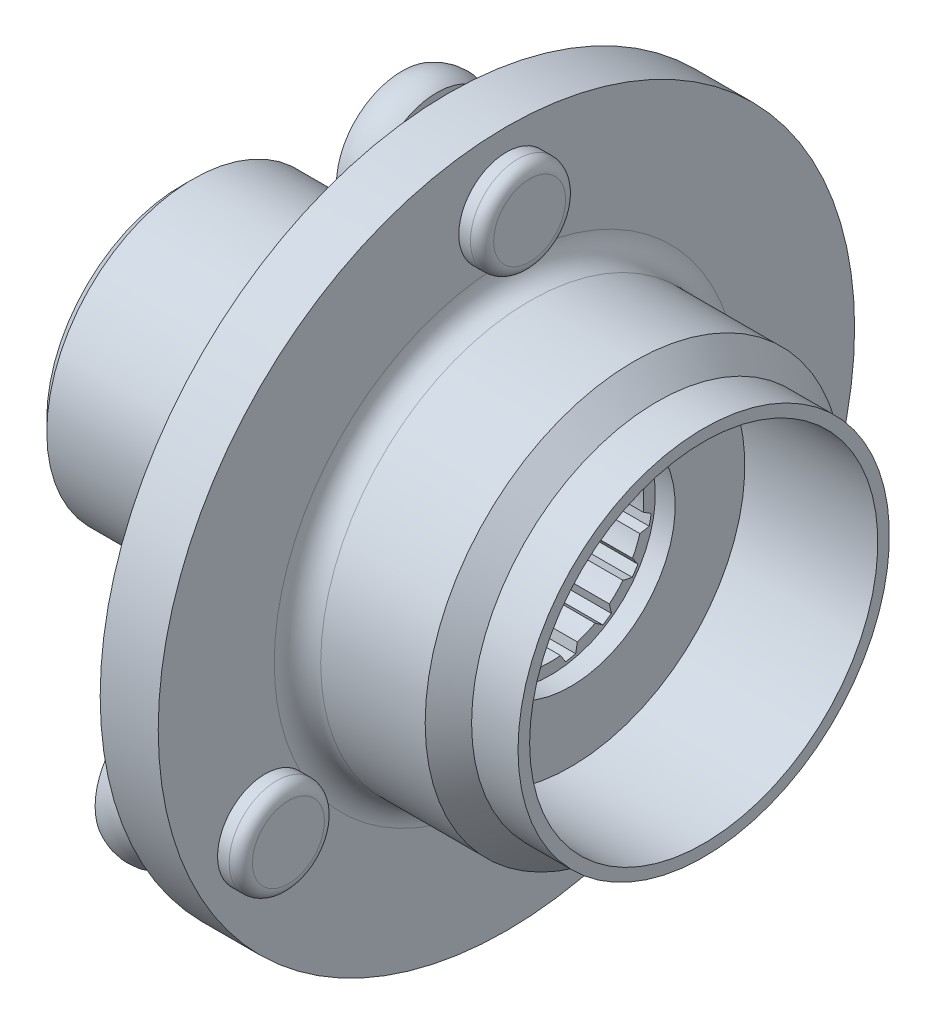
ISO-10303-21;
HEADER;
FILE_DESCRIPTION(('STEP AP214'),'2;1');
FILE_NAME('part.step','',(''),(''),'','','');
FILE_SCHEMA(('AUTOMOTIVE_DESIGN { 1 0 10303 214 1 1 1 1 }'));
ENDSEC;
DATA;
#1=APPLICATION_CONTEXT('core data for automotive mechanical design processes');
#2=APPLICATION_PROTOCOL_DEFINITION('international standard','automotive_design',2000,#1);
#3=PRODUCT_CONTEXT('',#1,'mechanical');
#4=PRODUCT('Part','Part','',(#3));
#5=PRODUCT_RELATED_PRODUCT_CATEGORY('part','',(#4));
#6=PRODUCT_DEFINITION_FORMATION('','',#4);
#7=PRODUCT_DEFINITION_CONTEXT('part definition',#1,'design');
#8=PRODUCT_DEFINITION('design','',#6,#7);
#9=PRODUCT_DEFINITION_SHAPE('','',#8);
#10=(LENGTH_UNIT() NAMED_UNIT(*) SI_UNIT(.MILLI.,.METRE.));
#11=(NAMED_UNIT(*) PLANE_ANGLE_UNIT() SI_UNIT($,.RADIAN.));
#12=(NAMED_UNIT(*) SI_UNIT($,.STERADIAN.) SOLID_ANGLE_UNIT());
#13=UNCERTAINTY_MEASURE_WITH_UNIT(LENGTH_MEASURE(1.E-05),#10,'distance_accuracy_value','');
#14=(GEOMETRIC_REPRESENTATION_CONTEXT(3) GLOBAL_UNCERTAINTY_ASSIGNED_CONTEXT((#13)) GLOBAL_UNIT_ASSIGNED_CONTEXT((#10,
#11,#12)) REPRESENTATION_CONTEXT('',''));
#15=CARTESIAN_POINT('',(0.,0.,0.));
#16=DIRECTION('',(0.,0.,1.));
#17=DIRECTION('',(1.,0.,0.));
#18=AXIS2_PLACEMENT_3D('',#15,#16,#17);
#19=CARTESIAN_POINT('',(-7.04852806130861,4.,0.));
#20=DIRECTION('',(-1.,0.,0.));
#21=DIRECTION('',(0.,0.,1.));
#22=AXIS2_PLACEMENT_3D('',#19,#20,#21);
#23=PLANE('',#22);
#24=CARTESIAN_POINT('',(-7.04852806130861,0.,0.));
#25=DIRECTION('',(-1.,0.,0.));
#26=DIRECTION('',(0.,0.,1.));
#27=AXIS2_PLACEMENT_3D('',#24,#25,#26);
#28=CIRCLE('',#27,4.5);
#29=CARTESIAN_POINT('',(-7.04852806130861,0.,4.5));
#30=VERTEX_POINT('',#29);
#31=EDGE_CURVE('E828',#30,#30,#28,.T.);
#32=ORIENTED_EDGE('',*,*,#31,.T.);
#33=EDGE_LOOP('',(#32));
#34=FACE_BOUND('',#33,.T.);
#35=CARTESIAN_POINT('',(-7.04852806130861,0.,0.));
#36=DIRECTION('',(-1.,0.,0.));
#37=DIRECTION('',(0.,0.,1.));
#38=AXIS2_PLACEMENT_3D('',#35,#36,#37);
#39=CIRCLE('',#38,4.);
#40=CARTESIAN_POINT('',(-7.04852806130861,3.10634163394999,-2.52004794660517));
#41=VERTEX_POINT('',#40);
#42=CARTESIAN_POINT('',(-7.04852806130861,2.52004794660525,-3.10634163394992));
#43=VERTEX_POINT('',#42);
#44=EDGE_CURVE('E829',#41,#43,#39,.T.);
#45=ORIENTED_EDGE('',*,*,#44,.F.);
#46=DIRECTION('',(0.,0.9760996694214,-0.217323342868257));
#47=VECTOR('',#46,1.);
#48=CARTESIAN_POINT('',(-7.04852806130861,2.87281618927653,-2.46805476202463));
#49=LINE('',#48,#47);
#50=CARTESIAN_POINT('',(-7.04852806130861,3.50693317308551,-2.60923749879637));
#51=VERTEX_POINT('',#50);
#52=EDGE_CURVE('E462',#41,#51,#49,.T.);
#53=ORIENTED_EDGE('',*,*,#52,.T.);
#54=DIRECTION('',(0.,0.555570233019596,0.83146961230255));
#55=VECTOR('',#54,1.);
#56=CARTESIAN_POINT('',(-7.04852806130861,3.50693317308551,-2.60923749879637));
#57=LINE('',#56,#55);
#58=CARTESIAN_POINT('',(-7.04852806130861,3.75266634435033,-2.24147181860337));
#59=VERTEX_POINT('',#58);
#60=EDGE_CURVE('E459',#51,#59,#57,.T.);
#61=ORIENTED_EDGE('',*,*,#60,.T.);
#62=DIRECTION('',(0.,0.574317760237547,-0.81863246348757));
#63=VECTOR('',#62,1.);
#64=CARTESIAN_POINT('',(-7.04852806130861,3.37956443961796,-1.70965241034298));
#65=LINE('',#64,#63);
#66=CARTESIAN_POINT('',(-7.04852806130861,3.51696619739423,-1.9055048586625));
#67=VERTEX_POINT('',#66);
#68=EDGE_CURVE('E465',#67,#59,#65,.T.);
#69=ORIENTED_EDGE('',*,*,#68,.F.);
#70=CARTESIAN_POINT('',(-7.04852806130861,3.83426605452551,-1.1394752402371));
#71=VERTEX_POINT('',#70);
#72=EDGE_CURVE('E826',#71,#67,#39,.T.);
#73=ORIENTED_EDGE('',*,*,#72,.F.);
#74=DIRECTION('',(0.,0.984964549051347,0.172756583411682));
#75=VECTOR('',#74,1.);
#76=CARTESIAN_POINT('',(-7.04852806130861,3.59861974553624,-1.18080611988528));
#77=LINE('',#76,#75);
#78=CARTESIAN_POINT('',(-7.04852806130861,4.23849574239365,-1.06857589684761));
#79=VERTEX_POINT('',#78);
#80=EDGE_CURVE('E750',#71,#79,#77,.T.);
#81=ORIENTED_EDGE('',*,*,#80,.T.);
#82=DIRECTION('',(0.,0.195090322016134,0.980785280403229));
#83=VECTOR('',#82,1.);
#84=CARTESIAN_POINT('',(-7.04852806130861,4.23849574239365,-1.06857589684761));
#85=LINE('',#84,#83);
#86=CARTESIAN_POINT('',(-7.04852806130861,4.32478575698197,-0.634766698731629));
#87=VERTEX_POINT('',#86);
#88=EDGE_CURVE('E747',#79,#87,#85,.T.);
#89=ORIENTED_EDGE('',*,*,#88,.T.);
#90=DIRECTION('',(0.,0.843877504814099,-0.536535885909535));
#91=VECTOR('',#90,1.);
#92=CARTESIAN_POINT('',(-7.04852806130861,3.77656606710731,-0.286209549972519));
#93=LINE('',#92,#91);
#94=CARTESIAN_POINT('',(-7.04852806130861,3.97845822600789,-0.414572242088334));
#95=VERTEX_POINT('',#94);
#96=EDGE_CURVE('E745',#95,#87,#93,.T.);
#97=ORIENTED_EDGE('',*,*,#96,.F.);
#98=CARTESIAN_POINT('',(-7.04852806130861,3.97845822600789,0.414572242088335));
#99=VERTEX_POINT('',#98);
#100=EDGE_CURVE('E825',#99,#95,#39,.T.);
#101=ORIENTED_EDGE('',*,*,#100,.F.);
#102=DIRECTION('',(0.,0.843877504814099,0.536535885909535));
#103=VECTOR('',#102,1.);
#104=CARTESIAN_POINT('',(-7.04852806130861,3.7765660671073,0.286209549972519));
#105=LINE('',#104,#103);
#106=CARTESIAN_POINT('',(-7.04852806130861,4.32478575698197,0.634766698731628));
#107=VERTEX_POINT('',#106);
#108=EDGE_CURVE('E731',#99,#107,#105,.T.);
#109=ORIENTED_EDGE('',*,*,#108,.T.);
#110=DIRECTION('',(0.,-0.195090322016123,0.980785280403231));
#111=VECTOR('',#110,1.);
#112=CARTESIAN_POINT('',(-7.04852806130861,4.32478575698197,0.634766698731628));
#113=LINE('',#112,#111);
#114=CARTESIAN_POINT('',(-7.04852806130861,4.23849574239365,1.06857589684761));
#115=VERTEX_POINT('',#114);
#116=EDGE_CURVE('E728',#107,#115,#113,.T.);
#117=ORIENTED_EDGE('',*,*,#116,.T.);
#118=DIRECTION('',(0.,0.984964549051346,-0.172756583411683));
#119=VECTOR('',#118,1.);
#120=CARTESIAN_POINT('',(-7.04852806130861,3.59861974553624,1.18080611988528));
#121=LINE('',#120,#119);
#122=CARTESIAN_POINT('',(-7.04852806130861,3.83426605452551,1.1394752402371));
#123=VERTEX_POINT('',#122);
#124=EDGE_CURVE('E726',#123,#115,#121,.T.);
#125=ORIENTED_EDGE('',*,*,#124,.F.);
#126=CARTESIAN_POINT('',(-7.04852806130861,3.5169661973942,1.90550485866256));
#127=VERTEX_POINT('',#126);
#128=EDGE_CURVE('E1103',#127,#123,#39,.T.);
#129=ORIENTED_EDGE('',*,*,#128,.F.);
#130=DIRECTION('',(0.,0.574317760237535,0.818632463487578));
#131=VECTOR('',#130,1.);
#132=CARTESIAN_POINT('',(-7.04852806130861,3.37956443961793,1.70965241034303));
#133=LINE('',#132,#131);
#134=CARTESIAN_POINT('',(-7.04852806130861,3.7526663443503,2.24147181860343));
#135=VERTEX_POINT('',#134);
#136=EDGE_CURVE('E713',#127,#135,#133,.T.);
#137=ORIENTED_EDGE('',*,*,#136,.T.);
#138=DIRECTION('',(0.,-0.555570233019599,0.831469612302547));
#139=VECTOR('',#138,1.);
#140=CARTESIAN_POINT('',(-7.04852806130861,3.7526663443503,2.24147181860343));
#141=LINE('',#140,#139);
#142=CARTESIAN_POINT('',(-7.04852806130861,3.50693317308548,2.60923749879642));
#143=VERTEX_POINT('',#142);
#144=EDGE_CURVE('E710',#135,#143,#141,.T.);
#145=ORIENTED_EDGE('',*,*,#144,.T.);
#146=DIRECTION('',(0.,0.976099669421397,0.21732334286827));
#147=VECTOR('',#146,1.);
#148=CARTESIAN_POINT('',(-7.04852806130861,2.8728161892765,2.46805476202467));
#149=LINE('',#148,#147);
#150=CARTESIAN_POINT('',(-7.04852806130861,3.10634163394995,2.52004794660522));
#151=VERTEX_POINT('',#150);
#152=EDGE_CURVE('E707',#151,#143,#149,.T.);
#153=ORIENTED_EDGE('',*,*,#152,.F.);
#154=CARTESIAN_POINT('',(-7.04852806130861,2.5200479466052,3.10634163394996));
#155=VERTEX_POINT('',#154);
#156=EDGE_CURVE('E1099',#155,#151,#39,.T.);
#157=ORIENTED_EDGE('',*,*,#156,.F.);
#158=DIRECTION('',(0.,0.217323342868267,0.976099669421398));
#159=VECTOR('',#158,1.);
#160=CARTESIAN_POINT('',(-7.04852806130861,2.46805476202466,2.87281618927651));
#161=LINE('',#160,#159);
#162=CARTESIAN_POINT('',(-7.04852806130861,2.60923749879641,3.50693317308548));
#163=VERTEX_POINT('',#162);
#164=EDGE_CURVE('E694',#155,#163,#161,.T.);
#165=ORIENTED_EDGE('',*,*,#164,.T.);
#166=DIRECTION('',(0.,-0.831469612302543,0.555570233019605));
#167=VECTOR('',#166,1.);
#168=CARTESIAN_POINT('',(-7.04852806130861,2.60923749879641,3.50693317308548));
#169=LINE('',#168,#167);
#170=CARTESIAN_POINT('',(-7.04852806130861,2.24147181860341,3.75266634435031));
#171=VERTEX_POINT('',#170);
#172=EDGE_CURVE('E691',#163,#171,#169,.T.);
#173=ORIENTED_EDGE('',*,*,#172,.T.);
#174=DIRECTION('',(0.,0.818632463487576,0.574317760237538));
#175=VECTOR('',#174,1.);
#176=CARTESIAN_POINT('',(-7.04852806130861,1.70965241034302,3.37956443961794));
#177=LINE('',#176,#175);
#178=CARTESIAN_POINT('',(-7.04852806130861,1.90550485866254,3.5169661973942));
#179=VERTEX_POINT('',#178);
#180=EDGE_CURVE('E688',#179,#171,#177,.T.);
#181=ORIENTED_EDGE('',*,*,#180,.F.);
#182=CARTESIAN_POINT('',(-7.04852806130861,1.13947524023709,3.83426605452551));
#183=VERTEX_POINT('',#182);
#184=EDGE_CURVE('E1095',#183,#179,#39,.T.);
#185=ORIENTED_EDGE('',*,*,#184,.F.);
#186=DIRECTION('',(0.,-0.172756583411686,0.984964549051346));
#187=VECTOR('',#186,1.);
#188=CARTESIAN_POINT('',(-7.04852806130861,1.18080611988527,3.59861974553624));
#189=LINE('',#188,#187);
#190=CARTESIAN_POINT('',(-7.04852806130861,1.06857589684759,4.23849574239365));
#191=VERTEX_POINT('',#190);
#192=EDGE_CURVE('E675',#183,#191,#189,.T.);
#193=ORIENTED_EDGE('',*,*,#192,.T.);
#194=DIRECTION('',(0.,-0.98078528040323,0.195090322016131));
#195=VECTOR('',#194,1.);
#196=CARTESIAN_POINT('',(-7.04852806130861,1.06857589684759,4.23849574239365));
#197=LINE('',#196,#195);
#198=CARTESIAN_POINT('',(-7.04852806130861,0.634766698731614,4.32478575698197));
#199=VERTEX_POINT('',#198);
#200=EDGE_CURVE('E672',#191,#199,#197,.T.);
#201=ORIENTED_EDGE('',*,*,#200,.T.);
#202=DIRECTION('',(0.,0.536535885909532,0.843877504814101));
#203=VECTOR('',#202,1.);
#204=CARTESIAN_POINT('',(-7.04852806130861,0.286209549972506,3.77656606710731));
#205=LINE('',#204,#203);
#206=CARTESIAN_POINT('',(-7.04852806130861,0.41457224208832,3.97845822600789));
#207=VERTEX_POINT('',#206);
#208=EDGE_CURVE('E669',#207,#199,#205,.T.);
#209=ORIENTED_EDGE('',*,*,#208,.F.);
#210=CARTESIAN_POINT('',(-7.04852806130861,-0.414572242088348,3.97845822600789));
#211=VERTEX_POINT('',#210);
#212=EDGE_CURVE('E1091',#211,#207,#39,.T.);
#213=ORIENTED_EDGE('',*,*,#212,.F.);
#214=DIRECTION('',(0.,-0.536535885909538,0.843877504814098));
#215=VECTOR('',#214,1.);
#216=CARTESIAN_POINT('',(-7.04852806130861,-0.286209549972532,3.7765660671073));
#217=LINE('',#216,#215);
#218=CARTESIAN_POINT('',(-7.04852806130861,-0.634766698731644,4.32478575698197));
#219=VERTEX_POINT('',#218);
#220=EDGE_CURVE('E656',#211,#219,#217,.T.);
#221=ORIENTED_EDGE('',*,*,#220,.T.);
#222=DIRECTION('',(0.,-0.980785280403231,-0.195090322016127));
#223=VECTOR('',#222,1.);
#224=CARTESIAN_POINT('',(-7.04852806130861,-0.634766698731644,4.32478575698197));
#225=LINE('',#224,#223);
#226=CARTESIAN_POINT('',(-7.04852806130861,-1.06857589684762,4.23849574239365));
#227=VERTEX_POINT('',#226);
#228=EDGE_CURVE('E653',#219,#227,#225,.T.);
#229=ORIENTED_EDGE('',*,*,#228,.T.);
#230=DIRECTION('',(0.,0.172756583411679,0.984964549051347));
#231=VECTOR('',#230,1.);
#232=CARTESIAN_POINT('',(-7.04852806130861,-1.18080611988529,3.59861974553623));
#233=LINE('',#232,#231);
#234=CARTESIAN_POINT('',(-7.04852806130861,-1.13947524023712,3.8342660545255));
#235=VERTEX_POINT('',#234);
#236=EDGE_CURVE('E650',#235,#227,#233,.T.);
#237=ORIENTED_EDGE('',*,*,#236,.F.);
#238=CARTESIAN_POINT('',(-7.04852806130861,-1.90550485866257,3.51696619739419));
#239=VERTEX_POINT('',#238);
#240=EDGE_CURVE('E1087',#239,#235,#39,.T.);
#241=ORIENTED_EDGE('',*,*,#240,.F.);
#242=DIRECTION('',(0.,-0.81863246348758,0.574317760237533));
#243=VECTOR('',#242,1.);
#244=CARTESIAN_POINT('',(-7.04852806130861,-1.70965241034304,3.37956443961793));
#245=LINE('',#244,#243);
#246=CARTESIAN_POINT('',(-7.04852806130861,-2.24147181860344,3.75266634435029));
#247=VERTEX_POINT('',#246);
#248=EDGE_CURVE('E637',#239,#247,#245,.T.);
#249=ORIENTED_EDGE('',*,*,#248,.T.);
#250=DIRECTION('',(0.,-0.831469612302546,-0.555570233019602));
#251=VECTOR('',#250,1.);
#252=CARTESIAN_POINT('',(-7.04852806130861,-2.24147181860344,3.75266634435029));
#253=LINE('',#252,#251);
#254=CARTESIAN_POINT('',(-7.04852806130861,-2.60923749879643,3.50693317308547));
#255=VERTEX_POINT('',#254);
#256=EDGE_CURVE('E634',#247,#255,#253,.T.);
#257=ORIENTED_EDGE('',*,*,#256,.T.);
#258=DIRECTION('',(0.,-0.217323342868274,0.976099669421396));
#259=VECTOR('',#258,1.);
#260=CARTESIAN_POINT('',(-7.04852806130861,-2.46805476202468,2.87281618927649));
#261=LINE('',#260,#259);
#262=CARTESIAN_POINT('',(-7.04852806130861,-2.52004794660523,3.10634163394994));
#263=VERTEX_POINT('',#262);
#264=EDGE_CURVE('E631',#263,#255,#261,.T.);
#265=ORIENTED_EDGE('',*,*,#264,.F.);
#266=CARTESIAN_POINT('',(-7.04852806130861,-3.10634163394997,2.52004794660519));
#267=VERTEX_POINT('',#266);
#268=EDGE_CURVE('E1083',#267,#263,#39,.T.);
#269=ORIENTED_EDGE('',*,*,#268,.F.);
#270=DIRECTION('',(0.,-0.976099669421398,0.217323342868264));
#271=VECTOR('',#270,1.);
#272=CARTESIAN_POINT('',(-7.04852806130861,-2.87281618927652,2.46805476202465));
#273=LINE('',#272,#271);
#274=CARTESIAN_POINT('',(-7.04852806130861,-3.50693317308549,2.6092374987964));
#275=VERTEX_POINT('',#274);
#276=EDGE_CURVE('E618',#267,#275,#273,.T.);
#277=ORIENTED_EDGE('',*,*,#276,.T.);
#278=DIRECTION('',(0.,-0.555570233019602,-0.831469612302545));
#279=VECTOR('',#278,1.);
#280=CARTESIAN_POINT('',(-7.04852806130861,-3.50693317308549,2.6092374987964));
#281=LINE('',#280,#279);
#282=CARTESIAN_POINT('',(-7.04852806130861,-3.75266634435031,2.2414718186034));
#283=VERTEX_POINT('',#282);
#284=EDGE_CURVE('E615',#275,#283,#281,.T.);
#285=ORIENTED_EDGE('',*,*,#284,.T.);
#286=DIRECTION('',(0.,-0.574317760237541,0.818632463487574));
#287=VECTOR('',#286,1.);
#288=CARTESIAN_POINT('',(-7.04852806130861,-3.37956443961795,1.70965241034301));
#289=LINE('',#288,#287);
#290=CARTESIAN_POINT('',(-7.04852806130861,-3.51696619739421,1.90550485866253));
#291=VERTEX_POINT('',#290);
#292=EDGE_CURVE('E612',#291,#283,#289,.T.);
#293=ORIENTED_EDGE('',*,*,#292,.F.);
#294=CARTESIAN_POINT('',(-7.04852806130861,-3.83426605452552,1.13947524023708));
#295=VERTEX_POINT('',#294);
#296=EDGE_CURVE('E1079',#295,#291,#39,.T.);
#297=ORIENTED_EDGE('',*,*,#296,.F.);
#298=DIRECTION('',(0.,-0.984964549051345,-0.172756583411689));
#299=VECTOR('',#298,1.);
#300=CARTESIAN_POINT('',(-7.04852806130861,-3.59861974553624,1.18080611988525));
#301=LINE('',#300,#299);
#302=CARTESIAN_POINT('',(-7.04852806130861,-4.23849574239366,1.06857589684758));
#303=VERTEX_POINT('',#302);
#304=EDGE_CURVE('E599',#295,#303,#301,.T.);
#305=ORIENTED_EDGE('',*,*,#304,.T.);
#306=DIRECTION('',(0.,-0.195090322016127,-0.980785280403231));
#307=VECTOR('',#306,1.);
#308=CARTESIAN_POINT('',(-7.04852806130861,-4.23849574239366,1.06857589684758));
#309=LINE('',#308,#307);
#310=CARTESIAN_POINT('',(-7.04852806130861,-4.32478575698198,0.634766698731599));
#311=VERTEX_POINT('',#310);
#312=EDGE_CURVE('E596',#303,#311,#309,.T.);
#313=ORIENTED_EDGE('',*,*,#312,.T.);
#314=DIRECTION('',(0.,-0.843877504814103,0.53653588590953));
#315=VECTOR('',#314,1.);
#316=CARTESIAN_POINT('',(-7.04852806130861,-3.77656606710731,0.286209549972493));
#317=LINE('',#316,#315);
#318=CARTESIAN_POINT('',(-7.04852806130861,-3.97845822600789,0.414572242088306));
#319=VERTEX_POINT('',#318);
#320=EDGE_CURVE('E593',#319,#311,#317,.T.);
#321=ORIENTED_EDGE('',*,*,#320,.F.);
#322=CARTESIAN_POINT('',(-7.04852806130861,-3.97845822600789,-0.414572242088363));
#323=VERTEX_POINT('',#322);
#324=EDGE_CURVE('E1075',#323,#319,#39,.T.);
#325=ORIENTED_EDGE('',*,*,#324,.F.);
#326=DIRECTION('',(0.,-0.843877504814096,-0.536535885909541));
#327=VECTOR('',#326,1.);
#328=CARTESIAN_POINT('',(-7.04852806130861,-3.7765660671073,-0.286209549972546));
#329=LINE('',#328,#327);
#330=CARTESIAN_POINT('',(-7.04852806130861,-4.32478575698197,-0.634766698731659));
#331=VERTEX_POINT('',#330);
#332=EDGE_CURVE('E580',#323,#331,#329,.T.);
#333=ORIENTED_EDGE('',*,*,#332,.T.);
#334=DIRECTION('',(0.,0.19509032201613,-0.98078528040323));
#335=VECTOR('',#334,1.);
#336=CARTESIAN_POINT('',(-7.04852806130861,-4.32478575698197,-0.634766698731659));
#337=LINE('',#336,#335);
#338=CARTESIAN_POINT('',(-7.04852806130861,-4.23849574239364,-1.06857589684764));
#339=VERTEX_POINT('',#338);
#340=EDGE_CURVE('E577',#331,#339,#337,.T.);
#341=ORIENTED_EDGE('',*,*,#340,.T.);
#342=DIRECTION('',(0.,-0.984964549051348,0.172756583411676));
#343=VECTOR('',#342,1.);
#344=CARTESIAN_POINT('',(-7.04852806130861,-3.59861974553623,-1.1808061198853));
#345=LINE('',#344,#343);
#346=CARTESIAN_POINT('',(-7.04852806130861,-3.8342660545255,-1.13947524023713));
#347=VERTEX_POINT('',#346);
#348=EDGE_CURVE('E574',#347,#339,#345,.T.);
#349=ORIENTED_EDGE('',*,*,#348,.F.);
#350=CARTESIAN_POINT('',(-7.04852806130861,-3.51696619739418,-1.90550485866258));
#351=VERTEX_POINT('',#350);
#352=EDGE_CURVE('E1071',#351,#347,#39,.T.);
#353=ORIENTED_EDGE('',*,*,#352,.F.);
#354=DIRECTION('',(0.,-0.57431776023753,-0.818632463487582));
#355=VECTOR('',#354,1.);
#356=CARTESIAN_POINT('',(-7.04852806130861,-3.37956443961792,-1.70965241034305));
#357=LINE('',#356,#355);
#358=CARTESIAN_POINT('',(-7.04852806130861,-3.75266634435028,-2.24147181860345));
#359=VERTEX_POINT('',#358);
#360=EDGE_CURVE('E561',#351,#359,#357,.T.);
#361=ORIENTED_EDGE('',*,*,#360,.T.);
#362=DIRECTION('',(0.,0.555570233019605,-0.831469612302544));
#363=VECTOR('',#362,1.);
#364=CARTESIAN_POINT('',(-7.04852806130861,-3.75266634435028,-2.24147181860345));
#365=LINE('',#364,#363);
#366=CARTESIAN_POINT('',(-7.04852806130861,-3.50693317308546,-2.60923749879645));
#367=VERTEX_POINT('',#366);
#368=EDGE_CURVE('E558',#359,#367,#365,.T.);
#369=ORIENTED_EDGE('',*,*,#368,.T.);
#370=DIRECTION('',(0.,-0.976099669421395,-0.217323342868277));
#371=VECTOR('',#370,1.);
#372=CARTESIAN_POINT('',(-7.04852806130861,-2.87281618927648,-2.46805476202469));
#373=LINE('',#372,#371);
#374=CARTESIAN_POINT('',(-7.04852806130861,-3.10634163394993,-2.52004794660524));
#375=VERTEX_POINT('',#374);
#376=EDGE_CURVE('E555',#375,#367,#373,.T.);
#377=ORIENTED_EDGE('',*,*,#376,.F.);
#378=CARTESIAN_POINT('',(-7.04852806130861,-2.52004794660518,-3.10634163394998));
#379=VERTEX_POINT('',#378);
#380=EDGE_CURVE('E1067',#379,#375,#39,.T.);
#381=ORIENTED_EDGE('',*,*,#380,.F.);
#382=DIRECTION('',(0.,-0.21732334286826,-0.976099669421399));
#383=VECTOR('',#382,1.);
#384=CARTESIAN_POINT('',(-7.04852806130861,-2.46805476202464,-2.87281618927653));
#385=LINE('',#384,#383);
#386=CARTESIAN_POINT('',(-7.04852806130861,-2.60923749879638,-3.5069331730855));
#387=VERTEX_POINT('',#386);
#388=EDGE_CURVE('E542',#379,#387,#385,.T.);
#389=ORIENTED_EDGE('',*,*,#388,.T.);
#390=DIRECTION('',(0.,0.831469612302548,-0.555570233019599));
#391=VECTOR('',#390,1.);
#392=CARTESIAN_POINT('',(-7.04852806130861,-2.60923749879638,-3.5069331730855));
#393=LINE('',#392,#391);
#394=CARTESIAN_POINT('',(-7.04852806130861,-2.24147181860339,-3.75266634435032));
#395=VERTEX_POINT('',#394);
#396=EDGE_CURVE('E539',#387,#395,#393,.T.);
#397=ORIENTED_EDGE('',*,*,#396,.T.);
#398=DIRECTION('',(0.,-0.818632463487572,-0.574317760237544));
#399=VECTOR('',#398,1.);
#400=CARTESIAN_POINT('',(-7.04852806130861,-1.709652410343,-3.37956443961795));
#401=LINE('',#400,#399);
#402=CARTESIAN_POINT('',(-7.04852806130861,-1.90550485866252,-3.51696619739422));
#403=VERTEX_POINT('',#402);
#404=EDGE_CURVE('E536',#403,#395,#401,.T.);
#405=ORIENTED_EDGE('',*,*,#404,.F.);
#406=CARTESIAN_POINT('',(-7.04852806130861,-1.13947524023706,-3.83426605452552));
#407=VERTEX_POINT('',#406);
#408=EDGE_CURVE('E1063',#407,#403,#39,.T.);
#409=ORIENTED_EDGE('',*,*,#408,.F.);
#410=DIRECTION('',(0.,0.172756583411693,-0.984964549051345));
#411=VECTOR('',#410,1.);
#412=CARTESIAN_POINT('',(-7.04852806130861,-1.18080611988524,-3.59861974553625));
#413=LINE('',#412,#411);
#414=CARTESIAN_POINT('',(-7.04852806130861,-1.06857589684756,-4.23849574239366));
#415=VERTEX_POINT('',#414);
#416=EDGE_CURVE('E523',#407,#415,#413,.T.);
#417=ORIENTED_EDGE('',*,*,#416,.T.);
#418=DIRECTION('',(0.,0.980785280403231,-0.195090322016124));
#419=VECTOR('',#418,1.);
#420=CARTESIAN_POINT('',(-7.04852806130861,-1.06857589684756,-4.23849574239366));
#421=LINE('',#420,#419);
#422=CARTESIAN_POINT('',(-7.04852806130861,-0.634766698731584,-4.32478575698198));
#423=VERTEX_POINT('',#422);
#424=EDGE_CURVE('E520',#415,#423,#421,.T.);
#425=ORIENTED_EDGE('',*,*,#424,.T.);
#426=DIRECTION('',(0.,-0.536535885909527,-0.843877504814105));
#427=VECTOR('',#426,1.);
#428=CARTESIAN_POINT('',(-7.04852806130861,-0.28620954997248,-3.77656606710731));
#429=LINE('',#428,#427);
#430=CARTESIAN_POINT('',(-7.04852806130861,-0.414572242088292,-3.9784582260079));
#431=VERTEX_POINT('',#430);
#432=EDGE_CURVE('E517',#431,#423,#429,.T.);
#433=ORIENTED_EDGE('',*,*,#432,.F.);
#434=CARTESIAN_POINT('',(-7.04852806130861,0.414572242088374,-3.97845822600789));
#435=VERTEX_POINT('',#434);
#436=EDGE_CURVE('E1059',#435,#431,#39,.T.);
#437=ORIENTED_EDGE('',*,*,#436,.F.);
#438=DIRECTION('',(0.,0.536535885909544,-0.843877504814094));
#439=VECTOR('',#438,1.);
#440=CARTESIAN_POINT('',(-7.04852806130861,0.286209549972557,-3.7765660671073));
#441=LINE('',#440,#439);
#442=CARTESIAN_POINT('',(-7.04852806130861,0.634766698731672,-4.32478575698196));
#443=VERTEX_POINT('',#442);
#444=EDGE_CURVE('E504',#435,#443,#441,.T.);
#445=ORIENTED_EDGE('',*,*,#444,.T.);
#446=DIRECTION('',(0.,0.98078528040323,0.195090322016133));
#447=VECTOR('',#446,1.);
#448=CARTESIAN_POINT('',(-7.04852806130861,0.634766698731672,-4.32478575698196));
#449=LINE('',#448,#447);
#450=CARTESIAN_POINT('',(-7.04852806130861,1.06857589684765,-4.23849574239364));
#451=VERTEX_POINT('',#450);
#452=EDGE_CURVE('E501',#443,#451,#449,.T.);
#453=ORIENTED_EDGE('',*,*,#452,.T.);
#454=DIRECTION('',(0.,-0.172756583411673,-0.984964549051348));
#455=VECTOR('',#454,1.);
#456=CARTESIAN_POINT('',(-7.04852806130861,1.18080611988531,-3.59861974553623));
#457=LINE('',#456,#455);
#458=CARTESIAN_POINT('',(-7.04852806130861,1.13947524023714,-3.8342660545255));
#459=VERTEX_POINT('',#458);
#460=EDGE_CURVE('E498',#459,#451,#457,.T.);
#461=ORIENTED_EDGE('',*,*,#460,.F.);
#462=CARTESIAN_POINT('',(-7.04852806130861,1.90550485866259,-3.51696619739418));
#463=VERTEX_POINT('',#462);
#464=EDGE_CURVE('E1058',#463,#459,#39,.T.);
#465=ORIENTED_EDGE('',*,*,#464,.F.);
#466=DIRECTION('',(0.,0.818632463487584,-0.574317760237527));
#467=VECTOR('',#466,1.);
#468=CARTESIAN_POINT('',(-7.04852806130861,1.70965241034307,-3.37956443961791));
#469=LINE('',#468,#467);
#470=CARTESIAN_POINT('',(-7.04852806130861,2.24147181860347,-3.75266634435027));
#471=VERTEX_POINT('',#470);
#472=EDGE_CURVE('E486',#463,#471,#469,.T.);
#473=ORIENTED_EDGE('',*,*,#472,.T.);
#474=DIRECTION('',(0.,0.831469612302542,0.555570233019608));
#475=VECTOR('',#474,1.);
#476=CARTESIAN_POINT('',(-7.04852806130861,2.24147181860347,-3.75266634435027));
#477=LINE('',#476,#475);
#478=CARTESIAN_POINT('',(-7.04852806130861,2.60923749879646,-3.50693317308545));
#479=VERTEX_POINT('',#478);
#480=EDGE_CURVE('E483',#471,#479,#477,.T.);
#481=ORIENTED_EDGE('',*,*,#480,.T.);
#482=DIRECTION('',(0.,0.21732334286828,-0.976099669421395));
#483=VECTOR('',#482,1.);
#484=CARTESIAN_POINT('',(-7.04852806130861,2.4680547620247,-2.87281618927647));
#485=LINE('',#484,#483);
#486=EDGE_CURVE('E480',#43,#479,#485,.T.);
#487=ORIENTED_EDGE('',*,*,#486,.F.);
#488=EDGE_LOOP('',(#45,#53,#61,#69,#73,#81,#89,#97,#101,#109,#117,#125,#129,#137,#145,#153,#157,
#165,#173,#181,#185,#193,#201,#209,#213,#221,#229,#237,#241,#249,#257,#265,#269,#277,#285,#293,
#297,#305,#313,#321,#325,#333,#341,#349,#353,#361,#369,#377,#381,#389,#397,#405,#409,#417,#425,
#433,#437,#445,#453,#461,#465,#473,#481,#487));
#489=FACE_BOUND('',#488,.T.);
#490=ADVANCED_FACE('F33',(#34,#489),#23,.T.);
#491=CARTESIAN_POINT('',(4.41468380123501,4.5,0.));
#492=DIRECTION('',(1.,0.,0.));
#493=DIRECTION('',(0.,0.,-1.));
#494=AXIS2_PLACEMENT_3D('',#491,#492,#493);
#495=PLANE('',#494);
#496=CARTESIAN_POINT('',(4.41468380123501,0.,0.));
#497=DIRECTION('',(-1.,0.,0.));
#498=DIRECTION('',(0.,0.,1.));
#499=AXIS2_PLACEMENT_3D('',#496,#497,#498);
#500=CIRCLE('',#499,4.5);
#501=CARTESIAN_POINT('',(4.41468380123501,0.,4.5));
#502=VERTEX_POINT('',#501);
#503=EDGE_CURVE('E818',#502,#502,#500,.T.);
#504=ORIENTED_EDGE('',*,*,#503,.F.);
#505=EDGE_LOOP('',(#504));
#506=FACE_BOUND('',#505,.T.);
#507=DIRECTION('',(0.,-0.555570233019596,-0.83146961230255));
#508=VECTOR('',#507,1.);
#509=CARTESIAN_POINT('',(4.41468380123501,5.01876203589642,-0.34662571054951));
#510=LINE('',#509,#508);
#511=CARTESIAN_POINT('',(4.41468380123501,3.75266634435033,-2.24147181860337));
#512=VERTEX_POINT('',#511);
#513=CARTESIAN_POINT('',(4.41468380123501,3.50693317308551,-2.60923749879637));
#514=VERTEX_POINT('',#513);
#515=EDGE_CURVE('E11',#512,#514,#510,.T.);
#516=ORIENTED_EDGE('',*,*,#515,.T.);
#517=DIRECTION('',(0.,-0.9760996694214,0.217323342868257));
#518=VECTOR('',#517,1.);
#519=CARTESIAN_POINT('',(4.41468380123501,3.89960243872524,-2.69666319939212));
#520=LINE('',#519,#518);
#521=CARTESIAN_POINT('',(4.41468380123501,3.10634163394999,-2.52004794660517));
#522=VERTEX_POINT('',#521);
#523=EDGE_CURVE('E478',#514,#522,#520,.T.);
#524=ORIENTED_EDGE('',*,*,#523,.T.);
#525=CARTESIAN_POINT('',(4.41468380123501,0.,0.));
#526=DIRECTION('',(-1.,0.,0.));
#527=DIRECTION('',(0.,0.,1.));
#528=AXIS2_PLACEMENT_3D('',#525,#526,#527);
#529=CIRCLE('',#528,4.);
#530=CARTESIAN_POINT('',(4.41468380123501,2.52004794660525,-3.10634163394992));
#531=VERTEX_POINT('',#530);
#532=EDGE_CURVE('E56',#522,#531,#529,.T.);
#533=ORIENTED_EDGE('',*,*,#532,.T.);
#534=DIRECTION('',(0.,-0.21732334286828,0.976099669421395));
#535=VECTOR('',#534,1.);
#536=CARTESIAN_POINT('',(4.41468380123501,1.95461406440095,-0.566716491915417));
#537=LINE('',#536,#535);
#538=CARTESIAN_POINT('',(4.41468380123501,2.60923749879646,-3.50693317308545));
#539=VERTEX_POINT('',#538);
#540=EDGE_CURVE('E493',#539,#531,#537,.T.);
#541=ORIENTED_EDGE('',*,*,#540,.F.);
#542=DIRECTION('',(0.,-0.831469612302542,-0.555570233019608));
#543=VECTOR('',#542,1.);
#544=CARTESIAN_POINT('',(4.41468380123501,5.53639238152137,-1.55107081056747));
#545=LINE('',#544,#543);
#546=CARTESIAN_POINT('',(4.41468380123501,2.24147181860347,-3.75266634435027));
#547=VERTEX_POINT('',#546);
#548=EDGE_CURVE('E1049',#539,#547,#545,.T.);
#549=ORIENTED_EDGE('',*,*,#548,.T.);
#550=DIRECTION('',(0.,-0.818632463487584,0.574317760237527));
#551=VECTOR('',#550,1.);
#552=CARTESIAN_POINT('',(4.41468380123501,1.99070959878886,-3.57674222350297));
#553=LINE('',#552,#551);
#554=CARTESIAN_POINT('',(4.41468380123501,1.90550485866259,-3.51696619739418));
#555=VERTEX_POINT('',#554);
#556=EDGE_CURVE('E495',#547,#555,#553,.T.);
#557=ORIENTED_EDGE('',*,*,#556,.T.);
#558=CARTESIAN_POINT('',(4.41468380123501,1.13947524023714,-3.8342660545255));
#559=VERTEX_POINT('',#558);
#560=EDGE_CURVE('E1159',#555,#559,#529,.T.);
#561=ORIENTED_EDGE('',*,*,#560,.T.);
#562=DIRECTION('',(0.,0.172756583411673,0.984964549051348));
#563=VECTOR('',#562,1.);
#564=CARTESIAN_POINT('',(4.41468380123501,1.89220485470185,0.45739085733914));
#565=LINE('',#564,#563);
#566=CARTESIAN_POINT('',(4.41468380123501,1.06857589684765,-4.23849574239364));
#567=VERTEX_POINT('',#566);
#568=EDGE_CURVE('E511',#567,#559,#565,.T.);
#569=ORIENTED_EDGE('',*,*,#568,.F.);
#570=DIRECTION('',(0.,-0.98078528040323,-0.195090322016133));
#571=VECTOR('',#570,1.);
#572=CARTESIAN_POINT('',(4.41468380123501,5.18040024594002,-3.42060302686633));
#573=LINE('',#572,#571);
#574=CARTESIAN_POINT('',(4.41468380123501,0.634766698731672,-4.32478575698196));
#575=VERTEX_POINT('',#574);
#576=EDGE_CURVE('E1040',#567,#575,#573,.T.);
#577=ORIENTED_EDGE('',*,*,#576,.T.);
#578=DIRECTION('',(0.,-0.536535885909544,0.843877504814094));
#579=VECTOR('',#578,1.);
#580=CARTESIAN_POINT('',(4.41468380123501,-0.210681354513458,-2.99504321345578));
#581=LINE('',#580,#579);
#582=CARTESIAN_POINT('',(4.41468380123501,0.414572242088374,-3.97845822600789));
#583=VERTEX_POINT('',#582);
#584=EDGE_CURVE('E514',#575,#583,#581,.T.);
#585=ORIENTED_EDGE('',*,*,#584,.T.);
#586=CARTESIAN_POINT('',(4.41468380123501,-0.414572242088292,-3.9784582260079));
#587=VERTEX_POINT('',#586);
#588=EDGE_CURVE('E1156',#583,#587,#529,.T.);
#589=ORIENTED_EDGE('',*,*,#588,.T.);
#590=DIRECTION('',(0.,0.536535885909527,0.843877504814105));
#591=VECTOR('',#590,1.);
#592=CARTESIAN_POINT('',(4.41468380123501,2.80151816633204,1.0798918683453));
#593=LINE('',#592,#591);
#594=CARTESIAN_POINT('',(4.41468380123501,-0.634766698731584,-4.32478575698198));
#595=VERTEX_POINT('',#594);
#596=EDGE_CURVE('E530',#595,#587,#593,.T.);
#597=ORIENTED_EDGE('',*,*,#596,.F.);
#598=DIRECTION('',(0.,-0.980785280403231,0.195090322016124));
#599=VECTOR('',#598,1.);
#600=CARTESIAN_POINT('',(4.41468380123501,3.47705765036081,-5.14267847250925));
#601=LINE('',#600,#599);
#602=CARTESIAN_POINT('',(4.41468380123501,-1.06857589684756,-4.23849574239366));
#603=VERTEX_POINT('',#602);
#604=EDGE_CURVE('E1031',#595,#603,#601,.T.);
#605=ORIENTED_EDGE('',*,*,#604,.T.);
#606=DIRECTION('',(0.,-0.172756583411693,0.984964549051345));
#607=VECTOR('',#606,1.);
#608=CARTESIAN_POINT('',(4.41468380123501,-1.62360132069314,-1.07404113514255));
#609=LINE('',#608,#607);
#610=CARTESIAN_POINT('',(4.41468380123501,-1.13947524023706,-3.83426605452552));
#611=VERTEX_POINT('',#610);
#612=EDGE_CURVE('E533',#603,#611,#609,.T.);
#613=ORIENTED_EDGE('',*,*,#612,.T.);
#614=CARTESIAN_POINT('',(4.41468380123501,-1.90550485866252,-3.51696619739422));
#615=VERTEX_POINT('',#614);
#616=EDGE_CURVE('E1153',#611,#615,#529,.T.);
#617=ORIENTED_EDGE('',*,*,#616,.T.);
#618=DIRECTION('',(0.,0.818632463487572,0.574317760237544));
#619=VECTOR('',#618,1.);
#620=CARTESIAN_POINT('',(4.41468380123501,4.04072239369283,0.654654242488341));
#621=LINE('',#620,#619);
#622=CARTESIAN_POINT('',(4.41468380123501,-2.24147181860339,-3.75266634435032));
#623=VERTEX_POINT('',#622);
#624=EDGE_CURVE('E549',#623,#615,#621,.T.);
#625=ORIENTED_EDGE('',*,*,#624,.F.);
#626=DIRECTION('',(0.,-0.831469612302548,0.555570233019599));
#627=VECTOR('',#626,1.);
#628=CARTESIAN_POINT('',(4.41468380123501,0.685683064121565,-5.70852870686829));
#629=LINE('',#628,#627);
#630=CARTESIAN_POINT('',(4.41468380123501,-2.60923749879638,-3.5069331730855));
#631=VERTEX_POINT('',#630);
#632=EDGE_CURVE('E1022',#623,#631,#629,.T.);
#633=ORIENTED_EDGE('',*,*,#632,.T.);
#634=DIRECTION('',(0.,0.21732334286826,0.976099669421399));
#635=VECTOR('',#634,1.);
#636=CARTESIAN_POINT('',(4.41468380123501,-1.529549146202,1.34244669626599));
#637=LINE('',#636,#635);
#638=CARTESIAN_POINT('',(4.41468380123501,-2.52004794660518,-3.10634163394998));
#639=VERTEX_POINT('',#638);
#640=EDGE_CURVE('E552',#631,#639,#637,.T.);
#641=ORIENTED_EDGE('',*,*,#640,.T.);
#642=CARTESIAN_POINT('',(4.41468380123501,-3.10634163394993,-2.52004794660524));
#643=VERTEX_POINT('',#642);
#644=EDGE_CURVE('E1150',#639,#643,#529,.T.);
#645=ORIENTED_EDGE('',*,*,#644,.T.);
#646=DIRECTION('',(0.,0.976099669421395,0.217323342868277));
#647=VECTOR('',#646,1.);
#648=CARTESIAN_POINT('',(4.41468380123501,4.67533264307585,-0.787500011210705));
#649=LINE('',#648,#647);
#650=CARTESIAN_POINT('',(4.41468380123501,-3.50693317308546,-2.60923749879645));
#651=VERTEX_POINT('',#650);
#652=EDGE_CURVE('E568',#651,#643,#649,.T.);
#653=ORIENTED_EDGE('',*,*,#652,.F.);
#654=DIRECTION('',(0.,-0.555570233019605,0.831469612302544));
#655=VECTOR('',#654,1.);
#656=CARTESIAN_POINT('',(4.41468380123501,-2.24083748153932,-4.50408360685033));
#657=LINE('',#656,#655);
#658=CARTESIAN_POINT('',(4.41468380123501,-3.75266634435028,-2.24147181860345));
#659=VERTEX_POINT('',#658);
#660=EDGE_CURVE('E1013',#651,#659,#657,.T.);
#661=ORIENTED_EDGE('',*,*,#660,.T.);
#662=DIRECTION('',(0.,0.57431776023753,0.818632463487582));
#663=VECTOR('',#662,1.);
#664=CARTESIAN_POINT('',(4.41468380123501,0.0232400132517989,3.14070463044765));
#665=LINE('',#664,#663);
#666=CARTESIAN_POINT('',(4.41468380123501,-3.51696619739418,-1.90550485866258));
#667=VERTEX_POINT('',#666);
#668=EDGE_CURVE('E571',#659,#667,#665,.T.);
#669=ORIENTED_EDGE('',*,*,#668,.T.);
#670=CARTESIAN_POINT('',(4.41468380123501,-3.8342660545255,-1.13947524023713));
#671=VERTEX_POINT('',#670);
#672=EDGE_CURVE('E1147',#667,#671,#529,.T.);
#673=ORIENTED_EDGE('',*,*,#672,.T.);
#674=DIRECTION('',(0.,0.984964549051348,-0.172756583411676));
#675=VECTOR('',#674,1.);
#676=CARTESIAN_POINT('',(4.41468380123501,4.05737309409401,-2.52361908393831));
#677=LINE('',#676,#675);
#678=CARTESIAN_POINT('',(4.41468380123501,-4.23849574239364,-1.06857589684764));
#679=VERTEX_POINT('',#678);
#680=EDGE_CURVE('E587',#679,#671,#677,.T.);
#681=ORIENTED_EDGE('',*,*,#680,.F.);
#682=DIRECTION('',(0.,-0.19509032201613,0.98078528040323));
#683=VECTOR('',#682,1.);
#684=CARTESIAN_POINT('',(4.41468380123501,-4.1103696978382,-1.71270902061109));
#685=LINE('',#684,#683);
#686=CARTESIAN_POINT('',(4.41468380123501,-4.32478575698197,-0.634766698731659));
#687=VERTEX_POINT('',#686);
#688=EDGE_CURVE('E1004',#679,#687,#685,.T.);
#689=ORIENTED_EDGE('',*,*,#688,.T.);
#690=DIRECTION('',(0.,0.843877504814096,0.536535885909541));
#691=VECTOR('',#690,1.);
#692=CARTESIAN_POINT('',(4.41468380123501,2.24700592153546,3.54356730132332));
#693=LINE('',#692,#691);
#694=CARTESIAN_POINT('',(4.41468380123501,-3.97845822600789,-0.414572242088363));
#695=VERTEX_POINT('',#694);
#696=EDGE_CURVE('E590',#687,#695,#693,.T.);
#697=ORIENTED_EDGE('',*,*,#696,.T.);
#698=CARTESIAN_POINT('',(4.41468380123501,-3.97845822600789,0.414572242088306));
#699=VERTEX_POINT('',#698);
#700=EDGE_CURVE('E1144',#695,#699,#529,.T.);
#701=ORIENTED_EDGE('',*,*,#700,.T.);
#702=DIRECTION('',(0.,0.843877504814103,-0.53653588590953));
#703=VECTOR('',#702,1.);
#704=CARTESIAN_POINT('',(4.41468380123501,2.24700592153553,-3.54356730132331));
#705=LINE('',#704,#703);
#706=CARTESIAN_POINT('',(4.41468380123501,-4.32478575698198,0.634766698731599));
#707=VERTEX_POINT('',#706);
#708=EDGE_CURVE('E606',#707,#699,#705,.T.);
#709=ORIENTED_EDGE('',*,*,#708,.F.);
#710=DIRECTION('',(0.,0.195090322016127,0.980785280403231));
#711=VECTOR('',#710,1.);
#712=CARTESIAN_POINT('',(4.41468380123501,-4.11036969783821,1.71270902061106));
#713=LINE('',#712,#711);
#714=CARTESIAN_POINT('',(4.41468380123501,-4.23849574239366,1.06857589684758));
#715=VERTEX_POINT('',#714);
#716=EDGE_CURVE('E995',#707,#715,#713,.T.);
#717=ORIENTED_EDGE('',*,*,#716,.T.);
#718=DIRECTION('',(0.,0.984964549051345,0.172756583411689));
#719=VECTOR('',#718,1.);
#720=CARTESIAN_POINT('',(4.41468380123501,4.05737309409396,2.52361908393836));
#721=LINE('',#720,#719);
#722=CARTESIAN_POINT('',(4.41468380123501,-3.83426605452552,1.13947524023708));
#723=VERTEX_POINT('',#722);
#724=EDGE_CURVE('E609',#715,#723,#721,.T.);
#725=ORIENTED_EDGE('',*,*,#724,.T.);
#726=CARTESIAN_POINT('',(4.41468380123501,-3.51696619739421,1.90550485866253));
#727=VERTEX_POINT('',#726);
#728=EDGE_CURVE('E1141',#723,#727,#529,.T.);
#729=ORIENTED_EDGE('',*,*,#728,.T.);
#730=DIRECTION('',(0.,0.574317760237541,-0.818632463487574));
#731=VECTOR('',#730,1.);
#732=CARTESIAN_POINT('',(4.41468380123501,0.0232400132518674,-3.1407046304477));
#733=LINE('',#732,#731);
#734=CARTESIAN_POINT('',(4.41468380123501,-3.75266634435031,2.2414718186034));
#735=VERTEX_POINT('',#734);
#736=EDGE_CURVE('E625',#735,#727,#733,.T.);
#737=ORIENTED_EDGE('',*,*,#736,.F.);
#738=DIRECTION('',(0.,0.555570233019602,0.831469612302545));
#739=VECTOR('',#738,1.);
#740=CARTESIAN_POINT('',(4.41468380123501,-2.24083748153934,4.50408360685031));
#741=LINE('',#740,#739);
#742=CARTESIAN_POINT('',(4.41468380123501,-3.50693317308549,2.6092374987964));
#743=VERTEX_POINT('',#742);
#744=EDGE_CURVE('E986',#735,#743,#741,.T.);
#745=ORIENTED_EDGE('',*,*,#744,.T.);
#746=DIRECTION('',(0.,0.976099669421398,-0.217323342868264));
#747=VECTOR('',#746,1.);
#748=CARTESIAN_POINT('',(4.41468380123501,4.67533264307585,0.787500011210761));
#749=LINE('',#748,#747);
#750=CARTESIAN_POINT('',(4.41468380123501,-3.10634163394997,2.52004794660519));
#751=VERTEX_POINT('',#750);
#752=EDGE_CURVE('E628',#743,#751,#749,.T.);
#753=ORIENTED_EDGE('',*,*,#752,.T.);
#754=CARTESIAN_POINT('',(4.41468380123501,-2.52004794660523,3.10634163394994));
#755=VERTEX_POINT('',#754);
#756=EDGE_CURVE('E1138',#751,#755,#529,.T.);
#757=ORIENTED_EDGE('',*,*,#756,.T.);
#758=DIRECTION('',(0.,0.217323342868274,-0.976099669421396));
#759=VECTOR('',#758,1.);
#760=CARTESIAN_POINT('',(4.41468380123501,-1.52954914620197,-1.34244669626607));
#761=LINE('',#760,#759);
#762=CARTESIAN_POINT('',(4.41468380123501,-2.60923749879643,3.50693317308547));
#763=VERTEX_POINT('',#762);
#764=EDGE_CURVE('E644',#763,#755,#761,.T.);
#765=ORIENTED_EDGE('',*,*,#764,.F.);
#766=DIRECTION('',(0.,0.831469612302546,0.555570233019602));
#767=VECTOR('',#766,1.);
#768=CARTESIAN_POINT('',(4.41468380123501,0.685683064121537,5.70852870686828));
#769=LINE('',#768,#767);
#770=CARTESIAN_POINT('',(4.41468380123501,-2.24147181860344,3.75266634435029));
#771=VERTEX_POINT('',#770);
#772=EDGE_CURVE('E977',#763,#771,#769,.T.);
#773=ORIENTED_EDGE('',*,*,#772,.T.);
#774=DIRECTION('',(0.,0.81863246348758,-0.574317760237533));
#775=VECTOR('',#774,1.);
#776=CARTESIAN_POINT('',(4.41468380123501,4.04072239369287,-0.654654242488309));
#777=LINE('',#776,#775);
#778=CARTESIAN_POINT('',(4.41468380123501,-1.90550485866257,3.51696619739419));
#779=VERTEX_POINT('',#778);
#780=EDGE_CURVE('E647',#771,#779,#777,.T.);
#781=ORIENTED_EDGE('',*,*,#780,.T.);
#782=CARTESIAN_POINT('',(4.41468380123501,-1.13947524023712,3.8342660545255));
#783=VERTEX_POINT('',#782);
#784=EDGE_CURVE('E1135',#779,#783,#529,.T.);
#785=ORIENTED_EDGE('',*,*,#784,.T.);
#786=DIRECTION('',(0.,-0.172756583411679,-0.984964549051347));
#787=VECTOR('',#786,1.);
#788=CARTESIAN_POINT('',(4.41468380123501,-1.62360132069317,1.07404113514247));
#789=LINE('',#788,#787);
#790=CARTESIAN_POINT('',(4.41468380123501,-1.06857589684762,4.23849574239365));
#791=VERTEX_POINT('',#790);
#792=EDGE_CURVE('E663',#791,#783,#789,.T.);
#793=ORIENTED_EDGE('',*,*,#792,.F.);
#794=DIRECTION('',(0.,0.980785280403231,0.195090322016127));
#795=VECTOR('',#794,1.);
#796=CARTESIAN_POINT('',(4.41468380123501,3.47705765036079,5.14267847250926));
#797=LINE('',#796,#795);
#798=CARTESIAN_POINT('',(4.41468380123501,-0.634766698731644,4.32478575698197));
#799=VERTEX_POINT('',#798);
#800=EDGE_CURVE('E968',#791,#799,#797,.T.);
#801=ORIENTED_EDGE('',*,*,#800,.T.);
#802=DIRECTION('',(0.,0.536535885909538,-0.843877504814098));
#803=VECTOR('',#802,1.);
#804=CARTESIAN_POINT('',(4.41468380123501,2.80151816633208,-1.07989186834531));
#805=LINE('',#804,#803);
#806=CARTESIAN_POINT('',(4.41468380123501,-0.414572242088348,3.97845822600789));
#807=VERTEX_POINT('',#806);
#808=EDGE_CURVE('E666',#799,#807,#805,.T.);
#809=ORIENTED_EDGE('',*,*,#808,.T.);
#810=CARTESIAN_POINT('',(4.41468380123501,0.414572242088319,3.97845822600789));
#811=VERTEX_POINT('',#810);
#812=EDGE_CURVE('E1132',#807,#811,#529,.T.);
#813=ORIENTED_EDGE('',*,*,#812,.T.);
#814=DIRECTION('',(0.,-0.536535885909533,-0.843877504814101));
#815=VECTOR('',#814,1.);
#816=CARTESIAN_POINT('',(4.41468380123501,-0.210681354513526,2.99504321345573));
#817=LINE('',#816,#815);
#818=CARTESIAN_POINT('',(4.41468380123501,0.634766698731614,4.32478575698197));
#819=VERTEX_POINT('',#818);
#820=EDGE_CURVE('E682',#819,#811,#817,.T.);
#821=ORIENTED_EDGE('',*,*,#820,.F.);
#822=DIRECTION('',(0.,0.98078528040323,-0.195090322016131));
#823=VECTOR('',#822,1.);
#824=CARTESIAN_POINT('',(4.41468380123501,5.18040024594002,3.42060302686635));
#825=LINE('',#824,#823);
#826=CARTESIAN_POINT('',(4.41468380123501,1.06857589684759,4.23849574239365));
#827=VERTEX_POINT('',#826);
#828=EDGE_CURVE('E959',#819,#827,#825,.T.);
#829=ORIENTED_EDGE('',*,*,#828,.T.);
#830=DIRECTION('',(0.,0.172756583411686,-0.984964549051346));
#831=VECTOR('',#830,1.);
#832=CARTESIAN_POINT('',(4.41468380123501,1.89220485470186,-0.457390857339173));
#833=LINE('',#832,#831);
#834=CARTESIAN_POINT('',(4.41468380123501,1.13947524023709,3.83426605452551));
#835=VERTEX_POINT('',#834);
#836=EDGE_CURVE('E685',#827,#835,#833,.T.);
#837=ORIENTED_EDGE('',*,*,#836,.T.);
#838=CARTESIAN_POINT('',(4.41468380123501,1.90550485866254,3.5169661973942));
#839=VERTEX_POINT('',#838);
#840=EDGE_CURVE('E1129',#835,#839,#529,.T.);
#841=ORIENTED_EDGE('',*,*,#840,.T.);
#842=DIRECTION('',(0.,-0.818632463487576,-0.574317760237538));
#843=VECTOR('',#842,1.);
#844=CARTESIAN_POINT('',(4.41468380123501,1.99070959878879,3.57674222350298));
#845=LINE('',#844,#843);
#846=CARTESIAN_POINT('',(4.41468380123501,2.24147181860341,3.75266634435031));
#847=VERTEX_POINT('',#846);
#848=EDGE_CURVE('E701',#847,#839,#845,.T.);
#849=ORIENTED_EDGE('',*,*,#848,.F.);
#850=DIRECTION('',(0.,0.831469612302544,-0.555570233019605));
#851=VECTOR('',#850,1.);
#852=CARTESIAN_POINT('',(4.41468380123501,5.53639238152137,1.55107081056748));
#853=LINE('',#852,#851);
#854=CARTESIAN_POINT('',(4.41468380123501,2.60923749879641,3.50693317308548));
#855=VERTEX_POINT('',#854);
#856=EDGE_CURVE('E950',#847,#855,#853,.T.);
#857=ORIENTED_EDGE('',*,*,#856,.T.);
#858=DIRECTION('',(0.,-0.217323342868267,-0.976099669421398));
#859=VECTOR('',#858,1.);
#860=CARTESIAN_POINT('',(4.41468380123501,1.95461406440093,0.566716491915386));
#861=LINE('',#860,#859);
#862=CARTESIAN_POINT('',(4.41468380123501,2.5200479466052,3.10634163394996));
#863=VERTEX_POINT('',#862);
#864=EDGE_CURVE('E704',#855,#863,#861,.T.);
#865=ORIENTED_EDGE('',*,*,#864,.T.);
#866=CARTESIAN_POINT('',(4.41468380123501,3.10634163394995,2.52004794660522));
#867=VERTEX_POINT('',#866);
#868=EDGE_CURVE('E1126',#863,#867,#529,.T.);
#869=ORIENTED_EDGE('',*,*,#868,.T.);
#870=DIRECTION('',(0.,-0.976099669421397,-0.21732334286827));
#871=VECTOR('',#870,1.);
#872=CARTESIAN_POINT('',(4.41468380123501,3.89960243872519,2.69666319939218));
#873=LINE('',#872,#871);
#874=CARTESIAN_POINT('',(4.41468380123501,3.50693317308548,2.60923749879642));
#875=VERTEX_POINT('',#874);
#876=EDGE_CURVE('E720',#875,#867,#873,.T.);
#877=ORIENTED_EDGE('',*,*,#876,.F.);
#878=DIRECTION('',(0.,0.555570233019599,-0.831469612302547));
#879=VECTOR('',#878,1.);
#880=CARTESIAN_POINT('',(4.41468380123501,5.01876203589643,0.346625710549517));
#881=LINE('',#880,#879);
#882=CARTESIAN_POINT('',(4.41468380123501,3.7526663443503,2.24147181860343));
#883=VERTEX_POINT('',#882);
#884=EDGE_CURVE('E941',#875,#883,#881,.T.);
#885=ORIENTED_EDGE('',*,*,#884,.T.);
#886=DIRECTION('',(0.,-0.574317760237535,-0.818632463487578));
#887=VECTOR('',#886,1.);
#888=CARTESIAN_POINT('',(4.41468380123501,2.9453279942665,1.09069183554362));
#889=LINE('',#888,#887);
#890=CARTESIAN_POINT('',(4.41468380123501,3.5169661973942,1.90550485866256));
#891=VERTEX_POINT('',#890);
#892=EDGE_CURVE('E723',#883,#891,#889,.T.);
#893=ORIENTED_EDGE('',*,*,#892,.T.);
#894=CARTESIAN_POINT('',(4.41468380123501,3.83426605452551,1.1394752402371));
#895=VERTEX_POINT('',#894);
#896=EDGE_CURVE('E1125',#891,#895,#529,.T.);
#897=ORIENTED_EDGE('',*,*,#896,.T.);
#898=DIRECTION('',(0.,-0.984964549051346,0.172756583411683));
#899=VECTOR('',#898,1.);
#900=CARTESIAN_POINT('',(4.41468380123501,4.67402337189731,0.992187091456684));
#901=LINE('',#900,#899);
#902=CARTESIAN_POINT('',(4.41468380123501,4.23849574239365,1.06857589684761));
#903=VERTEX_POINT('',#902);
#904=EDGE_CURVE('E926',#903,#895,#901,.T.);
#905=ORIENTED_EDGE('',*,*,#904,.F.);
#906=DIRECTION('',(0.,0.195090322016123,-0.980785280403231));
#907=VECTOR('',#906,1.);
#908=CARTESIAN_POINT('',(4.41468380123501,4.45291180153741,-0.00936642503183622));
#909=LINE('',#908,#907);
#910=CARTESIAN_POINT('',(4.41468380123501,4.32478575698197,0.634766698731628));
#911=VERTEX_POINT('',#910);
#912=EDGE_CURVE('E929',#903,#911,#909,.T.);
#913=ORIENTED_EDGE('',*,*,#912,.T.);
#914=DIRECTION('',(0.,-0.843877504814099,-0.536535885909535));
#915=VECTOR('',#914,1.);
#916=CARTESIAN_POINT('',(4.41468380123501,4.16215726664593,0.531367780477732));
#917=LINE('',#916,#915);
#918=CARTESIAN_POINT('',(4.41468380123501,3.97845822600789,0.414572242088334));
#919=VERTEX_POINT('',#918);
#920=EDGE_CURVE('E932',#911,#919,#917,.T.);
#921=ORIENTED_EDGE('',*,*,#920,.T.);
#922=CARTESIAN_POINT('',(4.41468380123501,3.97845822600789,-0.414572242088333));
#923=VERTEX_POINT('',#922);
#924=EDGE_CURVE('E821',#919,#923,#529,.T.);
#925=ORIENTED_EDGE('',*,*,#924,.T.);
#926=DIRECTION('',(0.,-0.843877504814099,0.536535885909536));
#927=VECTOR('',#926,1.);
#928=CARTESIAN_POINT('',(4.41468380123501,4.16215726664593,-0.531367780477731));
#929=LINE('',#928,#927);
#930=CARTESIAN_POINT('',(4.41468380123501,4.32478575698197,-0.634766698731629));
#931=VERTEX_POINT('',#930);
#932=EDGE_CURVE('E912',#931,#923,#929,.T.);
#933=ORIENTED_EDGE('',*,*,#932,.F.);
#934=DIRECTION('',(0.,-0.195090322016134,-0.980785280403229));
#935=VECTOR('',#934,1.);
#936=CARTESIAN_POINT('',(4.41468380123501,4.45291180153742,0.00936642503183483));
#937=LINE('',#936,#935);
#938=CARTESIAN_POINT('',(4.41468380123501,4.23849574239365,-1.06857589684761));
#939=VERTEX_POINT('',#938);
#940=EDGE_CURVE('E920',#931,#939,#937,.T.);
#941=ORIENTED_EDGE('',*,*,#940,.T.);
#942=DIRECTION('',(0.,-0.984964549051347,-0.172756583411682));
#943=VECTOR('',#942,1.);
#944=CARTESIAN_POINT('',(4.41468380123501,4.67402337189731,-0.992187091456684));
#945=LINE('',#944,#943);
#946=CARTESIAN_POINT('',(4.41468380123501,3.83426605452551,-1.1394752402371));
#947=VERTEX_POINT('',#946);
#948=EDGE_CURVE('E923',#939,#947,#945,.T.);
#949=ORIENTED_EDGE('',*,*,#948,.T.);
#950=CARTESIAN_POINT('',(4.41468380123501,3.51696619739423,-1.9055048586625));
#951=VERTEX_POINT('',#950);
#952=EDGE_CURVE('E822',#947,#951,#529,.T.);
#953=ORIENTED_EDGE('',*,*,#952,.T.);
#954=DIRECTION('',(0.,-0.574317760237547,0.81863246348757));
#955=VECTOR('',#954,1.);
#956=CARTESIAN_POINT('',(4.41468380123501,2.94532799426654,-1.09069183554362));
#957=LINE('',#956,#955);
#958=EDGE_CURVE('E48',#512,#951,#957,.T.);
#959=ORIENTED_EDGE('',*,*,#958,.F.);
#960=EDGE_LOOP('',(#516,#524,#533,#541,#549,#557,#561,#569,#577,#585,#589,#597,#605,#613,#617,
#625,#633,#641,#645,#653,#661,#669,#673,#681,#689,#697,#701,#709,#717,#725,#729,#737,#745,#753,
#757,#765,#773,#781,#785,#793,#801,#809,#813,#821,#829,#837,#841,#849,#857,#865,#869,#877,#885,
#893,#897,#905,#913,#921,#925,#933,#941,#949,#953,#959));
#961=FACE_BOUND('',#960,.T.);
#962=ADVANCED_FACE('F1124',(#506,#961),#495,.T.);
#963=CARTESIAN_POINT('',(0.,0.,0.));
#964=DIRECTION('',(-1.,0.,0.));
#965=DIRECTION('',(0.,0.,1.));
#966=AXIS2_PLACEMENT_3D('',#963,#964,#965);
#967=CYLINDRICAL_SURFACE('',#966,4.);
#968=ORIENTED_EDGE('',*,*,#532,.F.);
#969=DIRECTION('',(-1.,0.,0.));
#970=VECTOR('',#969,1.);
#971=CARTESIAN_POINT('',(0.,3.10634163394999,-2.52004794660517));
#972=LINE('',#971,#970);
#973=EDGE_CURVE('E41',#522,#41,#972,.T.);
#974=ORIENTED_EDGE('',*,*,#973,.T.);
#975=ORIENTED_EDGE('',*,*,#44,.T.);
#976=DIRECTION('',(-1.,0.,0.));
#977=VECTOR('',#976,1.);
#978=CARTESIAN_POINT('',(0.,2.52004794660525,-3.10634163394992));
#979=LINE('',#978,#977);
#980=EDGE_CURVE('E1043',#531,#43,#979,.T.);
#981=ORIENTED_EDGE('',*,*,#980,.F.);
#982=EDGE_LOOP('',(#968,#974,#975,#981));
#983=FACE_BOUND('',#982,.T.);
#984=ADVANCED_FACE('F1054',(#983),#967,.F.);
#985=ORIENTED_EDGE('',*,*,#560,.F.);
#986=DIRECTION('',(-1.,0.,0.));
#987=VECTOR('',#986,1.);
#988=CARTESIAN_POINT('',(0.,1.90550485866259,-3.51696619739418));
#989=LINE('',#988,#987);
#990=EDGE_CURVE('E1046',#555,#463,#989,.T.);
#991=ORIENTED_EDGE('',*,*,#990,.T.);
#992=ORIENTED_EDGE('',*,*,#464,.T.);
#993=DIRECTION('',(-1.,0.,0.));
#994=VECTOR('',#993,1.);
#995=CARTESIAN_POINT('',(0.,1.13947524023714,-3.8342660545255));
#996=LINE('',#995,#994);
#997=EDGE_CURVE('E1034',#559,#459,#996,.T.);
#998=ORIENTED_EDGE('',*,*,#997,.F.);
#999=EDGE_LOOP('',(#985,#991,#992,#998));
#1000=FACE_BOUND('',#999,.T.);
#1001=ADVANCED_FACE('F1168',(#1000),#967,.F.);
#1002=ORIENTED_EDGE('',*,*,#588,.F.);
#1003=DIRECTION('',(-1.,0.,0.));
#1004=VECTOR('',#1003,1.);
#1005=CARTESIAN_POINT('',(0.,0.414572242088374,-3.97845822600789));
#1006=LINE('',#1005,#1004);
#1007=EDGE_CURVE('E1037',#583,#435,#1006,.T.);
#1008=ORIENTED_EDGE('',*,*,#1007,.T.);
#1009=ORIENTED_EDGE('',*,*,#436,.T.);
#1010=DIRECTION('',(-1.,0.,0.));
#1011=VECTOR('',#1010,1.);
#1012=CARTESIAN_POINT('',(0.,-0.414572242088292,-3.9784582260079));
#1013=LINE('',#1012,#1011);
#1014=EDGE_CURVE('E1025',#587,#431,#1013,.T.);
#1015=ORIENTED_EDGE('',*,*,#1014,.F.);
#1016=EDGE_LOOP('',(#1002,#1008,#1009,#1015));
#1017=FACE_BOUND('',#1016,.T.);
#1018=ADVANCED_FACE('F1170',(#1017),#967,.F.);
#1019=ORIENTED_EDGE('',*,*,#616,.F.);
#1020=DIRECTION('',(-1.,0.,0.));
#1021=VECTOR('',#1020,1.);
#1022=CARTESIAN_POINT('',(0.,-1.13947524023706,-3.83426605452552));
#1023=LINE('',#1022,#1021);
#1024=EDGE_CURVE('E1028',#611,#407,#1023,.T.);
#1025=ORIENTED_EDGE('',*,*,#1024,.T.);
#1026=ORIENTED_EDGE('',*,*,#408,.T.);
#1027=DIRECTION('',(-1.,0.,0.));
#1028=VECTOR('',#1027,1.);
#1029=CARTESIAN_POINT('',(0.,-1.90550485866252,-3.51696619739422));
#1030=LINE('',#1029,#1028);
#1031=EDGE_CURVE('E1016',#615,#403,#1030,.T.);
#1032=ORIENTED_EDGE('',*,*,#1031,.F.);
#1033=EDGE_LOOP('',(#1019,#1025,#1026,#1032));
#1034=FACE_BOUND('',#1033,.T.);
#1035=ADVANCED_FACE('F1176',(#1034),#967,.F.);
#1036=ORIENTED_EDGE('',*,*,#644,.F.);
#1037=DIRECTION('',(-1.,0.,0.));
#1038=VECTOR('',#1037,1.);
#1039=CARTESIAN_POINT('',(0.,-2.52004794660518,-3.10634163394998));
#1040=LINE('',#1039,#1038);
#1041=EDGE_CURVE('E1019',#639,#379,#1040,.T.);
#1042=ORIENTED_EDGE('',*,*,#1041,.T.);
#1043=ORIENTED_EDGE('',*,*,#380,.T.);
#1044=DIRECTION('',(-1.,0.,0.));
#1045=VECTOR('',#1044,1.);
#1046=CARTESIAN_POINT('',(0.,-3.10634163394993,-2.52004794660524));
#1047=LINE('',#1046,#1045);
#1048=EDGE_CURVE('E1007',#643,#375,#1047,.T.);
#1049=ORIENTED_EDGE('',*,*,#1048,.F.);
#1050=EDGE_LOOP('',(#1036,#1042,#1043,#1049));
#1051=FACE_BOUND('',#1050,.T.);
#1052=ADVANCED_FACE('F1504',(#1051),#967,.F.);
#1053=ORIENTED_EDGE('',*,*,#672,.F.);
#1054=DIRECTION('',(-1.,0.,0.));
#1055=VECTOR('',#1054,1.);
#1056=CARTESIAN_POINT('',(0.,-3.51696619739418,-1.90550485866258));
#1057=LINE('',#1056,#1055);
#1058=EDGE_CURVE('E1010',#667,#351,#1057,.T.);
#1059=ORIENTED_EDGE('',*,*,#1058,.T.);
#1060=ORIENTED_EDGE('',*,*,#352,.T.);
#1061=DIRECTION('',(-1.,0.,0.));
#1062=VECTOR('',#1061,1.);
#1063=CARTESIAN_POINT('',(0.,-3.8342660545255,-1.13947524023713));
#1064=LINE('',#1063,#1062);
#1065=EDGE_CURVE('E998',#671,#347,#1064,.T.);
#1066=ORIENTED_EDGE('',*,*,#1065,.F.);
#1067=EDGE_LOOP('',(#1053,#1059,#1060,#1066));
#1068=FACE_BOUND('',#1067,.T.);
#1069=ADVANCED_FACE('F1498',(#1068),#967,.F.);
#1070=ORIENTED_EDGE('',*,*,#700,.F.);
#1071=DIRECTION('',(-1.,0.,0.));
#1072=VECTOR('',#1071,1.);
#1073=CARTESIAN_POINT('',(0.,-3.97845822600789,-0.414572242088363));
#1074=LINE('',#1073,#1072);
#1075=EDGE_CURVE('E1001',#695,#323,#1074,.T.);
#1076=ORIENTED_EDGE('',*,*,#1075,.T.);
#1077=ORIENTED_EDGE('',*,*,#324,.T.);
#1078=DIRECTION('',(-1.,0.,0.));
#1079=VECTOR('',#1078,1.);
#1080=CARTESIAN_POINT('',(0.,-3.97845822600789,0.414572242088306));
#1081=LINE('',#1080,#1079);
#1082=EDGE_CURVE('E989',#699,#319,#1081,.T.);
#1083=ORIENTED_EDGE('',*,*,#1082,.F.);
#1084=EDGE_LOOP('',(#1070,#1076,#1077,#1083));
#1085=FACE_BOUND('',#1084,.T.);
#1086=ADVANCED_FACE('F1492',(#1085),#967,.F.);
#1087=ORIENTED_EDGE('',*,*,#728,.F.);
#1088=DIRECTION('',(-1.,0.,0.));
#1089=VECTOR('',#1088,1.);
#1090=CARTESIAN_POINT('',(0.,-3.83426605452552,1.13947524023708));
#1091=LINE('',#1090,#1089);
#1092=EDGE_CURVE('E992',#723,#295,#1091,.T.);
#1093=ORIENTED_EDGE('',*,*,#1092,.T.);
#1094=ORIENTED_EDGE('',*,*,#296,.T.);
#1095=DIRECTION('',(-1.,0.,0.));
#1096=VECTOR('',#1095,1.);
#1097=CARTESIAN_POINT('',(0.,-3.51696619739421,1.90550485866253));
#1098=LINE('',#1097,#1096);
#1099=EDGE_CURVE('E980',#727,#291,#1098,.T.);
#1100=ORIENTED_EDGE('',*,*,#1099,.F.);
#1101=EDGE_LOOP('',(#1087,#1093,#1094,#1100));
#1102=FACE_BOUND('',#1101,.T.);
#1103=ADVANCED_FACE('F1486',(#1102),#967,.F.);
#1104=ORIENTED_EDGE('',*,*,#756,.F.);
#1105=DIRECTION('',(-1.,0.,0.));
#1106=VECTOR('',#1105,1.);
#1107=CARTESIAN_POINT('',(0.,-3.10634163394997,2.52004794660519));
#1108=LINE('',#1107,#1106);
#1109=EDGE_CURVE('E983',#751,#267,#1108,.T.);
#1110=ORIENTED_EDGE('',*,*,#1109,.T.);
#1111=ORIENTED_EDGE('',*,*,#268,.T.);
#1112=DIRECTION('',(-1.,0.,0.));
#1113=VECTOR('',#1112,1.);
#1114=CARTESIAN_POINT('',(0.,-2.52004794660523,3.10634163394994));
#1115=LINE('',#1114,#1113);
#1116=EDGE_CURVE('E971',#755,#263,#1115,.T.);
#1117=ORIENTED_EDGE('',*,*,#1116,.F.);
#1118=EDGE_LOOP('',(#1104,#1110,#1111,#1117));
#1119=FACE_BOUND('',#1118,.T.);
#1120=ADVANCED_FACE('F1480',(#1119),#967,.F.);
#1121=ORIENTED_EDGE('',*,*,#784,.F.);
#1122=DIRECTION('',(-1.,0.,0.));
#1123=VECTOR('',#1122,1.);
#1124=CARTESIAN_POINT('',(0.,-1.90550485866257,3.51696619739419));
#1125=LINE('',#1124,#1123);
#1126=EDGE_CURVE('E974',#779,#239,#1125,.T.);
#1127=ORIENTED_EDGE('',*,*,#1126,.T.);
#1128=ORIENTED_EDGE('',*,*,#240,.T.);
#1129=DIRECTION('',(-1.,0.,0.));
#1130=VECTOR('',#1129,1.);
#1131=CARTESIAN_POINT('',(0.,-1.13947524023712,3.8342660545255));
#1132=LINE('',#1131,#1130);
#1133=EDGE_CURVE('E962',#783,#235,#1132,.T.);
#1134=ORIENTED_EDGE('',*,*,#1133,.F.);
#1135=EDGE_LOOP('',(#1121,#1127,#1128,#1134));
#1136=FACE_BOUND('',#1135,.T.);
#1137=ADVANCED_FACE('F1474',(#1136),#967,.F.);
#1138=ORIENTED_EDGE('',*,*,#812,.F.);
#1139=DIRECTION('',(-1.,0.,0.));
#1140=VECTOR('',#1139,1.);
#1141=CARTESIAN_POINT('',(0.,-0.414572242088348,3.97845822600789));
#1142=LINE('',#1141,#1140);
#1143=EDGE_CURVE('E965',#807,#211,#1142,.T.);
#1144=ORIENTED_EDGE('',*,*,#1143,.T.);
#1145=ORIENTED_EDGE('',*,*,#212,.T.);
#1146=DIRECTION('',(-1.,0.,0.));
#1147=VECTOR('',#1146,1.);
#1148=CARTESIAN_POINT('',(0.,0.414572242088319,3.97845822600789));
#1149=LINE('',#1148,#1147);
#1150=EDGE_CURVE('E953',#811,#207,#1149,.T.);
#1151=ORIENTED_EDGE('',*,*,#1150,.F.);
#1152=EDGE_LOOP('',(#1138,#1144,#1145,#1151));
#1153=FACE_BOUND('',#1152,.T.);
#1154=ADVANCED_FACE('F1468',(#1153),#967,.F.);
#1155=ORIENTED_EDGE('',*,*,#840,.F.);
#1156=DIRECTION('',(-1.,0.,0.));
#1157=VECTOR('',#1156,1.);
#1158=CARTESIAN_POINT('',(0.,1.13947524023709,3.83426605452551));
#1159=LINE('',#1158,#1157);
#1160=EDGE_CURVE('E956',#835,#183,#1159,.T.);
#1161=ORIENTED_EDGE('',*,*,#1160,.T.);
#1162=ORIENTED_EDGE('',*,*,#184,.T.);
#1163=DIRECTION('',(-1.,0.,0.));
#1164=VECTOR('',#1163,1.);
#1165=CARTESIAN_POINT('',(0.,1.90550485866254,3.51696619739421));
#1166=LINE('',#1165,#1164);
#1167=EDGE_CURVE('E944',#839,#179,#1166,.T.);
#1168=ORIENTED_EDGE('',*,*,#1167,.F.);
#1169=EDGE_LOOP('',(#1155,#1161,#1162,#1168));
#1170=FACE_BOUND('',#1169,.T.);
#1171=ADVANCED_FACE('F1462',(#1170),#967,.F.);
#1172=ORIENTED_EDGE('',*,*,#868,.F.);
#1173=DIRECTION('',(-1.,0.,0.));
#1174=VECTOR('',#1173,1.);
#1175=CARTESIAN_POINT('',(0.,2.5200479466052,3.10634163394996));
#1176=LINE('',#1175,#1174);
#1177=EDGE_CURVE('E947',#863,#155,#1176,.T.);
#1178=ORIENTED_EDGE('',*,*,#1177,.T.);
#1179=ORIENTED_EDGE('',*,*,#156,.T.);
#1180=DIRECTION('',(-1.,0.,0.));
#1181=VECTOR('',#1180,1.);
#1182=CARTESIAN_POINT('',(0.,3.10634163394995,2.52004794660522));
#1183=LINE('',#1182,#1181);
#1184=EDGE_CURVE('E935',#867,#151,#1183,.T.);
#1185=ORIENTED_EDGE('',*,*,#1184,.F.);
#1186=EDGE_LOOP('',(#1172,#1178,#1179,#1185));
#1187=FACE_BOUND('',#1186,.T.);
#1188=ADVANCED_FACE('F1456',(#1187),#967,.F.);
#1189=ORIENTED_EDGE('',*,*,#896,.F.);
#1190=DIRECTION('',(-1.,0.,0.));
#1191=VECTOR('',#1190,1.);
#1192=CARTESIAN_POINT('',(0.,3.5169661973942,1.90550485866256));
#1193=LINE('',#1192,#1191);
#1194=EDGE_CURVE('E938',#891,#127,#1193,.T.);
#1195=ORIENTED_EDGE('',*,*,#1194,.T.);
#1196=ORIENTED_EDGE('',*,*,#128,.T.);
#1197=DIRECTION('',(-1.,0.,0.));
#1198=VECTOR('',#1197,1.);
#1199=CARTESIAN_POINT('',(0.,3.83426605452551,1.1394752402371));
#1200=LINE('',#1199,#1198);
#1201=EDGE_CURVE('E739',#895,#123,#1200,.T.);
#1202=ORIENTED_EDGE('',*,*,#1201,.F.);
#1203=EDGE_LOOP('',(#1189,#1195,#1196,#1202));
#1204=FACE_BOUND('',#1203,.T.);
#1205=ADVANCED_FACE('F1450',(#1204),#967,.F.);
#1206=ORIENTED_EDGE('',*,*,#924,.F.);
#1207=DIRECTION('',(-1.,0.,0.));
#1208=VECTOR('',#1207,1.);
#1209=CARTESIAN_POINT('',(0.,3.97845822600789,0.414572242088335));
#1210=LINE('',#1209,#1208);
#1211=EDGE_CURVE('E742',#919,#99,#1210,.T.);
#1212=ORIENTED_EDGE('',*,*,#1211,.T.);
#1213=ORIENTED_EDGE('',*,*,#100,.T.);
#1214=DIRECTION('',(-1.,0.,0.));
#1215=VECTOR('',#1214,1.);
#1216=CARTESIAN_POINT('',(0.,3.97845822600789,-0.414572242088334));
#1217=LINE('',#1216,#1215);
#1218=EDGE_CURVE('E758',#923,#95,#1217,.T.);
#1219=ORIENTED_EDGE('',*,*,#1218,.F.);
#1220=EDGE_LOOP('',(#1206,#1212,#1213,#1219));
#1221=FACE_BOUND('',#1220,.T.);
#1222=ADVANCED_FACE('F1114',(#1221),#967,.F.);
#1223=DIRECTION('',(-1.,0.,0.));
#1224=VECTOR('',#1223,1.);
#1225=CARTESIAN_POINT('',(0.,3.51696619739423,-1.9055048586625));
#1226=LINE('',#1225,#1224);
#1227=EDGE_CURVE('E467',#951,#67,#1226,.T.);
#1228=ORIENTED_EDGE('',*,*,#1227,.F.);
#1229=ORIENTED_EDGE('',*,*,#952,.F.);
#1230=DIRECTION('',(-1.,0.,0.));
#1231=VECTOR('',#1230,1.);
#1232=CARTESIAN_POINT('',(0.,3.83426605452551,-1.1394752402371));
#1233=LINE('',#1232,#1231);
#1234=EDGE_CURVE('E761',#947,#71,#1233,.T.);
#1235=ORIENTED_EDGE('',*,*,#1234,.T.);
#1236=ORIENTED_EDGE('',*,*,#72,.T.);
#1237=EDGE_LOOP('',(#1228,#1229,#1235,#1236));
#1238=FACE_BOUND('',#1237,.T.);
#1239=ADVANCED_FACE('F1177',(#1238),#967,.F.);
#1240=CARTESIAN_POINT('',(0.,0.,0.));
#1241=DIRECTION('',(-1.,0.,0.));
#1242=DIRECTION('',(0.,0.,1.));
#1243=AXIS2_PLACEMENT_3D('',#1240,#1241,#1242);
#1244=CYLINDRICAL_SURFACE('',#1243,7.5);
#1245=CARTESIAN_POINT('',(5.27085730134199,0.,0.));
#1246=DIRECTION('',(-1.,0.,0.));
#1247=DIRECTION('',(0.,0.,1.));
#1248=AXIS2_PLACEMENT_3D('',#1245,#1246,#1247);
#1249=CIRCLE('',#1248,7.5);
#1250=CARTESIAN_POINT('',(5.27085730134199,0.,7.5));
#1251=VERTEX_POINT('',#1250);
#1252=EDGE_CURVE('E811',#1251,#1251,#1249,.T.);
#1253=ORIENTED_EDGE('',*,*,#1252,.T.);
#1254=EDGE_LOOP('',(#1253));
#1255=FACE_BOUND('',#1254,.T.);
#1256=CARTESIAN_POINT('',(11.,0.,0.));
#1257=DIRECTION('',(-1.,0.,0.));
#1258=DIRECTION('',(0.,0.,1.));
#1259=AXIS2_PLACEMENT_3D('',#1256,#1257,#1258);
#1260=CIRCLE('',#1259,7.5);
#1261=CARTESIAN_POINT('',(11.,0.,7.5));
#1262=VERTEX_POINT('',#1261);
#1263=EDGE_CURVE('E1358',#1262,#1262,#1260,.T.);
#1264=ORIENTED_EDGE('',*,*,#1263,.F.);
#1265=EDGE_LOOP('',(#1264));
#1266=FACE_BOUND('',#1265,.T.);
#1267=ADVANCED_FACE('F35',(#1255,#1266),#1244,.F.);
#1268=CARTESIAN_POINT('',(11.,8.,0.));
#1269=DIRECTION('',(1.,0.,0.));
#1270=DIRECTION('',(0.,0.,-1.));
#1271=AXIS2_PLACEMENT_3D('',#1268,#1269,#1270);
#1272=PLANE('',#1271);
#1273=ORIENTED_EDGE('',*,*,#1263,.T.);
#1274=EDGE_LOOP('',(#1273));
#1275=FACE_BOUND('',#1274,.T.);
#1276=CARTESIAN_POINT('',(11.,0.,0.));
#1277=DIRECTION('',(-1.,0.,0.));
#1278=DIRECTION('',(0.,0.,1.));
#1279=AXIS2_PLACEMENT_3D('',#1276,#1277,#1278);
#1280=CIRCLE('',#1279,8.);
#1281=CARTESIAN_POINT('',(11.,0.,8.));
#1282=VERTEX_POINT('',#1281);
#1283=EDGE_CURVE('E1361',#1282,#1282,#1280,.T.);
#1284=ORIENTED_EDGE('',*,*,#1283,.F.);
#1285=EDGE_LOOP('',(#1284));
#1286=FACE_BOUND('',#1285,.T.);
#1287=ADVANCED_FACE('F1355',(#1275,#1286),#1272,.T.);
#1288=CARTESIAN_POINT('',(0.,0.,0.));
#1289=DIRECTION('',(-1.,0.,0.));
#1290=DIRECTION('',(0.,0.,1.));
#1291=AXIS2_PLACEMENT_3D('',#1288,#1289,#1290);
#1292=CYLINDRICAL_SURFACE('',#1291,8.);
#1293=ORIENTED_EDGE('',*,*,#1283,.T.);
#1294=EDGE_LOOP('',(#1293));
#1295=FACE_BOUND('',#1294,.T.);
#1296=CARTESIAN_POINT('',(9.00000000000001,0.,0.));
#1297=DIRECTION('',(-1.,0.,0.));
#1298=DIRECTION('',(0.,0.,1.));
#1299=AXIS2_PLACEMENT_3D('',#1296,#1297,#1298);
#1300=CIRCLE('',#1299,8.);
#1301=CARTESIAN_POINT('',(9.00000000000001,0.,8.));
#1302=VERTEX_POINT('',#1301);
#1303=EDGE_CURVE('E1366',#1302,#1302,#1300,.T.);
#1304=ORIENTED_EDGE('',*,*,#1303,.F.);
#1305=EDGE_LOOP('',(#1304));
#1306=FACE_BOUND('',#1305,.T.);
#1307=ADVANCED_FACE('F1422',(#1295,#1306),#1292,.T.);
#1308=CARTESIAN_POINT('',(8.,0.,0.));
#1309=DIRECTION('',(-1.,0.,0.));
#1310=DIRECTION('',(0.,0.,1.));
#1311=AXIS2_PLACEMENT_3D('',#1308,#1309,#1310);
#1312=CONICAL_SURFACE('',#1311,9.,0.785398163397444);
#1313=ORIENTED_EDGE('',*,*,#1303,.T.);
#1314=EDGE_LOOP('',(#1313));
#1315=FACE_BOUND('',#1314,.T.);
#1316=CARTESIAN_POINT('',(8.,0.,0.));
#1317=DIRECTION('',(-1.,0.,0.));
#1318=DIRECTION('',(0.,0.,1.));
#1319=AXIS2_PLACEMENT_3D('',#1316,#1317,#1318);
#1320=CIRCLE('',#1319,9.);
#1321=CARTESIAN_POINT('',(8.,0.,9.));
#1322=VERTEX_POINT('',#1321);
#1323=EDGE_CURVE('E1411',#1322,#1322,#1320,.T.);
#1324=ORIENTED_EDGE('',*,*,#1323,.F.);
#1325=EDGE_LOOP('',(#1324));
#1326=FACE_BOUND('',#1325,.T.);
#1327=ADVANCED_FACE('F1419',(#1315,#1326),#1312,.T.);
#1328=CARTESIAN_POINT('',(0.,0.,0.));
#1329=DIRECTION('',(-1.,0.,0.));
#1330=DIRECTION('',(0.,0.,1.));
#1331=AXIS2_PLACEMENT_3D('',#1328,#1329,#1330);
#1332=CYLINDRICAL_SURFACE('',#1331,9.);
#1333=ORIENTED_EDGE('',*,*,#1323,.T.);
#1334=EDGE_LOOP('',(#1333));
#1335=FACE_BOUND('',#1334,.T.);
#1336=CARTESIAN_POINT('',(3.50000000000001,0.,0.));
#1337=DIRECTION('',(-1.,0.,0.));
#1338=DIRECTION('',(0.,0.,1.));
#1339=AXIS2_PLACEMENT_3D('',#1336,#1337,#1338);
#1340=CIRCLE('',#1339,9.);
#1341=CARTESIAN_POINT('',(3.50000000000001,0.,9.));
#1342=VERTEX_POINT('',#1341);
#1343=EDGE_CURVE('E862',#1342,#1342,#1340,.T.);
#1344=ORIENTED_EDGE('',*,*,#1343,.F.);
#1345=EDGE_LOOP('',(#1344));
#1346=FACE_BOUND('',#1345,.T.);
#1347=ADVANCED_FACE('F898',(#1335,#1346),#1332,.T.);
#1348=CARTESIAN_POINT('',(3.5,0.,0.));
#1349=DIRECTION('',(-1.,0.,0.));
#1350=DIRECTION('',(0.,0.,1.));
#1351=AXIS2_PLACEMENT_3D('',#1348,#1349,#1350);
#1352=TOROIDAL_SURFACE('',#1351,10.,0.999999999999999);
#1353=CARTESIAN_POINT('',(2.5,-5.35091469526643,-8.44794128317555));
#1354=CARTESIAN_POINT('',(2.50000611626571,-5.31827683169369,-8.45883043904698));
#1355=CARTESIAN_POINT('',(2.50010275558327,-5.28591032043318,-8.47053516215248));
#1356=CARTESIAN_POINT('',(2.50037048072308,-5.22195453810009,-8.49550343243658));
#1357=CARTESIAN_POINT('',(2.50054122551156,-5.19036239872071,-8.50875963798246));
#1358=CARTESIAN_POINT('',(2.50085249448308,-5.12790084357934,-8.53685364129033));
#1359=CARTESIAN_POINT('',(2.50099302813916,-5.09703120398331,-8.55169094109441));
#1360=CARTESIAN_POINT('',(2.50118792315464,-5.03595564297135,-8.58295998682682));
#1361=CARTESIAN_POINT('',(2.50124193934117,-5.00575285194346,-8.59939784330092));
#1362=CARTESIAN_POINT('',(2.50124402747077,-4.94604468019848,-8.63383010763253));
#1363=CARTESIAN_POINT('',(2.50119156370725,-4.91654358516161,-8.6518319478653));
#1364=CARTESIAN_POINT('',(2.50099825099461,-4.85860810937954,-8.6892335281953));
#1365=CARTESIAN_POINT('',(2.50085775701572,-4.83016992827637,-8.7086273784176));
#1366=CARTESIAN_POINT('',(2.50054541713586,-4.77431079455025,-8.74884577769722));
#1367=CARTESIAN_POINT('',(2.50037356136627,-4.74689016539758,-8.76967077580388));
#1368=CARTESIAN_POINT('',(2.50010380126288,-4.69300902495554,-8.81277615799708));
#1369=CARTESIAN_POINT('',(2.50000624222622,-4.66655353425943,-8.83506282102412));
#1370=CARTESIAN_POINT('',(2.5,-4.64067441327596,-8.85799870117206));
#1371=B_SPLINE_CURVE_WITH_KNOTS('',3,(#1353,#1354,#1355,#1356,#1357,#1358,#1359,#1360,#1361,
#1362,#1363,#1364,#1365,#1366,#1367,#1368,#1369,#1370),.UNSPECIFIED.,.F.,.F.,(4,2,2,2,2,2,2,2,
4),(0.,0.103209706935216,0.205949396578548,0.308656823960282,0.411773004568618,
0.515409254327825,0.618630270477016,0.721883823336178,0.825614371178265),.UNSPECIFIED.);
#1372=CARTESIAN_POINT('',(2.5,-5.35091469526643,-8.44794128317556));
#1373=VERTEX_POINT('',#1372);
#1374=CARTESIAN_POINT('',(2.5,-4.64067441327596,-8.85799870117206));
#1375=VERTEX_POINT('',#1374);
#1376=EDGE_CURVE('E783',#1373,#1375,#1371,.T.);
#1377=ORIENTED_EDGE('',*,*,#1376,.T.);
#1378=CARTESIAN_POINT('',(2.5,0.,0.));
#1379=DIRECTION('',(-1.,0.,0.));
#1380=DIRECTION('',(0.,0.,1.));
#1381=AXIS2_PLACEMENT_3D('',#1378,#1379,#1380);
#1382=CIRCLE('',#1381,10.);
#1383=CARTESIAN_POINT('',(2.5,9.99158910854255,-0.41005741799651));
#1384=VERTEX_POINT('',#1383);
#1385=EDGE_CURVE('E867',#1384,#1375,#1382,.T.);
#1386=ORIENTED_EDGE('',*,*,#1385,.F.);
#1387=CARTESIAN_POINT('',(2.5,9.99158910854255,-0.410057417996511));
#1388=CARTESIAN_POINT('',(2.50000626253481,9.98466004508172,-0.376150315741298));
#1389=CARTESIAN_POINT('',(2.50010396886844,9.97858275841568,-0.342068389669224));
#1390=CARTESIAN_POINT('',(2.50037405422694,9.9681873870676,-0.273798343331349));
#1391=CARTESIAN_POINT('',(2.50054608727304,9.96386132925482,-0.239611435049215));
#1392=CARTESIAN_POINT('',(2.50085859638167,9.95696078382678,-0.171071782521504));
#1393=CARTESIAN_POINT('',(2.50099908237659,9.95438574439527,-0.13671909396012));
#1394=CARTESIAN_POINT('',(2.50119213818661,9.95096840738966,-0.067789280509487));
#1395=CARTESIAN_POINT('',(2.50124435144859,9.95013313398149,-0.033211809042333));
#1396=CARTESIAN_POINT('',(2.50124159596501,9.95017914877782,0.0357131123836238));
#1397=CARTESIAN_POINT('',(2.50118733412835,9.95104911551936,0.0700605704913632));
#1398=CARTESIAN_POINT('',(2.50099219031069,9.95451265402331,0.138532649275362));
#1399=CARTESIAN_POINT('',(2.50085165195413,9.95709939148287,0.17265761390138));
#1400=CARTESIAN_POINT('',(2.50054055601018,9.96400002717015,0.240742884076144));
#1401=CARTESIAN_POINT('',(2.5003699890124,9.96831446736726,0.274703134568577));
#1402=CARTESIAN_POINT('',(2.50010258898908,9.97866358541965,0.34251968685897));
#1403=CARTESIAN_POINT('',(2.50000609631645,9.98470603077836,0.376374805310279));
#1404=CARTESIAN_POINT('',(2.5,9.99158910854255,0.41005741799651));
#1405=B_SPLINE_CURVE_WITH_KNOTS('',3,(#1387,#1388,#1389,#1390,#1391,#1392,#1393,#1394,#1395,
#1396,#1397,#1398,#1399,#1400,#1401,#1402,#1403,#1404),.UNSPECIFIED.,.F.,.F.,(4,2,2,2,2,2,2,2,
4),(0.,0.103813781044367,0.207149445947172,0.310452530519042,0.414171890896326,
0.517204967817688,0.619830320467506,0.722487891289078,0.825614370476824),.UNSPECIFIED.);
#1406=CARTESIAN_POINT('',(2.5,9.99158910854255,0.410057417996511));
#1407=VERTEX_POINT('',#1406);
#1408=EDGE_CURVE('E815',#1384,#1407,#1405,.T.);
#1409=ORIENTED_EDGE('',*,*,#1408,.T.);
#1410=CARTESIAN_POINT('',(2.5,-4.64067441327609,8.857998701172));
#1411=VERTEX_POINT('',#1410);
#1412=EDGE_CURVE('E859',#1411,#1407,#1382,.T.);
#1413=ORIENTED_EDGE('',*,*,#1412,.F.);
#1414=CARTESIAN_POINT('',(2.5,-4.64067441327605,8.857998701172));
#1415=CARTESIAN_POINT('',(2.50000617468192,-4.66648412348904,8.83512439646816));
#1416=CARTESIAN_POINT('',(2.50010324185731,-4.69286713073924,8.81289586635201));
#1417=CARTESIAN_POINT('',(2.50037191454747,-4.74659859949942,8.7698984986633));
#1418=CARTESIAN_POINT('',(2.5005431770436,-4.7739420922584,8.74912344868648));
#1419=CARTESIAN_POINT('',(2.50085494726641,-4.82964185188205,8.70899697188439));
#1420=CARTESIAN_POINT('',(2.50099546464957,-4.85799779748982,8.68964509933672));
#1421=CARTESIAN_POINT('',(2.50118962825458,-4.91576337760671,8.65231993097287));
#1422=CARTESIAN_POINT('',(2.50124292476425,-4.94517677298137,8.63435245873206));
#1423=CARTESIAN_POINT('',(2.50124306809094,-5.00486631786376,8.59988792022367));
#1424=CARTESIAN_POINT('',(2.50118987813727,-5.03514276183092,8.58339136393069));
#1425=CARTESIAN_POINT('',(2.50099582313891,-5.09636951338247,8.55201350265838));
#1426=CARTESIAN_POINT('',(2.50085530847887,-5.12731665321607,8.53712602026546));
#1427=CARTESIAN_POINT('',(2.50054346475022,-5.18993754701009,8.50894003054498));
#1428=CARTESIAN_POINT('',(2.50037212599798,-5.2216115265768,8.49564202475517));
#1429=CARTESIAN_POINT('',(2.50010331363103,-5.28573570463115,8.47059818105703));
#1430=CARTESIAN_POINT('',(2.50000618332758,-5.31818880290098,8.45885976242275));
#1431=CARTESIAN_POINT('',(2.5,-5.35091469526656,8.44794128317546));
#1432=B_SPLINE_CURVE_WITH_KNOTS('',3,(#1414,#1415,#1416,#1417,#1418,#1419,#1420,#1421,#1422,
#1423,#1424,#1425,#1426,#1427,#1428,#1429,#1430,#1431),.UNSPECIFIED.,.F.,.F.,(4,2,2,2,2,2,2,2,
4),(0.,0.103452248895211,0.20643123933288,0.30937783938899,0.412736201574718,0.516130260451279,
0.619112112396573,0.722126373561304,0.825614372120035),.UNSPECIFIED.);
#1433=CARTESIAN_POINT('',(2.5,-5.35091469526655,8.44794128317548));
#1434=VERTEX_POINT('',#1433);
#1435=EDGE_CURVE('E799',#1411,#1434,#1432,.T.);
#1436=ORIENTED_EDGE('',*,*,#1435,.T.);
#1437=EDGE_CURVE('E873',#1373,#1434,#1382,.T.);
#1438=ORIENTED_EDGE('',*,*,#1437,.F.);
#1439=EDGE_LOOP('',(#1377,#1386,#1409,#1413,#1436,#1438));
#1440=FACE_BOUND('',#1439,.T.);
#1441=ORIENTED_EDGE('',*,*,#1343,.T.);
#1442=EDGE_LOOP('',(#1441));
#1443=FACE_BOUND('',#1442,.T.);
#1444=ADVANCED_FACE('F887',(#1440,#1443),#1352,.F.);
#1445=CARTESIAN_POINT('',(2.5,15.,0.));
#1446=DIRECTION('',(1.,0.,0.));
#1447=DIRECTION('',(0.,0.,-1.));
#1448=AXIS2_PLACEMENT_3D('',#1445,#1446,#1447);
#1449=PLANE('',#1448);
#1450=CARTESIAN_POINT('',(2.5,-5.99999999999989,-10.3923048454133));
#1451=DIRECTION('',(-1.,0.,0.));
#1452=DIRECTION('',(0.,0.866025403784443,-0.499999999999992));
#1453=AXIS2_PLACEMENT_3D('',#1450,#1451,#1452);
#1454=CIRCLE('',#1453,2.04984423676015);
#1455=EDGE_CURVE('E767',#1375,#1373,#1454,.T.);
#1456=ORIENTED_EDGE('',*,*,#1455,.T.);
#1457=ORIENTED_EDGE('',*,*,#1437,.T.);
#1458=CARTESIAN_POINT('',(2.5,-6.00000000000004,10.3923048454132));
#1459=DIRECTION('',(-1.,0.,0.));
#1460=DIRECTION('',(0.,-0.866025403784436,-0.500000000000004));
#1461=AXIS2_PLACEMENT_3D('',#1458,#1459,#1460);
#1462=CIRCLE('',#1461,2.04984423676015);
#1463=EDGE_CURVE('E782',#1434,#1411,#1462,.T.);
#1464=ORIENTED_EDGE('',*,*,#1463,.T.);
#1465=ORIENTED_EDGE('',*,*,#1412,.T.);
#1466=CARTESIAN_POINT('',(2.5,12.,0.));
#1467=DIRECTION('',(-1.,0.,0.));
#1468=DIRECTION('',(0.,0.,1.));
#1469=AXIS2_PLACEMENT_3D('',#1466,#1467,#1468);
#1470=CIRCLE('',#1469,2.04984423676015);
#1471=EDGE_CURVE('E798',#1407,#1384,#1470,.T.);
#1472=ORIENTED_EDGE('',*,*,#1471,.T.);
#1473=ORIENTED_EDGE('',*,*,#1385,.T.);
#1474=EDGE_LOOP('',(#1456,#1457,#1464,#1465,#1472,#1473));
#1475=FACE_BOUND('',#1474,.T.);
#1476=CARTESIAN_POINT('',(2.5,0.,0.));
#1477=DIRECTION('',(-1.,0.,0.));
#1478=DIRECTION('',(0.,0.,1.));
#1479=AXIS2_PLACEMENT_3D('',#1476,#1477,#1478);
#1480=CIRCLE('',#1479,15.);
#1481=CARTESIAN_POINT('',(2.5,0.,15.));
#1482=VERTEX_POINT('',#1481);
#1483=EDGE_CURVE('E856',#1482,#1482,#1480,.T.);
#1484=ORIENTED_EDGE('',*,*,#1483,.F.);
#1485=EDGE_LOOP('',(#1484));
#1486=FACE_BOUND('',#1485,.T.);
#1487=ADVANCED_FACE('F897',(#1475,#1486),#1449,.T.);
#1488=CARTESIAN_POINT('',(0.,0.,0.));
#1489=DIRECTION('',(-1.,0.,0.));
#1490=DIRECTION('',(0.,0.,1.));
#1491=AXIS2_PLACEMENT_3D('',#1488,#1489,#1490);
#1492=CYLINDRICAL_SURFACE('',#1491,15.);
#1493=ORIENTED_EDGE('',*,*,#1483,.T.);
#1494=EDGE_LOOP('',(#1493));
#1495=FACE_BOUND('',#1494,.T.);
#1496=CARTESIAN_POINT('',(0.,0.,0.));
#1497=DIRECTION('',(-1.,0.,0.));
#1498=DIRECTION('',(0.,0.,1.));
#1499=AXIS2_PLACEMENT_3D('',#1496,#1497,#1498);
#1500=CIRCLE('',#1499,15.);
#1501=CARTESIAN_POINT('',(0.,0.,15.));
#1502=VERTEX_POINT('',#1501);
#1503=EDGE_CURVE('E853',#1502,#1502,#1500,.T.);
#1504=ORIENTED_EDGE('',*,*,#1503,.F.);
#1505=EDGE_LOOP('',(#1504));
#1506=FACE_BOUND('',#1505,.T.);
#1507=ADVANCED_FACE('F1218',(#1495,#1506),#1492,.T.);
#1508=CARTESIAN_POINT('',(0.,6.5,0.));
#1509=DIRECTION('',(-1.,0.,0.));
#1510=DIRECTION('',(0.,0.,1.));
#1511=AXIS2_PLACEMENT_3D('',#1508,#1509,#1510);
#1512=PLANE('',#1511);
#1513=CARTESIAN_POINT('',(0.,-5.99999999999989,-10.3923048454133));
#1514=DIRECTION('',(-1.,0.,0.));
#1515=DIRECTION('',(0.,0.,1.));
#1516=AXIS2_PLACEMENT_3D('',#1513,#1514,#1515);
#1517=CIRCLE('',#1516,1.49999999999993);
#1518=CARTESIAN_POINT('',(0.,-5.99999999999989,-8.89230484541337));
#1519=VERTEX_POINT('',#1518);
#1520=EDGE_CURVE('E886',#1519,#1519,#1517,.T.);
#1521=ORIENTED_EDGE('',*,*,#1520,.F.);
#1522=EDGE_LOOP('',(#1521));
#1523=FACE_BOUND('',#1522,.T.);
#1524=CARTESIAN_POINT('',(0.,-6.00000000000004,10.3923048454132));
#1525=DIRECTION('',(-1.,0.,0.));
#1526=DIRECTION('',(0.,0.,1.));
#1527=AXIS2_PLACEMENT_3D('',#1524,#1525,#1526);
#1528=CIRCLE('',#1527,1.49999999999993);
#1529=CARTESIAN_POINT('',(0.,-6.00000000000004,11.8923048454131));
#1530=VERTEX_POINT('',#1529);
#1531=EDGE_CURVE('E874',#1530,#1530,#1528,.T.);
#1532=ORIENTED_EDGE('',*,*,#1531,.F.);
#1533=EDGE_LOOP('',(#1532));
#1534=FACE_BOUND('',#1533,.T.);
#1535=CARTESIAN_POINT('',(0.,12.,0.));
#1536=DIRECTION('',(-1.,0.,0.));
#1537=DIRECTION('',(0.,0.,1.));
#1538=AXIS2_PLACEMENT_3D('',#1535,#1536,#1537);
#1539=CIRCLE('',#1538,1.49999999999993);
#1540=CARTESIAN_POINT('',(0.,12.,1.49999999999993));
#1541=VERTEX_POINT('',#1540);
#1542=EDGE_CURVE('E1360',#1541,#1541,#1539,.T.);
#1543=ORIENTED_EDGE('',*,*,#1542,.F.);
#1544=EDGE_LOOP('',(#1543));
#1545=FACE_BOUND('',#1544,.T.);
#1546=ORIENTED_EDGE('',*,*,#1503,.T.);
#1547=EDGE_LOOP('',(#1546));
#1548=FACE_BOUND('',#1547,.T.);
#1549=CARTESIAN_POINT('',(0.,0.,0.));
#1550=DIRECTION('',(-1.,0.,0.));
#1551=DIRECTION('',(0.,0.,1.));
#1552=AXIS2_PLACEMENT_3D('',#1549,#1550,#1551);
#1553=CIRCLE('',#1552,6.5);
#1554=CARTESIAN_POINT('',(0.,0.,6.5));
#1555=VERTEX_POINT('',#1554);
#1556=EDGE_CURVE('E850',#1555,#1555,#1553,.T.);
#1557=ORIENTED_EDGE('',*,*,#1556,.F.);
#1558=EDGE_LOOP('',(#1557));
#1559=FACE_BOUND('',#1558,.T.);
#1560=ADVANCED_FACE('F1215',(#1523,#1534,#1545,#1548,#1559),#1512,.T.);
#1561=CARTESIAN_POINT('',(0.,0.,0.));
#1562=DIRECTION('',(-1.,0.,0.));
#1563=DIRECTION('',(0.,0.,1.));
#1564=AXIS2_PLACEMENT_3D('',#1561,#1562,#1563);
#1565=CYLINDRICAL_SURFACE('',#1564,6.5);
#1566=CARTESIAN_POINT('',(-4.00000000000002,0.,0.));
#1567=DIRECTION('',(-1.,0.,0.));
#1568=DIRECTION('',(0.,0.,1.));
#1569=AXIS2_PLACEMENT_3D('',#1566,#1567,#1568);
#1570=CIRCLE('',#1569,6.5);
#1571=CARTESIAN_POINT('',(-4.00000000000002,0.,6.5));
#1572=VERTEX_POINT('',#1571);
#1573=EDGE_CURVE('E847',#1572,#1572,#1570,.T.);
#1574=ORIENTED_EDGE('',*,*,#1573,.F.);
#1575=EDGE_LOOP('',(#1574));
#1576=FACE_BOUND('',#1575,.T.);
#1577=ORIENTED_EDGE('',*,*,#1556,.T.);
#1578=EDGE_LOOP('',(#1577));
#1579=FACE_BOUND('',#1578,.T.);
#1580=ADVANCED_FACE('F1211',(#1576,#1579),#1565,.T.);
#1581=CARTESIAN_POINT('',(-4.00000000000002,6.5,0.));
#1582=DIRECTION('',(1.,0.,0.));
#1583=DIRECTION('',(0.,0.,-1.));
#1584=AXIS2_PLACEMENT_3D('',#1581,#1582,#1583);
#1585=PLANE('',#1584);
#1586=CARTESIAN_POINT('',(-4.,0.,0.));
#1587=DIRECTION('',(-1.,0.,0.));
#1588=DIRECTION('',(0.,0.,1.));
#1589=AXIS2_PLACEMENT_3D('',#1586,#1587,#1588);
#1590=CIRCLE('',#1589,6.29999999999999);
#1591=CARTESIAN_POINT('',(-4.,0.,6.29999999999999));
#1592=VERTEX_POINT('',#1591);
#1593=EDGE_CURVE('E844',#1592,#1592,#1590,.T.);
#1594=ORIENTED_EDGE('',*,*,#1593,.F.);
#1595=EDGE_LOOP('',(#1594));
#1596=FACE_BOUND('',#1595,.T.);
#1597=ORIENTED_EDGE('',*,*,#1573,.T.);
#1598=EDGE_LOOP('',(#1597));
#1599=FACE_BOUND('',#1598,.T.);
#1600=ADVANCED_FACE('F1207',(#1596,#1599),#1585,.F.);
#1601=CARTESIAN_POINT('',(0.,0.,0.));
#1602=DIRECTION('',(-1.,0.,0.));
#1603=DIRECTION('',(0.,0.,1.));
#1604=AXIS2_PLACEMENT_3D('',#1601,#1602,#1603);
#1605=CYLINDRICAL_SURFACE('',#1604,6.29999999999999);
#1606=CARTESIAN_POINT('',(-11.,0.,0.));
#1607=DIRECTION('',(-1.,0.,0.));
#1608=DIRECTION('',(0.,0.,1.));
#1609=AXIS2_PLACEMENT_3D('',#1606,#1607,#1608);
#1610=CIRCLE('',#1609,6.3);
#1611=CARTESIAN_POINT('',(-11.,0.,6.3));
#1612=VERTEX_POINT('',#1611);
#1613=EDGE_CURVE('E841',#1612,#1612,#1610,.T.);
#1614=ORIENTED_EDGE('',*,*,#1613,.F.);
#1615=EDGE_LOOP('',(#1614));
#1616=FACE_BOUND('',#1615,.T.);
#1617=ORIENTED_EDGE('',*,*,#1593,.T.);
#1618=EDGE_LOOP('',(#1617));
#1619=FACE_BOUND('',#1618,.T.);
#1620=ADVANCED_FACE('F1203',(#1616,#1619),#1605,.T.);
#1621=CARTESIAN_POINT('',(-11.5,0.,0.));
#1622=DIRECTION('',(1.,0.,0.));
#1623=DIRECTION('',(0.,0.,-1.));
#1624=AXIS2_PLACEMENT_3D('',#1621,#1622,#1623);
#1625=CONICAL_SURFACE('',#1624,5.8,0.785398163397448);
#1626=ORIENTED_EDGE('',*,*,#1613,.T.);
#1627=EDGE_LOOP('',(#1626));
#1628=FACE_BOUND('',#1627,.T.);
#1629=CARTESIAN_POINT('',(-11.5,0.,0.));
#1630=DIRECTION('',(-1.,0.,0.));
#1631=DIRECTION('',(0.,0.,1.));
#1632=AXIS2_PLACEMENT_3D('',#1629,#1630,#1631);
#1633=CIRCLE('',#1632,5.8);
#1634=CARTESIAN_POINT('',(-11.5,0.,5.8));
#1635=VERTEX_POINT('',#1634);
#1636=EDGE_CURVE('E838',#1635,#1635,#1633,.T.);
#1637=ORIENTED_EDGE('',*,*,#1636,.F.);
#1638=EDGE_LOOP('',(#1637));
#1639=FACE_BOUND('',#1638,.T.);
#1640=ADVANCED_FACE('F1199',(#1628,#1639),#1625,.T.);
#1641=CARTESIAN_POINT('',(-11.5,5.8,0.));
#1642=DIRECTION('',(1.,0.,0.));
#1643=DIRECTION('',(0.,0.,-1.));
#1644=AXIS2_PLACEMENT_3D('',#1641,#1642,#1643);
#1645=PLANE('',#1644);
#1646=CARTESIAN_POINT('',(-11.5,0.,0.));
#1647=DIRECTION('',(-1.,0.,0.));
#1648=DIRECTION('',(0.,0.,1.));
#1649=AXIS2_PLACEMENT_3D('',#1646,#1647,#1648);
#1650=CIRCLE('',#1649,4.98435915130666);
#1651=CARTESIAN_POINT('',(-11.5,0.,4.98435915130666));
#1652=VERTEX_POINT('',#1651);
#1653=EDGE_CURVE('E835',#1652,#1652,#1650,.T.);
#1654=ORIENTED_EDGE('',*,*,#1653,.F.);
#1655=EDGE_LOOP('',(#1654));
#1656=FACE_BOUND('',#1655,.T.);
#1657=ORIENTED_EDGE('',*,*,#1636,.T.);
#1658=EDGE_LOOP('',(#1657));
#1659=FACE_BOUND('',#1658,.T.);
#1660=ADVANCED_FACE('F1195',(#1656,#1659),#1645,.F.);
#1661=CARTESIAN_POINT('',(-11.5,0.,0.));
#1662=DIRECTION('',(-1.,0.,0.));
#1663=DIRECTION('',(0.,0.,1.));
#1664=AXIS2_PLACEMENT_3D('',#1661,#1662,#1663);
#1665=CONICAL_SURFACE('',#1664,4.98435915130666,0.785398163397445);
#1666=CARTESIAN_POINT('',(-11.0156408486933,0.,0.));
#1667=DIRECTION('',(-1.,0.,0.));
#1668=DIRECTION('',(0.,0.,1.));
#1669=AXIS2_PLACEMENT_3D('',#1666,#1667,#1668);
#1670=CIRCLE('',#1669,4.5);
#1671=CARTESIAN_POINT('',(-11.0156408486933,0.,4.5));
#1672=VERTEX_POINT('',#1671);
#1673=EDGE_CURVE('E832',#1672,#1672,#1670,.T.);
#1674=ORIENTED_EDGE('',*,*,#1673,.F.);
#1675=EDGE_LOOP('',(#1674));
#1676=FACE_BOUND('',#1675,.T.);
#1677=ORIENTED_EDGE('',*,*,#1653,.T.);
#1678=EDGE_LOOP('',(#1677));
#1679=FACE_BOUND('',#1678,.T.);
#1680=ADVANCED_FACE('F1191',(#1676,#1679),#1665,.F.);
#1681=CARTESIAN_POINT('',(0.,0.,0.));
#1682=DIRECTION('',(-1.,0.,0.));
#1683=DIRECTION('',(0.,0.,1.));
#1684=AXIS2_PLACEMENT_3D('',#1681,#1682,#1683);
#1685=CYLINDRICAL_SURFACE('',#1684,4.5);
#1686=ORIENTED_EDGE('',*,*,#1673,.T.);
#1687=EDGE_LOOP('',(#1686));
#1688=FACE_BOUND('',#1687,.T.);
#1689=ORIENTED_EDGE('',*,*,#31,.F.);
#1690=EDGE_LOOP('',(#1689));
#1691=FACE_BOUND('',#1690,.T.);
#1692=ADVANCED_FACE('F1187',(#1688,#1691),#1685,.F.);
#1693=CARTESIAN_POINT('',(0.,0.,0.));
#1694=DIRECTION('',(-1.,0.,0.));
#1695=DIRECTION('',(0.,0.,1.));
#1696=AXIS2_PLACEMENT_3D('',#1693,#1694,#1695);
#1697=CYLINDRICAL_SURFACE('',#1696,4.5);
#1698=ORIENTED_EDGE('',*,*,#503,.T.);
#1699=EDGE_LOOP('',(#1698));
#1700=FACE_BOUND('',#1699,.T.);
#1701=CARTESIAN_POINT('',(5.27085730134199,0.,0.));
#1702=DIRECTION('',(-1.,0.,0.));
#1703=DIRECTION('',(0.,0.,1.));
#1704=AXIS2_PLACEMENT_3D('',#1701,#1702,#1703);
#1705=CIRCLE('',#1704,4.5);
#1706=CARTESIAN_POINT('',(5.27085730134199,0.,4.5));
#1707=VERTEX_POINT('',#1706);
#1708=EDGE_CURVE('E814',#1707,#1707,#1705,.T.);
#1709=ORIENTED_EDGE('',*,*,#1708,.F.);
#1710=EDGE_LOOP('',(#1709));
#1711=FACE_BOUND('',#1710,.T.);
#1712=ADVANCED_FACE('F1190',(#1700,#1711),#1697,.F.);
#1713=CARTESIAN_POINT('',(5.27085730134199,7.5,0.));
#1714=DIRECTION('',(1.,0.,0.));
#1715=DIRECTION('',(0.,0.,-1.));
#1716=AXIS2_PLACEMENT_3D('',#1713,#1714,#1715);
#1717=PLANE('',#1716);
#1718=ORIENTED_EDGE('',*,*,#1708,.T.);
#1719=EDGE_LOOP('',(#1718));
#1720=FACE_BOUND('',#1719,.T.);
#1721=ORIENTED_EDGE('',*,*,#1252,.F.);
#1722=EDGE_LOOP('',(#1721));
#1723=FACE_BOUND('',#1722,.T.);
#1724=ADVANCED_FACE('F1315',(#1720,#1723),#1717,.T.);
#1725=CARTESIAN_POINT('',(-4.,12.,0.));
#1726=DIRECTION('',(-1.,0.,0.));
#1727=DIRECTION('',(0.,0.,1.));
#1728=AXIS2_PLACEMENT_3D('',#1725,#1726,#1727);
#1729=CYLINDRICAL_SURFACE('',#1728,1.49999999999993);
#1730=ORIENTED_EDGE('',*,*,#1542,.T.);
#1731=EDGE_LOOP('',(#1730));
#1732=FACE_BOUND('',#1731,.T.);
#1733=CARTESIAN_POINT('',(-0.500000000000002,12.,0.));
#1734=DIRECTION('',(-1.,0.,0.));
#1735=DIRECTION('',(0.,0.,1.));
#1736=AXIS2_PLACEMENT_3D('',#1733,#1734,#1735);
#1737=CIRCLE('',#1736,1.49999999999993);
#1738=CARTESIAN_POINT('',(-0.500000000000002,12.,1.49999999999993));
#1739=VERTEX_POINT('',#1738);
#1740=EDGE_CURVE('E795',#1739,#1739,#1737,.T.);
#1741=ORIENTED_EDGE('',*,*,#1740,.F.);
#1742=EDGE_LOOP('',(#1741));
#1743=FACE_BOUND('',#1742,.T.);
#1744=ADVANCED_FACE('F1312',(#1732,#1743),#1729,.T.);
#1745=CARTESIAN_POINT('',(-2.,14.8259265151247,0.));
#1746=DIRECTION('',(1.,0.,0.));
#1747=DIRECTION('',(0.,0.,-1.));
#1748=AXIS2_PLACEMENT_3D('',#1745,#1746,#1747);
#1749=PLANE('',#1748);
#1750=CARTESIAN_POINT('',(-2.,12.,0.));
#1751=DIRECTION('',(-1.,0.,0.));
#1752=DIRECTION('',(0.,0.,1.));
#1753=AXIS2_PLACEMENT_3D('',#1750,#1751,#1752);
#1754=CIRCLE('',#1753,2.8259265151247);
#1755=CARTESIAN_POINT('',(-2.,12.,2.8259265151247));
#1756=VERTEX_POINT('',#1755);
#1757=EDGE_CURVE('E1394',#1756,#1756,#1754,.T.);
#1758=ORIENTED_EDGE('',*,*,#1757,.T.);
#1759=EDGE_LOOP('',(#1758));
#1760=FACE_BOUND('',#1759,.T.);
#1761=ADVANCED_FACE('F1314',(#1760),#1749,.F.);
#1762=CARTESIAN_POINT('',(-1.29705408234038,12.,0.));
#1763=DIRECTION('',(-1.,0.,0.));
#1764=DIRECTION('',(0.,0.,1.));
#1765=AXIS2_PLACEMENT_3D('',#1762,#1763,#1764);
#1766=DEGENERATE_TOROIDAL_SURFACE('',#1765,1.49999999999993,1.50073784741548,.T.);
#1767=ORIENTED_EDGE('',*,*,#1757,.F.);
#1768=EDGE_LOOP('',(#1767));
#1769=FACE_BOUND('',#1768,.T.);
#1770=CARTESIAN_POINT('',(-0.500000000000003,12.,0.));
#1771=DIRECTION('',(-1.,0.,0.));
#1772=DIRECTION('',(0.,0.,1.));
#1773=AXIS2_PLACEMENT_3D('',#1770,#1771,#1772);
#1774=CIRCLE('',#1773,2.77158125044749);
#1775=CARTESIAN_POINT('',(-0.500000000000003,12.,2.77158125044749));
#1776=VERTEX_POINT('',#1775);
#1777=EDGE_CURVE('E1373',#1776,#1776,#1774,.T.);
#1778=ORIENTED_EDGE('',*,*,#1777,.T.);
#1779=EDGE_LOOP('',(#1778));
#1780=FACE_BOUND('',#1779,.T.);
#1781=ADVANCED_FACE('F1332',(#1769,#1780),#1766,.T.);
#1782=CARTESIAN_POINT('',(-0.500000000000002,13.4999999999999,0.));
#1783=DIRECTION('',(-1.,0.,0.));
#1784=DIRECTION('',(0.,0.,1.));
#1785=AXIS2_PLACEMENT_3D('',#1782,#1783,#1784);
#1786=PLANE('',#1785);
#1787=ORIENTED_EDGE('',*,*,#1777,.F.);
#1788=EDGE_LOOP('',(#1787));
#1789=FACE_BOUND('',#1788,.T.);
#1790=ORIENTED_EDGE('',*,*,#1740,.T.);
#1791=EDGE_LOOP('',(#1790));
#1792=FACE_BOUND('',#1791,.T.);
#1793=ADVANCED_FACE('F1328',(#1789,#1792),#1786,.F.);
#1794=CARTESIAN_POINT('',(3.5,13.5498442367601,0.));
#1795=DIRECTION('',(1.,0.,0.));
#1796=DIRECTION('',(0.,0.,-1.));
#1797=AXIS2_PLACEMENT_3D('',#1794,#1795,#1796);
#1798=PLANE('',#1797);
#1799=CARTESIAN_POINT('',(3.5,12.,0.));
#1800=DIRECTION('',(-1.,0.,0.));
#1801=DIRECTION('',(0.,0.,1.));
#1802=AXIS2_PLACEMENT_3D('',#1799,#1800,#1801);
#1803=CIRCLE('',#1802,1.54984423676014);
#1804=CARTESIAN_POINT('',(3.5,12.,1.54984423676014));
#1805=VERTEX_POINT('',#1804);
#1806=EDGE_CURVE('E1399',#1805,#1805,#1803,.T.);
#1807=ORIENTED_EDGE('',*,*,#1806,.F.);
#1808=EDGE_LOOP('',(#1807));
#1809=FACE_BOUND('',#1808,.T.);
#1810=ADVANCED_FACE('F1324',(#1809),#1798,.T.);
#1811=CARTESIAN_POINT('',(3.,12.,0.));
#1812=DIRECTION('',(-1.,0.,0.));
#1813=DIRECTION('',(0.,0.,1.));
#1814=AXIS2_PLACEMENT_3D('',#1811,#1812,#1813);
#1815=TOROIDAL_SURFACE('',#1814,1.54984423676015,0.5);
#1816=CARTESIAN_POINT('',(2.99999999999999,12.,0.));
#1817=DIRECTION('',(-1.,0.,0.));
#1818=DIRECTION('',(0.,0.,1.));
#1819=AXIS2_PLACEMENT_3D('',#1816,#1817,#1818);
#1820=CIRCLE('',#1819,2.04984423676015);
#1821=CARTESIAN_POINT('',(2.99999999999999,12.,2.04984423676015));
#1822=VERTEX_POINT('',#1821);
#1823=EDGE_CURVE('E802',#1822,#1822,#1820,.T.);
#1824=ORIENTED_EDGE('',*,*,#1823,.F.);
#1825=EDGE_LOOP('',(#1824));
#1826=FACE_BOUND('',#1825,.T.);
#1827=ORIENTED_EDGE('',*,*,#1806,.T.);
#1828=EDGE_LOOP('',(#1827));
#1829=FACE_BOUND('',#1828,.T.);
#1830=ADVANCED_FACE('F1320',(#1826,#1829),#1815,.T.);
#1831=CARTESIAN_POINT('',(-4.,12.,0.));
#1832=DIRECTION('',(-1.,0.,0.));
#1833=DIRECTION('',(0.,0.,1.));
#1834=AXIS2_PLACEMENT_3D('',#1831,#1832,#1833);
#1835=CYLINDRICAL_SURFACE('',#1834,2.04984423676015);
#1836=ORIENTED_EDGE('',*,*,#1823,.T.);
#1837=EDGE_LOOP('',(#1836));
#1838=FACE_BOUND('',#1837,.T.);
#1839=ORIENTED_EDGE('',*,*,#1471,.F.);
#1840=ORIENTED_EDGE('',*,*,#1408,.F.);
#1841=EDGE_LOOP('',(#1839,#1840));
#1842=FACE_BOUND('',#1841,.T.);
#1843=ADVANCED_FACE('F1286',(#1838,#1842),#1835,.T.);
#1844=CARTESIAN_POINT('',(-4.,-6.00000000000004,10.3923048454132));
#1845=DIRECTION('',(-1.,0.,0.));
#1846=DIRECTION('',(0.,-0.866025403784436,-0.500000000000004));
#1847=AXIS2_PLACEMENT_3D('',#1844,#1845,#1846);
#1848=CYLINDRICAL_SURFACE('',#1847,1.49999999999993);
#1849=ORIENTED_EDGE('',*,*,#1531,.T.);
#1850=EDGE_LOOP('',(#1849));
#1851=FACE_BOUND('',#1850,.T.);
#1852=CARTESIAN_POINT('',(-0.500000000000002,-6.00000000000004,10.3923048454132));
#1853=DIRECTION('',(-1.,0.,0.));
#1854=DIRECTION('',(0.,-0.866025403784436,-0.500000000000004));
#1855=AXIS2_PLACEMENT_3D('',#1852,#1853,#1854);
#1856=CIRCLE('',#1855,1.49999999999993);
#1857=CARTESIAN_POINT('',(-0.500000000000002,-7.29903810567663,9.64230484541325));
#1858=VERTEX_POINT('',#1857);
#1859=EDGE_CURVE('E779',#1858,#1858,#1856,.T.);
#1860=ORIENTED_EDGE('',*,*,#1859,.F.);
#1861=EDGE_LOOP('',(#1860));
#1862=FACE_BOUND('',#1861,.T.);
#1863=ADVANCED_FACE('F1283',(#1851,#1862),#1848,.T.);
#1864=CARTESIAN_POINT('',(-2.,-7.4129632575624,12.8396289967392));
#1865=DIRECTION('',(1.,0.,0.));
#1866=DIRECTION('',(0.,0.866025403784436,0.500000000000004));
#1867=AXIS2_PLACEMENT_3D('',#1864,#1865,#1866);
#1868=PLANE('',#1867);
#1869=CARTESIAN_POINT('',(-2.,-6.00000000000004,10.3923048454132));
#1870=DIRECTION('',(-1.,0.,0.));
#1871=DIRECTION('',(0.,-0.866025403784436,-0.500000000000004));
#1872=AXIS2_PLACEMENT_3D('',#1869,#1870,#1871);
#1873=CIRCLE('',#1872,2.8259265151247);
#1874=CARTESIAN_POINT('',(-2.,-8.44732415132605,8.97934158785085));
#1875=VERTEX_POINT('',#1874);
#1876=EDGE_CURVE('E1379',#1875,#1875,#1873,.T.);
#1877=ORIENTED_EDGE('',*,*,#1876,.T.);
#1878=EDGE_LOOP('',(#1877));
#1879=FACE_BOUND('',#1878,.T.);
#1880=ADVANCED_FACE('F1285',(#1879),#1868,.F.);
#1881=CARTESIAN_POINT('',(-1.29705408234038,-6.00000000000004,10.3923048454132));
#1882=DIRECTION('',(-1.,0.,0.));
#1883=DIRECTION('',(0.,-0.866025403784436,-0.500000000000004));
#1884=AXIS2_PLACEMENT_3D('',#1881,#1882,#1883);
#1885=DEGENERATE_TOROIDAL_SURFACE('',#1884,1.49999999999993,1.50073784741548,.T.);
#1886=ORIENTED_EDGE('',*,*,#1876,.F.);
#1887=EDGE_LOOP('',(#1886));
#1888=FACE_BOUND('',#1887,.T.);
#1889=CARTESIAN_POINT('',(-0.500000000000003,-6.00000000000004,10.3923048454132));
#1890=DIRECTION('',(-1.,0.,0.));
#1891=DIRECTION('',(0.,-0.866025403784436,-0.500000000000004));
#1892=AXIS2_PLACEMENT_3D('',#1889,#1890,#1891);
#1893=CIRCLE('',#1892,2.77158125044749);
#1894=CARTESIAN_POINT('',(-0.500000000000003,-8.4002597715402,9.00651422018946));
#1895=VERTEX_POINT('',#1894);
#1896=EDGE_CURVE('E1375',#1895,#1895,#1893,.T.);
#1897=ORIENTED_EDGE('',*,*,#1896,.T.);
#1898=EDGE_LOOP('',(#1897));
#1899=FACE_BOUND('',#1898,.T.);
#1900=ADVANCED_FACE('F1304',(#1888,#1899),#1885,.T.);
#1901=CARTESIAN_POINT('',(-0.500000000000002,-6.75000000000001,11.6913429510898));
#1902=DIRECTION('',(-1.,0.,0.));
#1903=DIRECTION('',(0.,-0.866025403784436,-0.500000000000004));
#1904=AXIS2_PLACEMENT_3D('',#1901,#1902,#1903);
#1905=PLANE('',#1904);
#1906=ORIENTED_EDGE('',*,*,#1896,.F.);
#1907=EDGE_LOOP('',(#1906));
#1908=FACE_BOUND('',#1907,.T.);
#1909=ORIENTED_EDGE('',*,*,#1859,.T.);
#1910=EDGE_LOOP('',(#1909));
#1911=FACE_BOUND('',#1910,.T.);
#1912=ADVANCED_FACE('F1300',(#1908,#1911),#1905,.F.);
#1913=CARTESIAN_POINT('',(3.5,-6.77492211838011,11.7345093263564));
#1914=DIRECTION('',(1.,0.,0.));
#1915=DIRECTION('',(0.,0.866025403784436,0.500000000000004));
#1916=AXIS2_PLACEMENT_3D('',#1913,#1914,#1915);
#1917=PLANE('',#1916);
#1918=CARTESIAN_POINT('',(3.5,-6.00000000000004,10.3923048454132));
#1919=DIRECTION('',(-1.,0.,0.));
#1920=DIRECTION('',(0.,-0.866025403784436,-0.500000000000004));
#1921=AXIS2_PLACEMENT_3D('',#1918,#1919,#1920);
#1922=CIRCLE('',#1921,1.54984423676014);
#1923=CARTESIAN_POINT('',(3.5,-7.34220448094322,9.61738272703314));
#1924=VERTEX_POINT('',#1923);
#1925=EDGE_CURVE('E1381',#1924,#1924,#1922,.T.);
#1926=ORIENTED_EDGE('',*,*,#1925,.F.);
#1927=EDGE_LOOP('',(#1926));
#1928=FACE_BOUND('',#1927,.T.);
#1929=ADVANCED_FACE('F1296',(#1928),#1917,.T.);
#1930=CARTESIAN_POINT('',(3.,-6.00000000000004,10.3923048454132));
#1931=DIRECTION('',(-1.,0.,0.));
#1932=DIRECTION('',(0.,-0.866025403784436,-0.500000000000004));
#1933=AXIS2_PLACEMENT_3D('',#1930,#1931,#1932);
#1934=TOROIDAL_SURFACE('',#1933,1.54984423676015,0.5);
#1935=CARTESIAN_POINT('',(2.99999999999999,-6.00000000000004,10.3923048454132));
#1936=DIRECTION('',(-1.,0.,0.));
#1937=DIRECTION('',(0.,-0.866025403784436,-0.500000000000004));
#1938=AXIS2_PLACEMENT_3D('',#1935,#1936,#1937);
#1939=CIRCLE('',#1938,2.04984423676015);
#1940=CARTESIAN_POINT('',(2.99999999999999,-7.77521718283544,9.36738272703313));
#1941=VERTEX_POINT('',#1940);
#1942=EDGE_CURVE('E786',#1941,#1941,#1939,.T.);
#1943=ORIENTED_EDGE('',*,*,#1942,.F.);
#1944=EDGE_LOOP('',(#1943));
#1945=FACE_BOUND('',#1944,.T.);
#1946=ORIENTED_EDGE('',*,*,#1925,.T.);
#1947=EDGE_LOOP('',(#1946));
#1948=FACE_BOUND('',#1947,.T.);
#1949=ADVANCED_FACE('F1292',(#1945,#1948),#1934,.T.);
#1950=CARTESIAN_POINT('',(-4.,-6.00000000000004,10.3923048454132));
#1951=DIRECTION('',(-1.,0.,0.));
#1952=DIRECTION('',(0.,-0.866025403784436,-0.500000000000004));
#1953=AXIS2_PLACEMENT_3D('',#1950,#1951,#1952);
#1954=CYLINDRICAL_SURFACE('',#1953,2.04984423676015);
#1955=ORIENTED_EDGE('',*,*,#1942,.T.);
#1956=EDGE_LOOP('',(#1955));
#1957=FACE_BOUND('',#1956,.T.);
#1958=ORIENTED_EDGE('',*,*,#1463,.F.);
#1959=ORIENTED_EDGE('',*,*,#1435,.F.);
#1960=EDGE_LOOP('',(#1958,#1959));
#1961=FACE_BOUND('',#1960,.T.);
#1962=ADVANCED_FACE('F1288',(#1957,#1961),#1954,.T.);
#1963=CARTESIAN_POINT('',(-4.,-5.99999999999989,-10.3923048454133));
#1964=DIRECTION('',(-1.,0.,0.));
#1965=DIRECTION('',(0.,0.866025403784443,-0.499999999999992));
#1966=AXIS2_PLACEMENT_3D('',#1963,#1964,#1965);
#1967=CYLINDRICAL_SURFACE('',#1966,1.49999999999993);
#1968=ORIENTED_EDGE('',*,*,#1520,.T.);
#1969=EDGE_LOOP('',(#1968));
#1970=FACE_BOUND('',#1969,.T.);
#1971=CARTESIAN_POINT('',(-0.500000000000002,-5.99999999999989,-10.3923048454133));
#1972=DIRECTION('',(-1.,0.,0.));
#1973=DIRECTION('',(0.,0.866025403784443,-0.499999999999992));
#1974=AXIS2_PLACEMENT_3D('',#1971,#1972,#1973);
#1975=CIRCLE('',#1974,1.49999999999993);
#1976=CARTESIAN_POINT('',(-0.500000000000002,-4.70096189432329,-11.1423048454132));
#1977=VERTEX_POINT('',#1976);
#1978=EDGE_CURVE('E764',#1977,#1977,#1975,.T.);
#1979=ORIENTED_EDGE('',*,*,#1978,.F.);
#1980=EDGE_LOOP('',(#1979));
#1981=FACE_BOUND('',#1980,.T.);
#1982=ADVANCED_FACE('F1275',(#1970,#1981),#1967,.T.);
#1983=CARTESIAN_POINT('',(-2.,-7.41296325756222,-12.8396289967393));
#1984=DIRECTION('',(1.,0.,0.));
#1985=DIRECTION('',(0.,-0.866025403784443,0.499999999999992));
#1986=AXIS2_PLACEMENT_3D('',#1983,#1984,#1985);
#1987=PLANE('',#1986);
#1988=CARTESIAN_POINT('',(-2.,-5.99999999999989,-10.3923048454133));
#1989=DIRECTION('',(-1.,0.,0.));
#1990=DIRECTION('',(0.,0.866025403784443,-0.499999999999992));
#1991=AXIS2_PLACEMENT_3D('',#1988,#1989,#1990);
#1992=CIRCLE('',#1991,2.8259265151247);
#1993=CARTESIAN_POINT('',(-2.,-3.55267584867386,-11.8052681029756));
#1994=VERTEX_POINT('',#1993);
#1995=EDGE_CURVE('E1246',#1994,#1994,#1992,.T.);
#1996=ORIENTED_EDGE('',*,*,#1995,.T.);
#1997=EDGE_LOOP('',(#1996));
#1998=FACE_BOUND('',#1997,.T.);
#1999=ADVANCED_FACE('F1271',(#1998),#1987,.F.);
#2000=CARTESIAN_POINT('',(-1.29705408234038,-5.99999999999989,-10.3923048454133));
#2001=DIRECTION('',(-1.,0.,0.));
#2002=DIRECTION('',(0.,0.866025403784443,-0.499999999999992));
#2003=AXIS2_PLACEMENT_3D('',#2000,#2001,#2002);
#2004=DEGENERATE_TOROIDAL_SURFACE('',#2003,1.49999999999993,1.50073784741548,.T.);
#2005=ORIENTED_EDGE('',*,*,#1995,.F.);
#2006=EDGE_LOOP('',(#2005));
#2007=FACE_BOUND('',#2006,.T.);
#2008=CARTESIAN_POINT('',(-0.500000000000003,-5.99999999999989,-10.3923048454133));
#2009=DIRECTION('',(-1.,0.,0.));
#2010=DIRECTION('',(0.,0.866025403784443,-0.499999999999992));
#2011=AXIS2_PLACEMENT_3D('',#2008,#2009,#2010);
#2012=CIRCLE('',#2011,2.77158125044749);
#2013=CARTESIAN_POINT('',(-0.500000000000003,-3.59974022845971,-11.778095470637));
#2014=VERTEX_POINT('',#2013);
#2015=EDGE_CURVE('E1242',#2014,#2014,#2012,.T.);
#2016=ORIENTED_EDGE('',*,*,#2015,.T.);
#2017=EDGE_LOOP('',(#2016));
#2018=FACE_BOUND('',#2017,.T.);
#2019=ADVANCED_FACE('F1274',(#2007,#2018),#2004,.T.);
#2020=CARTESIAN_POINT('',(-0.500000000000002,-6.74999999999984,-11.6913429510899));
#2021=DIRECTION('',(-1.,0.,0.));
#2022=DIRECTION('',(0.,0.866025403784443,-0.499999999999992));
#2023=AXIS2_PLACEMENT_3D('',#2020,#2021,#2022);
#2024=PLANE('',#2023);
#2025=ORIENTED_EDGE('',*,*,#2015,.F.);
#2026=EDGE_LOOP('',(#2025));
#2027=FACE_BOUND('',#2026,.T.);
#2028=ORIENTED_EDGE('',*,*,#1978,.T.);
#2029=EDGE_LOOP('',(#2028));
#2030=FACE_BOUND('',#2029,.T.);
#2031=ADVANCED_FACE('F1265',(#2027,#2030),#2024,.F.);
#2032=CARTESIAN_POINT('',(3.5,-6.77492211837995,-11.7345093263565));
#2033=DIRECTION('',(1.,0.,0.));
#2034=DIRECTION('',(0.,-0.866025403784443,0.499999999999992));
#2035=AXIS2_PLACEMENT_3D('',#2032,#2033,#2034);
#2036=PLANE('',#2035);
#2037=CARTESIAN_POINT('',(3.5,-5.99999999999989,-10.3923048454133));
#2038=DIRECTION('',(-1.,0.,0.));
#2039=DIRECTION('',(0.,0.866025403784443,-0.499999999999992));
#2040=AXIS2_PLACEMENT_3D('',#2037,#2038,#2039);
#2041=CIRCLE('',#2040,1.54984423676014);
#2042=CARTESIAN_POINT('',(3.5,-4.6577955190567,-11.1672269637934));
#2043=VERTEX_POINT('',#2042);
#2044=EDGE_CURVE('E1248',#2043,#2043,#2041,.T.);
#2045=ORIENTED_EDGE('',*,*,#2044,.F.);
#2046=EDGE_LOOP('',(#2045));
#2047=FACE_BOUND('',#2046,.T.);
#2048=ADVANCED_FACE('F1258',(#2047),#2036,.T.);
#2049=CARTESIAN_POINT('',(3.,-5.99999999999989,-10.3923048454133));
#2050=DIRECTION('',(-1.,0.,0.));
#2051=DIRECTION('',(0.,0.866025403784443,-0.499999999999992));
#2052=AXIS2_PLACEMENT_3D('',#2049,#2050,#2051);
#2053=TOROIDAL_SURFACE('',#2052,1.54984423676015,0.5);
#2054=CARTESIAN_POINT('',(2.99999999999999,-5.99999999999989,-10.3923048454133));
#2055=DIRECTION('',(-1.,0.,0.));
#2056=DIRECTION('',(0.,0.866025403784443,-0.499999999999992));
#2057=AXIS2_PLACEMENT_3D('',#2054,#2055,#2056);
#2058=CIRCLE('',#2057,2.04984423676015);
#2059=CARTESIAN_POINT('',(2.99999999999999,-4.22478281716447,-11.4172269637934));
#2060=VERTEX_POINT('',#2059);
#2061=EDGE_CURVE('E770',#2060,#2060,#2058,.T.);
#2062=ORIENTED_EDGE('',*,*,#2061,.F.);
#2063=EDGE_LOOP('',(#2062));
#2064=FACE_BOUND('',#2063,.T.);
#2065=ORIENTED_EDGE('',*,*,#2044,.T.);
#2066=EDGE_LOOP('',(#2065));
#2067=FACE_BOUND('',#2066,.T.);
#2068=ADVANCED_FACE('F1256',(#2064,#2067),#2053,.T.);
#2069=CARTESIAN_POINT('',(-4.,-5.99999999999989,-10.3923048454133));
#2070=DIRECTION('',(-1.,0.,0.));
#2071=DIRECTION('',(0.,0.866025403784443,-0.499999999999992));
#2072=AXIS2_PLACEMENT_3D('',#2069,#2070,#2071);
#2073=CYLINDRICAL_SURFACE('',#2072,2.04984423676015);
#2074=ORIENTED_EDGE('',*,*,#2061,.T.);
#2075=EDGE_LOOP('',(#2074));
#2076=FACE_BOUND('',#2075,.T.);
#2077=ORIENTED_EDGE('',*,*,#1455,.F.);
#2078=ORIENTED_EDGE('',*,*,#1376,.F.);
#2079=EDGE_LOOP('',(#2077,#2078));
#2080=FACE_BOUND('',#2079,.T.);
#2081=ADVANCED_FACE('F1241',(#2076,#2080),#2073,.T.);
#2082=CARTESIAN_POINT('',(11.,3.59861974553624,-1.18080611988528));
#2083=DIRECTION('',(0.,-0.172756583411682,0.984964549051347));
#2084=DIRECTION('',(0.,-0.984964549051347,-0.172756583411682));
#2085=AXIS2_PLACEMENT_3D('',#2082,#2083,#2084);
#2086=PLANE('',#2085);
#2087=ORIENTED_EDGE('',*,*,#948,.F.);
#2088=DIRECTION('',(-1.,0.,0.));
#2089=VECTOR('',#2088,1.);
#2090=CARTESIAN_POINT('',(11.,4.23849574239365,-1.06857589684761));
#2091=LINE('',#2090,#2089);
#2092=EDGE_CURVE('E756',#939,#79,#2091,.T.);
#2093=ORIENTED_EDGE('',*,*,#2092,.T.);
#2094=ORIENTED_EDGE('',*,*,#80,.F.);
#2095=ORIENTED_EDGE('',*,*,#1234,.F.);
#2096=EDGE_LOOP('',(#2087,#2093,#2094,#2095));
#2097=FACE_BOUND('',#2096,.T.);
#2098=ADVANCED_FACE('F1264',(#2097),#2086,.T.);
#2099=CARTESIAN_POINT('',(11.,4.23849574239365,-1.06857589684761));
#2100=DIRECTION('',(0.,-0.980785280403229,0.195090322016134));
#2101=DIRECTION('',(0.,-0.195090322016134,-0.980785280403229));
#2102=AXIS2_PLACEMENT_3D('',#2099,#2100,#2101);
#2103=PLANE('',#2102);
#2104=DIRECTION('',(-1.,0.,0.));
#2105=VECTOR('',#2104,1.);
#2106=CARTESIAN_POINT('',(11.,4.32478575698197,-0.634766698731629));
#2107=LINE('',#2106,#2105);
#2108=EDGE_CURVE('E753',#931,#87,#2107,.T.);
#2109=ORIENTED_EDGE('',*,*,#2108,.T.);
#2110=ORIENTED_EDGE('',*,*,#88,.F.);
#2111=ORIENTED_EDGE('',*,*,#2092,.F.);
#2112=ORIENTED_EDGE('',*,*,#940,.F.);
#2113=EDGE_LOOP('',(#2109,#2110,#2111,#2112));
#2114=FACE_BOUND('',#2113,.T.);
#2115=ADVANCED_FACE('F1122',(#2114),#2103,.T.);
#2116=CARTESIAN_POINT('',(11.,3.77656606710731,-0.286209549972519));
#2117=DIRECTION('',(0.,0.536535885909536,0.843877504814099));
#2118=DIRECTION('',(0.,-0.843877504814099,0.536535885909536));
#2119=AXIS2_PLACEMENT_3D('',#2116,#2117,#2118);
#2120=PLANE('',#2119);
#2121=ORIENTED_EDGE('',*,*,#1218,.T.);
#2122=ORIENTED_EDGE('',*,*,#96,.T.);
#2123=ORIENTED_EDGE('',*,*,#2108,.F.);
#2124=ORIENTED_EDGE('',*,*,#932,.T.);
#2125=EDGE_LOOP('',(#2121,#2122,#2123,#2124));
#2126=FACE_BOUND('',#2125,.T.);
#2127=ADVANCED_FACE('F1117',(#2126),#2120,.F.);
#2128=CARTESIAN_POINT('',(11.,3.7765660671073,0.286209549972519));
#2129=DIRECTION('',(0.,-0.536535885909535,0.843877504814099));
#2130=DIRECTION('',(0.,-0.843877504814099,-0.536535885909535));
#2131=AXIS2_PLACEMENT_3D('',#2128,#2129,#2130);
#2132=PLANE('',#2131);
#2133=ORIENTED_EDGE('',*,*,#920,.F.);
#2134=DIRECTION('',(-1.,0.,0.));
#2135=VECTOR('',#2134,1.);
#2136=CARTESIAN_POINT('',(11.,4.32478575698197,0.634766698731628));
#2137=LINE('',#2136,#2135);
#2138=EDGE_CURVE('E737',#911,#107,#2137,.T.);
#2139=ORIENTED_EDGE('',*,*,#2138,.T.);
#2140=ORIENTED_EDGE('',*,*,#108,.F.);
#2141=ORIENTED_EDGE('',*,*,#1211,.F.);
#2142=EDGE_LOOP('',(#2133,#2139,#2140,#2141));
#2143=FACE_BOUND('',#2142,.T.);
#2144=ADVANCED_FACE('F1543',(#2143),#2132,.T.);
#2145=CARTESIAN_POINT('',(11.,4.32478575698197,0.634766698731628));
#2146=DIRECTION('',(0.,-0.980785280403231,-0.195090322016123));
#2147=DIRECTION('',(0.,0.195090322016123,-0.980785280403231));
#2148=AXIS2_PLACEMENT_3D('',#2145,#2146,#2147);
#2149=PLANE('',#2148);
#2150=DIRECTION('',(-1.,0.,0.));
#2151=VECTOR('',#2150,1.);
#2152=CARTESIAN_POINT('',(11.,4.23849574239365,1.06857589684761));
#2153=LINE('',#2152,#2151);
#2154=EDGE_CURVE('E734',#903,#115,#2153,.T.);
#2155=ORIENTED_EDGE('',*,*,#2154,.T.);
#2156=ORIENTED_EDGE('',*,*,#116,.F.);
#2157=ORIENTED_EDGE('',*,*,#2138,.F.);
#2158=ORIENTED_EDGE('',*,*,#912,.F.);
#2159=EDGE_LOOP('',(#2155,#2156,#2157,#2158));
#2160=FACE_BOUND('',#2159,.T.);
#2161=ADVANCED_FACE('F1549',(#2160),#2149,.T.);
#2162=CARTESIAN_POINT('',(11.,3.59861974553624,1.18080611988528));
#2163=DIRECTION('',(0.,0.172756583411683,0.984964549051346));
#2164=DIRECTION('',(0.,-0.984964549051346,0.172756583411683));
#2165=AXIS2_PLACEMENT_3D('',#2162,#2163,#2164);
#2166=PLANE('',#2165);
#2167=ORIENTED_EDGE('',*,*,#1201,.T.);
#2168=ORIENTED_EDGE('',*,*,#124,.T.);
#2169=ORIENTED_EDGE('',*,*,#2154,.F.);
#2170=ORIENTED_EDGE('',*,*,#904,.T.);
#2171=EDGE_LOOP('',(#2167,#2168,#2169,#2170));
#2172=FACE_BOUND('',#2171,.T.);
#2173=ADVANCED_FACE('F1559',(#2172),#2166,.F.);
#2174=CARTESIAN_POINT('',(11.,3.37956443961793,1.70965241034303));
#2175=DIRECTION('',(0.,-0.818632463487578,0.574317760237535));
#2176=DIRECTION('',(0.,-0.574317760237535,-0.818632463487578));
#2177=AXIS2_PLACEMENT_3D('',#2174,#2175,#2176);
#2178=PLANE('',#2177);
#2179=DIRECTION('',(-1.,0.,0.));
#2180=VECTOR('',#2179,1.);
#2181=CARTESIAN_POINT('',(11.,3.7526663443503,2.24147181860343));
#2182=LINE('',#2181,#2180);
#2183=EDGE_CURVE('E718',#883,#135,#2182,.T.);
#2184=ORIENTED_EDGE('',*,*,#2183,.T.);
#2185=ORIENTED_EDGE('',*,*,#136,.F.);
#2186=ORIENTED_EDGE('',*,*,#1194,.F.);
#2187=ORIENTED_EDGE('',*,*,#892,.F.);
#2188=EDGE_LOOP('',(#2184,#2185,#2186,#2187));
#2189=FACE_BOUND('',#2188,.T.);
#2190=ADVANCED_FACE('F1568',(#2189),#2178,.T.);
#2191=CARTESIAN_POINT('',(11.,3.7526663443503,2.24147181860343));
#2192=DIRECTION('',(0.,-0.831469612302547,-0.555570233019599));
#2193=DIRECTION('',(0.,0.555570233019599,-0.831469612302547));
#2194=AXIS2_PLACEMENT_3D('',#2191,#2192,#2193);
#2195=PLANE('',#2194);
#2196=DIRECTION('',(-1.,0.,0.));
#2197=VECTOR('',#2196,1.);
#2198=CARTESIAN_POINT('',(11.,3.50693317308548,2.60923749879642));
#2199=LINE('',#2198,#2197);
#2200=EDGE_CURVE('E716',#875,#143,#2199,.T.);
#2201=ORIENTED_EDGE('',*,*,#2200,.T.);
#2202=ORIENTED_EDGE('',*,*,#144,.F.);
#2203=ORIENTED_EDGE('',*,*,#2183,.F.);
#2204=ORIENTED_EDGE('',*,*,#884,.F.);
#2205=EDGE_LOOP('',(#2201,#2202,#2203,#2204));
#2206=FACE_BOUND('',#2205,.T.);
#2207=ADVANCED_FACE('F1577',(#2206),#2195,.T.);
#2208=CARTESIAN_POINT('',(11.,2.8728161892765,2.46805476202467));
#2209=DIRECTION('',(0.,-0.21732334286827,0.976099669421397));
#2210=DIRECTION('',(0.,-0.976099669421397,-0.21732334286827));
#2211=AXIS2_PLACEMENT_3D('',#2208,#2209,#2210);
#2212=PLANE('',#2211);
#2213=ORIENTED_EDGE('',*,*,#876,.T.);
#2214=ORIENTED_EDGE('',*,*,#1184,.T.);
#2215=ORIENTED_EDGE('',*,*,#152,.T.);
#2216=ORIENTED_EDGE('',*,*,#2200,.F.);
#2217=EDGE_LOOP('',(#2213,#2214,#2215,#2216));
#2218=FACE_BOUND('',#2217,.T.);
#2219=ADVANCED_FACE('F1586',(#2218),#2212,.F.);
#2220=CARTESIAN_POINT('',(11.,2.46805476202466,2.87281618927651));
#2221=DIRECTION('',(0.,-0.976099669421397,0.217323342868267));
#2222=DIRECTION('',(0.,-0.217323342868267,-0.976099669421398));
#2223=AXIS2_PLACEMENT_3D('',#2220,#2221,#2222);
#2224=PLANE('',#2223);
#2225=DIRECTION('',(-1.,0.,0.));
#2226=VECTOR('',#2225,1.);
#2227=CARTESIAN_POINT('',(11.,2.60923749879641,3.50693317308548));
#2228=LINE('',#2227,#2226);
#2229=EDGE_CURVE('E699',#855,#163,#2228,.T.);
#2230=ORIENTED_EDGE('',*,*,#2229,.T.);
#2231=ORIENTED_EDGE('',*,*,#164,.F.);
#2232=ORIENTED_EDGE('',*,*,#1177,.F.);
#2233=ORIENTED_EDGE('',*,*,#864,.F.);
#2234=EDGE_LOOP('',(#2230,#2231,#2232,#2233));
#2235=FACE_BOUND('',#2234,.T.);
#2236=ADVANCED_FACE('F1595',(#2235),#2224,.T.);
#2237=CARTESIAN_POINT('',(11.,2.60923749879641,3.50693317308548));
#2238=DIRECTION('',(0.,-0.555570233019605,-0.831469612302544));
#2239=DIRECTION('',(0.,0.831469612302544,-0.555570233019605));
#2240=AXIS2_PLACEMENT_3D('',#2237,#2238,#2239);
#2241=PLANE('',#2240);
#2242=DIRECTION('',(-1.,0.,0.));
#2243=VECTOR('',#2242,1.);
#2244=CARTESIAN_POINT('',(11.,2.24147181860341,3.75266634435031));
#2245=LINE('',#2244,#2243);
#2246=EDGE_CURVE('E697',#847,#171,#2245,.T.);
#2247=ORIENTED_EDGE('',*,*,#2246,.T.);
#2248=ORIENTED_EDGE('',*,*,#172,.F.);
#2249=ORIENTED_EDGE('',*,*,#2229,.F.);
#2250=ORIENTED_EDGE('',*,*,#856,.F.);
#2251=EDGE_LOOP('',(#2247,#2248,#2249,#2250));
#2252=FACE_BOUND('',#2251,.T.);
#2253=ADVANCED_FACE('F1604',(#2252),#2241,.T.);
#2254=CARTESIAN_POINT('',(11.,1.70965241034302,3.37956443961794));
#2255=DIRECTION('',(0.,-0.574317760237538,0.818632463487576));
#2256=DIRECTION('',(0.,-0.818632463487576,-0.574317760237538));
#2257=AXIS2_PLACEMENT_3D('',#2254,#2255,#2256);
#2258=PLANE('',#2257);
#2259=ORIENTED_EDGE('',*,*,#848,.T.);
#2260=ORIENTED_EDGE('',*,*,#1167,.T.);
#2261=ORIENTED_EDGE('',*,*,#180,.T.);
#2262=ORIENTED_EDGE('',*,*,#2246,.F.);
#2263=EDGE_LOOP('',(#2259,#2260,#2261,#2262));
#2264=FACE_BOUND('',#2263,.T.);
#2265=ADVANCED_FACE('F1613',(#2264),#2258,.F.);
#2266=CARTESIAN_POINT('',(11.,1.18080611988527,3.59861974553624));
#2267=DIRECTION('',(0.,-0.984964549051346,-0.172756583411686));
#2268=DIRECTION('',(0.,0.172756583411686,-0.984964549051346));
#2269=AXIS2_PLACEMENT_3D('',#2266,#2267,#2268);
#2270=PLANE('',#2269);
#2271=DIRECTION('',(-1.,0.,0.));
#2272=VECTOR('',#2271,1.);
#2273=CARTESIAN_POINT('',(11.,1.06857589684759,4.23849574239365));
#2274=LINE('',#2273,#2272);
#2275=EDGE_CURVE('E680',#827,#191,#2274,.T.);
#2276=ORIENTED_EDGE('',*,*,#2275,.T.);
#2277=ORIENTED_EDGE('',*,*,#192,.F.);
#2278=ORIENTED_EDGE('',*,*,#1160,.F.);
#2279=ORIENTED_EDGE('',*,*,#836,.F.);
#2280=EDGE_LOOP('',(#2276,#2277,#2278,#2279));
#2281=FACE_BOUND('',#2280,.T.);
#2282=ADVANCED_FACE('F1622',(#2281),#2270,.T.);
#2283=CARTESIAN_POINT('',(11.,1.06857589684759,4.23849574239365));
#2284=DIRECTION('',(0.,-0.195090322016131,-0.98078528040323));
#2285=DIRECTION('',(0.,0.98078528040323,-0.195090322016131));
#2286=AXIS2_PLACEMENT_3D('',#2283,#2284,#2285);
#2287=PLANE('',#2286);
#2288=DIRECTION('',(-1.,0.,0.));
#2289=VECTOR('',#2288,1.);
#2290=CARTESIAN_POINT('',(11.,0.634766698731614,4.32478575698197));
#2291=LINE('',#2290,#2289);
#2292=EDGE_CURVE('E678',#819,#199,#2291,.T.);
#2293=ORIENTED_EDGE('',*,*,#2292,.T.);
#2294=ORIENTED_EDGE('',*,*,#200,.F.);
#2295=ORIENTED_EDGE('',*,*,#2275,.F.);
#2296=ORIENTED_EDGE('',*,*,#828,.F.);
#2297=EDGE_LOOP('',(#2293,#2294,#2295,#2296));
#2298=FACE_BOUND('',#2297,.T.);
#2299=ADVANCED_FACE('F1631',(#2298),#2287,.T.);
#2300=CARTESIAN_POINT('',(11.,0.286209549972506,3.77656606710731));
#2301=DIRECTION('',(0.,-0.843877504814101,0.536535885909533));
#2302=DIRECTION('',(0.,-0.536535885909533,-0.843877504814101));
#2303=AXIS2_PLACEMENT_3D('',#2300,#2301,#2302);
#2304=PLANE('',#2303);
#2305=ORIENTED_EDGE('',*,*,#820,.T.);
#2306=ORIENTED_EDGE('',*,*,#1150,.T.);
#2307=ORIENTED_EDGE('',*,*,#208,.T.);
#2308=ORIENTED_EDGE('',*,*,#2292,.F.);
#2309=EDGE_LOOP('',(#2305,#2306,#2307,#2308));
#2310=FACE_BOUND('',#2309,.T.);
#2311=ADVANCED_FACE('F1640',(#2310),#2304,.F.);
#2312=CARTESIAN_POINT('',(11.,-0.286209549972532,3.7765660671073));
#2313=DIRECTION('',(0.,-0.843877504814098,-0.536535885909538));
#2314=DIRECTION('',(0.,0.536535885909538,-0.843877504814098));
#2315=AXIS2_PLACEMENT_3D('',#2312,#2313,#2314);
#2316=PLANE('',#2315);
#2317=DIRECTION('',(-1.,0.,0.));
#2318=VECTOR('',#2317,1.);
#2319=CARTESIAN_POINT('',(11.,-0.634766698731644,4.32478575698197));
#2320=LINE('',#2319,#2318);
#2321=EDGE_CURVE('E661',#799,#219,#2320,.T.);
#2322=ORIENTED_EDGE('',*,*,#2321,.T.);
#2323=ORIENTED_EDGE('',*,*,#220,.F.);
#2324=ORIENTED_EDGE('',*,*,#1143,.F.);
#2325=ORIENTED_EDGE('',*,*,#808,.F.);
#2326=EDGE_LOOP('',(#2322,#2323,#2324,#2325));
#2327=FACE_BOUND('',#2326,.T.);
#2328=ADVANCED_FACE('F1649',(#2327),#2316,.T.);
#2329=CARTESIAN_POINT('',(11.,-0.634766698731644,4.32478575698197));
#2330=DIRECTION('',(0.,0.195090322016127,-0.980785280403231));
#2331=DIRECTION('',(0.,0.980785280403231,0.195090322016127));
#2332=AXIS2_PLACEMENT_3D('',#2329,#2330,#2331);
#2333=PLANE('',#2332);
#2334=DIRECTION('',(-1.,0.,0.));
#2335=VECTOR('',#2334,1.);
#2336=CARTESIAN_POINT('',(11.,-1.06857589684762,4.23849574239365));
#2337=LINE('',#2336,#2335);
#2338=EDGE_CURVE('E659',#791,#227,#2337,.T.);
#2339=ORIENTED_EDGE('',*,*,#2338,.T.);
#2340=ORIENTED_EDGE('',*,*,#228,.F.);
#2341=ORIENTED_EDGE('',*,*,#2321,.F.);
#2342=ORIENTED_EDGE('',*,*,#800,.F.);
#2343=EDGE_LOOP('',(#2339,#2340,#2341,#2342));
#2344=FACE_BOUND('',#2343,.T.);
#2345=ADVANCED_FACE('F1658',(#2344),#2333,.T.);
#2346=CARTESIAN_POINT('',(11.,-1.18080611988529,3.59861974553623));
#2347=DIRECTION('',(0.,-0.984964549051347,0.172756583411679));
#2348=DIRECTION('',(0.,-0.172756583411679,-0.984964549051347));
#2349=AXIS2_PLACEMENT_3D('',#2346,#2347,#2348);
#2350=PLANE('',#2349);
#2351=ORIENTED_EDGE('',*,*,#792,.T.);
#2352=ORIENTED_EDGE('',*,*,#1133,.T.);
#2353=ORIENTED_EDGE('',*,*,#236,.T.);
#2354=ORIENTED_EDGE('',*,*,#2338,.F.);
#2355=EDGE_LOOP('',(#2351,#2352,#2353,#2354));
#2356=FACE_BOUND('',#2355,.T.);
#2357=ADVANCED_FACE('F1667',(#2356),#2350,.F.);
#2358=CARTESIAN_POINT('',(11.,-1.70965241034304,3.37956443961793));
#2359=DIRECTION('',(0.,-0.574317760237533,-0.81863246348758));
#2360=DIRECTION('',(0.,0.81863246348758,-0.574317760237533));
#2361=AXIS2_PLACEMENT_3D('',#2358,#2359,#2360);
#2362=PLANE('',#2361);
#2363=DIRECTION('',(-1.,0.,0.));
#2364=VECTOR('',#2363,1.);
#2365=CARTESIAN_POINT('',(11.,-2.24147181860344,3.75266634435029));
#2366=LINE('',#2365,#2364);
#2367=EDGE_CURVE('E642',#771,#247,#2366,.T.);
#2368=ORIENTED_EDGE('',*,*,#2367,.T.);
#2369=ORIENTED_EDGE('',*,*,#248,.F.);
#2370=ORIENTED_EDGE('',*,*,#1126,.F.);
#2371=ORIENTED_EDGE('',*,*,#780,.F.);
#2372=EDGE_LOOP('',(#2368,#2369,#2370,#2371));
#2373=FACE_BOUND('',#2372,.T.);
#2374=ADVANCED_FACE('F1676',(#2373),#2362,.T.);
#2375=CARTESIAN_POINT('',(11.,-2.24147181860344,3.75266634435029));
#2376=DIRECTION('',(0.,0.555570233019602,-0.831469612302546));
#2377=DIRECTION('',(0.,0.831469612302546,0.555570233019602));
#2378=AXIS2_PLACEMENT_3D('',#2375,#2376,#2377);
#2379=PLANE('',#2378);
#2380=DIRECTION('',(-1.,0.,0.));
#2381=VECTOR('',#2380,1.);
#2382=CARTESIAN_POINT('',(11.,-2.60923749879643,3.50693317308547));
#2383=LINE('',#2382,#2381);
#2384=EDGE_CURVE('E640',#763,#255,#2383,.T.);
#2385=ORIENTED_EDGE('',*,*,#2384,.T.);
#2386=ORIENTED_EDGE('',*,*,#256,.F.);
#2387=ORIENTED_EDGE('',*,*,#2367,.F.);
#2388=ORIENTED_EDGE('',*,*,#772,.F.);
#2389=EDGE_LOOP('',(#2385,#2386,#2387,#2388));
#2390=FACE_BOUND('',#2389,.T.);
#2391=ADVANCED_FACE('F1685',(#2390),#2379,.T.);
#2392=CARTESIAN_POINT('',(11.,-2.46805476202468,2.87281618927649));
#2393=DIRECTION('',(0.,-0.976099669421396,-0.217323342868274));
#2394=DIRECTION('',(0.,0.217323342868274,-0.976099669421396));
#2395=AXIS2_PLACEMENT_3D('',#2392,#2393,#2394);
#2396=PLANE('',#2395);
#2397=ORIENTED_EDGE('',*,*,#764,.T.);
#2398=ORIENTED_EDGE('',*,*,#1116,.T.);
#2399=ORIENTED_EDGE('',*,*,#264,.T.);
#2400=ORIENTED_EDGE('',*,*,#2384,.F.);
#2401=EDGE_LOOP('',(#2397,#2398,#2399,#2400));
#2402=FACE_BOUND('',#2401,.T.);
#2403=ADVANCED_FACE('F1694',(#2402),#2396,.F.);
#2404=CARTESIAN_POINT('',(11.,-2.87281618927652,2.46805476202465));
#2405=DIRECTION('',(0.,-0.217323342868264,-0.976099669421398));
#2406=DIRECTION('',(0.,0.976099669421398,-0.217323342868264));
#2407=AXIS2_PLACEMENT_3D('',#2404,#2405,#2406);
#2408=PLANE('',#2407);
#2409=DIRECTION('',(-1.,0.,0.));
#2410=VECTOR('',#2409,1.);
#2411=CARTESIAN_POINT('',(11.,-3.50693317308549,2.6092374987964));
#2412=LINE('',#2411,#2410);
#2413=EDGE_CURVE('E623',#743,#275,#2412,.T.);
#2414=ORIENTED_EDGE('',*,*,#2413,.T.);
#2415=ORIENTED_EDGE('',*,*,#276,.F.);
#2416=ORIENTED_EDGE('',*,*,#1109,.F.);
#2417=ORIENTED_EDGE('',*,*,#752,.F.);
#2418=EDGE_LOOP('',(#2414,#2415,#2416,#2417));
#2419=FACE_BOUND('',#2418,.T.);
#2420=ADVANCED_FACE('F1703',(#2419),#2408,.T.);
#2421=CARTESIAN_POINT('',(11.,-3.50693317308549,2.6092374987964));
#2422=DIRECTION('',(0.,0.831469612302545,-0.555570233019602));
#2423=DIRECTION('',(0.,0.555570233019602,0.831469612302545));
#2424=AXIS2_PLACEMENT_3D('',#2421,#2422,#2423);
#2425=PLANE('',#2424);
#2426=DIRECTION('',(-1.,0.,0.));
#2427=VECTOR('',#2426,1.);
#2428=CARTESIAN_POINT('',(11.,-3.75266634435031,2.2414718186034));
#2429=LINE('',#2428,#2427);
#2430=EDGE_CURVE('E621',#735,#283,#2429,.T.);
#2431=ORIENTED_EDGE('',*,*,#2430,.T.);
#2432=ORIENTED_EDGE('',*,*,#284,.F.);
#2433=ORIENTED_EDGE('',*,*,#2413,.F.);
#2434=ORIENTED_EDGE('',*,*,#744,.F.);
#2435=EDGE_LOOP('',(#2431,#2432,#2433,#2434));
#2436=FACE_BOUND('',#2435,.T.);
#2437=ADVANCED_FACE('F1712',(#2436),#2425,.T.);
#2438=CARTESIAN_POINT('',(11.,-3.37956443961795,1.70965241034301));
#2439=DIRECTION('',(0.,-0.818632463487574,-0.574317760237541));
#2440=DIRECTION('',(0.,0.574317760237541,-0.818632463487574));
#2441=AXIS2_PLACEMENT_3D('',#2438,#2439,#2440);
#2442=PLANE('',#2441);
#2443=ORIENTED_EDGE('',*,*,#736,.T.);
#2444=ORIENTED_EDGE('',*,*,#1099,.T.);
#2445=ORIENTED_EDGE('',*,*,#292,.T.);
#2446=ORIENTED_EDGE('',*,*,#2430,.F.);
#2447=EDGE_LOOP('',(#2443,#2444,#2445,#2446));
#2448=FACE_BOUND('',#2447,.T.);
#2449=ADVANCED_FACE('F1721',(#2448),#2442,.F.);
#2450=CARTESIAN_POINT('',(11.,-3.59861974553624,1.18080611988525));
#2451=DIRECTION('',(0.,0.172756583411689,-0.984964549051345));
#2452=DIRECTION('',(0.,0.984964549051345,0.172756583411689));
#2453=AXIS2_PLACEMENT_3D('',#2450,#2451,#2452);
#2454=PLANE('',#2453);
#2455=DIRECTION('',(-1.,0.,0.));
#2456=VECTOR('',#2455,1.);
#2457=CARTESIAN_POINT('',(11.,-4.23849574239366,1.06857589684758));
#2458=LINE('',#2457,#2456);
#2459=EDGE_CURVE('E604',#715,#303,#2458,.T.);
#2460=ORIENTED_EDGE('',*,*,#2459,.T.);
#2461=ORIENTED_EDGE('',*,*,#304,.F.);
#2462=ORIENTED_EDGE('',*,*,#1092,.F.);
#2463=ORIENTED_EDGE('',*,*,#724,.F.);
#2464=EDGE_LOOP('',(#2460,#2461,#2462,#2463));
#2465=FACE_BOUND('',#2464,.T.);
#2466=ADVANCED_FACE('F1730',(#2465),#2454,.T.);
#2467=CARTESIAN_POINT('',(11.,-4.23849574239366,1.06857589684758));
#2468=DIRECTION('',(0.,0.980785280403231,-0.195090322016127));
#2469=DIRECTION('',(0.,0.195090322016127,0.980785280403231));
#2470=AXIS2_PLACEMENT_3D('',#2467,#2468,#2469);
#2471=PLANE('',#2470);
#2472=DIRECTION('',(-1.,0.,0.));
#2473=VECTOR('',#2472,1.);
#2474=CARTESIAN_POINT('',(11.,-4.32478575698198,0.634766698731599));
#2475=LINE('',#2474,#2473);
#2476=EDGE_CURVE('E602',#707,#311,#2475,.T.);
#2477=ORIENTED_EDGE('',*,*,#2476,.T.);
#2478=ORIENTED_EDGE('',*,*,#312,.F.);
#2479=ORIENTED_EDGE('',*,*,#2459,.F.);
#2480=ORIENTED_EDGE('',*,*,#716,.F.);
#2481=EDGE_LOOP('',(#2477,#2478,#2479,#2480));
#2482=FACE_BOUND('',#2481,.T.);
#2483=ADVANCED_FACE('F1739',(#2482),#2471,.T.);
#2484=CARTESIAN_POINT('',(11.,-3.77656606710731,0.286209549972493));
#2485=DIRECTION('',(0.,-0.53653588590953,-0.843877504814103));
#2486=DIRECTION('',(0.,0.843877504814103,-0.53653588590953));
#2487=AXIS2_PLACEMENT_3D('',#2484,#2485,#2486);
#2488=PLANE('',#2487);
#2489=ORIENTED_EDGE('',*,*,#708,.T.);
#2490=ORIENTED_EDGE('',*,*,#1082,.T.);
#2491=ORIENTED_EDGE('',*,*,#320,.T.);
#2492=ORIENTED_EDGE('',*,*,#2476,.F.);
#2493=EDGE_LOOP('',(#2489,#2490,#2491,#2492));
#2494=FACE_BOUND('',#2493,.T.);
#2495=ADVANCED_FACE('F1748',(#2494),#2488,.F.);
#2496=CARTESIAN_POINT('',(11.,-3.7765660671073,-0.286209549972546));
#2497=DIRECTION('',(0.,0.536535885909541,-0.843877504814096));
#2498=DIRECTION('',(0.,0.843877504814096,0.536535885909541));
#2499=AXIS2_PLACEMENT_3D('',#2496,#2497,#2498);
#2500=PLANE('',#2499);
#2501=DIRECTION('',(-1.,0.,0.));
#2502=VECTOR('',#2501,1.);
#2503=CARTESIAN_POINT('',(11.,-4.32478575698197,-0.634766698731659));
#2504=LINE('',#2503,#2502);
#2505=EDGE_CURVE('E585',#687,#331,#2504,.T.);
#2506=ORIENTED_EDGE('',*,*,#2505,.T.);
#2507=ORIENTED_EDGE('',*,*,#332,.F.);
#2508=ORIENTED_EDGE('',*,*,#1075,.F.);
#2509=ORIENTED_EDGE('',*,*,#696,.F.);
#2510=EDGE_LOOP('',(#2506,#2507,#2508,#2509));
#2511=FACE_BOUND('',#2510,.T.);
#2512=ADVANCED_FACE('F1757',(#2511),#2500,.T.);
#2513=CARTESIAN_POINT('',(11.,-4.32478575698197,-0.634766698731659));
#2514=DIRECTION('',(0.,0.98078528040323,0.19509032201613));
#2515=DIRECTION('',(0.,-0.19509032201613,0.98078528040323));
#2516=AXIS2_PLACEMENT_3D('',#2513,#2514,#2515);
#2517=PLANE('',#2516);
#2518=DIRECTION('',(-1.,0.,0.));
#2519=VECTOR('',#2518,1.);
#2520=CARTESIAN_POINT('',(11.,-4.23849574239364,-1.06857589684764));
#2521=LINE('',#2520,#2519);
#2522=EDGE_CURVE('E583',#679,#339,#2521,.T.);
#2523=ORIENTED_EDGE('',*,*,#2522,.T.);
#2524=ORIENTED_EDGE('',*,*,#340,.F.);
#2525=ORIENTED_EDGE('',*,*,#2505,.F.);
#2526=ORIENTED_EDGE('',*,*,#688,.F.);
#2527=EDGE_LOOP('',(#2523,#2524,#2525,#2526));
#2528=FACE_BOUND('',#2527,.T.);
#2529=ADVANCED_FACE('F1766',(#2528),#2517,.T.);
#2530=CARTESIAN_POINT('',(11.,-3.59861974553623,-1.1808061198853));
#2531=DIRECTION('',(0.,-0.172756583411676,-0.984964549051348));
#2532=DIRECTION('',(0.,0.984964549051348,-0.172756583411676));
#2533=AXIS2_PLACEMENT_3D('',#2530,#2531,#2532);
#2534=PLANE('',#2533);
#2535=ORIENTED_EDGE('',*,*,#680,.T.);
#2536=ORIENTED_EDGE('',*,*,#1065,.T.);
#2537=ORIENTED_EDGE('',*,*,#348,.T.);
#2538=ORIENTED_EDGE('',*,*,#2522,.F.);
#2539=EDGE_LOOP('',(#2535,#2536,#2537,#2538));
#2540=FACE_BOUND('',#2539,.T.);
#2541=ADVANCED_FACE('F1775',(#2540),#2534,.F.);
#2542=CARTESIAN_POINT('',(11.,-3.37956443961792,-1.70965241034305));
#2543=DIRECTION('',(0.,0.818632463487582,-0.57431776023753));
#2544=DIRECTION('',(0.,0.57431776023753,0.818632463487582));
#2545=AXIS2_PLACEMENT_3D('',#2542,#2543,#2544);
#2546=PLANE('',#2545);
#2547=DIRECTION('',(-1.,0.,0.));
#2548=VECTOR('',#2547,1.);
#2549=CARTESIAN_POINT('',(11.,-3.75266634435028,-2.24147181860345));
#2550=LINE('',#2549,#2548);
#2551=EDGE_CURVE('E566',#659,#359,#2550,.T.);
#2552=ORIENTED_EDGE('',*,*,#2551,.T.);
#2553=ORIENTED_EDGE('',*,*,#360,.F.);
#2554=ORIENTED_EDGE('',*,*,#1058,.F.);
#2555=ORIENTED_EDGE('',*,*,#668,.F.);
#2556=EDGE_LOOP('',(#2552,#2553,#2554,#2555));
#2557=FACE_BOUND('',#2556,.T.);
#2558=ADVANCED_FACE('F1784',(#2557),#2546,.T.);
#2559=CARTESIAN_POINT('',(11.,-3.75266634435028,-2.24147181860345));
#2560=DIRECTION('',(0.,0.831469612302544,0.555570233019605));
#2561=DIRECTION('',(0.,-0.555570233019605,0.831469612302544));
#2562=AXIS2_PLACEMENT_3D('',#2559,#2560,#2561);
#2563=PLANE('',#2562);
#2564=DIRECTION('',(-1.,0.,0.));
#2565=VECTOR('',#2564,1.);
#2566=CARTESIAN_POINT('',(11.,-3.50693317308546,-2.60923749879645));
#2567=LINE('',#2566,#2565);
#2568=EDGE_CURVE('E564',#651,#367,#2567,.T.);
#2569=ORIENTED_EDGE('',*,*,#2568,.T.);
#2570=ORIENTED_EDGE('',*,*,#368,.F.);
#2571=ORIENTED_EDGE('',*,*,#2551,.F.);
#2572=ORIENTED_EDGE('',*,*,#660,.F.);
#2573=EDGE_LOOP('',(#2569,#2570,#2571,#2572));
#2574=FACE_BOUND('',#2573,.T.);
#2575=ADVANCED_FACE('F1793',(#2574),#2563,.T.);
#2576=CARTESIAN_POINT('',(11.,-2.87281618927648,-2.46805476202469));
#2577=DIRECTION('',(0.,0.217323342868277,-0.976099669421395));
#2578=DIRECTION('',(0.,0.976099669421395,0.217323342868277));
#2579=AXIS2_PLACEMENT_3D('',#2576,#2577,#2578);
#2580=PLANE('',#2579);
#2581=ORIENTED_EDGE('',*,*,#652,.T.);
#2582=ORIENTED_EDGE('',*,*,#1048,.T.);
#2583=ORIENTED_EDGE('',*,*,#376,.T.);
#2584=ORIENTED_EDGE('',*,*,#2568,.F.);
#2585=EDGE_LOOP('',(#2581,#2582,#2583,#2584));
#2586=FACE_BOUND('',#2585,.T.);
#2587=ADVANCED_FACE('F1802',(#2586),#2580,.F.);
#2588=CARTESIAN_POINT('',(11.,-2.46805476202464,-2.87281618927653));
#2589=DIRECTION('',(0.,0.976099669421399,-0.21732334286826));
#2590=DIRECTION('',(0.,0.21732334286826,0.976099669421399));
#2591=AXIS2_PLACEMENT_3D('',#2588,#2589,#2590);
#2592=PLANE('',#2591);
#2593=DIRECTION('',(-1.,0.,0.));
#2594=VECTOR('',#2593,1.);
#2595=CARTESIAN_POINT('',(11.,-2.60923749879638,-3.5069331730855));
#2596=LINE('',#2595,#2594);
#2597=EDGE_CURVE('E547',#631,#387,#2596,.T.);
#2598=ORIENTED_EDGE('',*,*,#2597,.T.);
#2599=ORIENTED_EDGE('',*,*,#388,.F.);
#2600=ORIENTED_EDGE('',*,*,#1041,.F.);
#2601=ORIENTED_EDGE('',*,*,#640,.F.);
#2602=EDGE_LOOP('',(#2598,#2599,#2600,#2601));
#2603=FACE_BOUND('',#2602,.T.);
#2604=ADVANCED_FACE('F1811',(#2603),#2592,.T.);
#2605=CARTESIAN_POINT('',(11.,-2.60923749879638,-3.5069331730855));
#2606=DIRECTION('',(0.,0.555570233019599,0.831469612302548));
#2607=DIRECTION('',(0.,-0.831469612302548,0.555570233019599));
#2608=AXIS2_PLACEMENT_3D('',#2605,#2606,#2607);
#2609=PLANE('',#2608);
#2610=DIRECTION('',(-1.,0.,0.));
#2611=VECTOR('',#2610,1.);
#2612=CARTESIAN_POINT('',(11.,-2.24147181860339,-3.75266634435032));
#2613=LINE('',#2612,#2611);
#2614=EDGE_CURVE('E545',#623,#395,#2613,.T.);
#2615=ORIENTED_EDGE('',*,*,#2614,.T.);
#2616=ORIENTED_EDGE('',*,*,#396,.F.);
#2617=ORIENTED_EDGE('',*,*,#2597,.F.);
#2618=ORIENTED_EDGE('',*,*,#632,.F.);
#2619=EDGE_LOOP('',(#2615,#2616,#2617,#2618));
#2620=FACE_BOUND('',#2619,.T.);
#2621=ADVANCED_FACE('F1820',(#2620),#2609,.T.);
#2622=CARTESIAN_POINT('',(11.,-1.709652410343,-3.37956443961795));
#2623=DIRECTION('',(0.,0.574317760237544,-0.818632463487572));
#2624=DIRECTION('',(0.,0.818632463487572,0.574317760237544));
#2625=AXIS2_PLACEMENT_3D('',#2622,#2623,#2624);
#2626=PLANE('',#2625);
#2627=ORIENTED_EDGE('',*,*,#624,.T.);
#2628=ORIENTED_EDGE('',*,*,#1031,.T.);
#2629=ORIENTED_EDGE('',*,*,#404,.T.);
#2630=ORIENTED_EDGE('',*,*,#2614,.F.);
#2631=EDGE_LOOP('',(#2627,#2628,#2629,#2630));
#2632=FACE_BOUND('',#2631,.T.);
#2633=ADVANCED_FACE('F1829',(#2632),#2626,.F.);
#2634=CARTESIAN_POINT('',(11.,-1.18080611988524,-3.59861974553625));
#2635=DIRECTION('',(0.,0.984964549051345,0.172756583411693));
#2636=DIRECTION('',(0.,-0.172756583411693,0.984964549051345));
#2637=AXIS2_PLACEMENT_3D('',#2634,#2635,#2636);
#2638=PLANE('',#2637);
#2639=DIRECTION('',(-1.,0.,0.));
#2640=VECTOR('',#2639,1.);
#2641=CARTESIAN_POINT('',(11.,-1.06857589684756,-4.23849574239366));
#2642=LINE('',#2641,#2640);
#2643=EDGE_CURVE('E528',#603,#415,#2642,.T.);
#2644=ORIENTED_EDGE('',*,*,#2643,.T.);
#2645=ORIENTED_EDGE('',*,*,#416,.F.);
#2646=ORIENTED_EDGE('',*,*,#1024,.F.);
#2647=ORIENTED_EDGE('',*,*,#612,.F.);
#2648=EDGE_LOOP('',(#2644,#2645,#2646,#2647));
#2649=FACE_BOUND('',#2648,.T.);
#2650=ADVANCED_FACE('F1838',(#2649),#2638,.T.);
#2651=CARTESIAN_POINT('',(11.,-1.06857589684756,-4.23849574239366));
#2652=DIRECTION('',(0.,0.195090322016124,0.980785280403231));
#2653=DIRECTION('',(0.,-0.980785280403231,0.195090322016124));
#2654=AXIS2_PLACEMENT_3D('',#2651,#2652,#2653);
#2655=PLANE('',#2654);
#2656=DIRECTION('',(-1.,0.,0.));
#2657=VECTOR('',#2656,1.);
#2658=CARTESIAN_POINT('',(11.,-0.634766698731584,-4.32478575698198));
#2659=LINE('',#2658,#2657);
#2660=EDGE_CURVE('E526',#595,#423,#2659,.T.);
#2661=ORIENTED_EDGE('',*,*,#2660,.T.);
#2662=ORIENTED_EDGE('',*,*,#424,.F.);
#2663=ORIENTED_EDGE('',*,*,#2643,.F.);
#2664=ORIENTED_EDGE('',*,*,#604,.F.);
#2665=EDGE_LOOP('',(#2661,#2662,#2663,#2664));
#2666=FACE_BOUND('',#2665,.T.);
#2667=ADVANCED_FACE('F1847',(#2666),#2655,.T.);
#2668=CARTESIAN_POINT('',(11.,-0.28620954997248,-3.77656606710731));
#2669=DIRECTION('',(0.,0.843877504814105,-0.536535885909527));
#2670=DIRECTION('',(0.,0.536535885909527,0.843877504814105));
#2671=AXIS2_PLACEMENT_3D('',#2668,#2669,#2670);
#2672=PLANE('',#2671);
#2673=ORIENTED_EDGE('',*,*,#596,.T.);
#2674=ORIENTED_EDGE('',*,*,#1014,.T.);
#2675=ORIENTED_EDGE('',*,*,#432,.T.);
#2676=ORIENTED_EDGE('',*,*,#2660,.F.);
#2677=EDGE_LOOP('',(#2673,#2674,#2675,#2676));
#2678=FACE_BOUND('',#2677,.T.);
#2679=ADVANCED_FACE('F1856',(#2678),#2672,.F.);
#2680=CARTESIAN_POINT('',(11.,0.286209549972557,-3.7765660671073));
#2681=DIRECTION('',(0.,0.843877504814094,0.536535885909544));
#2682=DIRECTION('',(0.,-0.536535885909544,0.843877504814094));
#2683=AXIS2_PLACEMENT_3D('',#2680,#2681,#2682);
#2684=PLANE('',#2683);
#2685=DIRECTION('',(-1.,0.,0.));
#2686=VECTOR('',#2685,1.);
#2687=CARTESIAN_POINT('',(11.,0.634766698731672,-4.32478575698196));
#2688=LINE('',#2687,#2686);
#2689=EDGE_CURVE('E509',#575,#443,#2688,.T.);
#2690=ORIENTED_EDGE('',*,*,#2689,.T.);
#2691=ORIENTED_EDGE('',*,*,#444,.F.);
#2692=ORIENTED_EDGE('',*,*,#1007,.F.);
#2693=ORIENTED_EDGE('',*,*,#584,.F.);
#2694=EDGE_LOOP('',(#2690,#2691,#2692,#2693));
#2695=FACE_BOUND('',#2694,.T.);
#2696=ADVANCED_FACE('F1865',(#2695),#2684,.T.);
#2697=CARTESIAN_POINT('',(11.,0.634766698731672,-4.32478575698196));
#2698=DIRECTION('',(0.,-0.195090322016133,0.98078528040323));
#2699=DIRECTION('',(0.,-0.98078528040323,-0.195090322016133));
#2700=AXIS2_PLACEMENT_3D('',#2697,#2698,#2699);
#2701=PLANE('',#2700);
#2702=DIRECTION('',(-1.,0.,0.));
#2703=VECTOR('',#2702,1.);
#2704=CARTESIAN_POINT('',(11.,1.06857589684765,-4.23849574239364));
#2705=LINE('',#2704,#2703);
#2706=EDGE_CURVE('E507',#567,#451,#2705,.T.);
#2707=ORIENTED_EDGE('',*,*,#2706,.T.);
#2708=ORIENTED_EDGE('',*,*,#452,.F.);
#2709=ORIENTED_EDGE('',*,*,#2689,.F.);
#2710=ORIENTED_EDGE('',*,*,#576,.F.);
#2711=EDGE_LOOP('',(#2707,#2708,#2709,#2710));
#2712=FACE_BOUND('',#2711,.T.);
#2713=ADVANCED_FACE('F1874',(#2712),#2701,.T.);
#2714=CARTESIAN_POINT('',(11.,1.18080611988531,-3.59861974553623));
#2715=DIRECTION('',(0.,0.984964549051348,-0.172756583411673));
#2716=DIRECTION('',(0.,0.172756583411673,0.984964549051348));
#2717=AXIS2_PLACEMENT_3D('',#2714,#2715,#2716);
#2718=PLANE('',#2717);
#2719=ORIENTED_EDGE('',*,*,#568,.T.);
#2720=ORIENTED_EDGE('',*,*,#997,.T.);
#2721=ORIENTED_EDGE('',*,*,#460,.T.);
#2722=ORIENTED_EDGE('',*,*,#2706,.F.);
#2723=EDGE_LOOP('',(#2719,#2720,#2721,#2722));
#2724=FACE_BOUND('',#2723,.T.);
#2725=ADVANCED_FACE('F1166',(#2724),#2718,.F.);
#2726=CARTESIAN_POINT('',(11.,1.70965241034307,-3.37956443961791));
#2727=DIRECTION('',(0.,0.574317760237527,0.818632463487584));
#2728=DIRECTION('',(0.,-0.818632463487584,0.574317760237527));
#2729=AXIS2_PLACEMENT_3D('',#2726,#2727,#2728);
#2730=PLANE('',#2729);
#2731=DIRECTION('',(-1.,0.,0.));
#2732=VECTOR('',#2731,1.);
#2733=CARTESIAN_POINT('',(11.,2.24147181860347,-3.75266634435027));
#2734=LINE('',#2733,#2732);
#2735=EDGE_CURVE('E491',#547,#471,#2734,.T.);
#2736=ORIENTED_EDGE('',*,*,#2735,.T.);
#2737=ORIENTED_EDGE('',*,*,#472,.F.);
#2738=ORIENTED_EDGE('',*,*,#990,.F.);
#2739=ORIENTED_EDGE('',*,*,#556,.F.);
#2740=EDGE_LOOP('',(#2736,#2737,#2738,#2739));
#2741=FACE_BOUND('',#2740,.T.);
#2742=ADVANCED_FACE('F1891',(#2741),#2730,.T.);
#2743=CARTESIAN_POINT('',(11.,2.24147181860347,-3.75266634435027));
#2744=DIRECTION('',(0.,-0.555570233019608,0.831469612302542));
#2745=DIRECTION('',(0.,-0.831469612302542,-0.555570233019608));
#2746=AXIS2_PLACEMENT_3D('',#2743,#2744,#2745);
#2747=PLANE('',#2746);
#2748=DIRECTION('',(-1.,0.,0.));
#2749=VECTOR('',#2748,1.);
#2750=CARTESIAN_POINT('',(11.,2.60923749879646,-3.50693317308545));
#2751=LINE('',#2750,#2749);
#2752=EDGE_CURVE('E489',#539,#479,#2751,.T.);
#2753=ORIENTED_EDGE('',*,*,#2752,.T.);
#2754=ORIENTED_EDGE('',*,*,#480,.F.);
#2755=ORIENTED_EDGE('',*,*,#2735,.F.);
#2756=ORIENTED_EDGE('',*,*,#548,.F.);
#2757=EDGE_LOOP('',(#2753,#2754,#2755,#2756));
#2758=FACE_BOUND('',#2757,.T.);
#2759=ADVANCED_FACE('F1899',(#2758),#2747,.T.);
#2760=CARTESIAN_POINT('',(11.,2.4680547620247,-2.87281618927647));
#2761=DIRECTION('',(0.,0.976099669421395,0.21732334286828));
#2762=DIRECTION('',(0.,-0.21732334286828,0.976099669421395));
#2763=AXIS2_PLACEMENT_3D('',#2760,#2761,#2762);
#2764=PLANE('',#2763);
#2765=ORIENTED_EDGE('',*,*,#540,.T.);
#2766=ORIENTED_EDGE('',*,*,#980,.T.);
#2767=ORIENTED_EDGE('',*,*,#486,.T.);
#2768=ORIENTED_EDGE('',*,*,#2752,.F.);
#2769=EDGE_LOOP('',(#2765,#2766,#2767,#2768));
#2770=FACE_BOUND('',#2769,.T.);
#2771=ADVANCED_FACE('F1908',(#2770),#2764,.F.);
#2772=CARTESIAN_POINT('',(11.,2.87281618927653,-2.46805476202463));
#2773=DIRECTION('',(0.,0.217323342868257,0.9760996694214));
#2774=DIRECTION('',(0.,-0.9760996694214,0.217323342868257));
#2775=AXIS2_PLACEMENT_3D('',#2772,#2773,#2774);
#2776=PLANE('',#2775);
#2777=DIRECTION('',(-1.,0.,0.));
#2778=VECTOR('',#2777,1.);
#2779=CARTESIAN_POINT('',(11.,3.50693317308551,-2.60923749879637));
#2780=LINE('',#2779,#2778);
#2781=EDGE_CURVE('E461',#514,#51,#2780,.T.);
#2782=ORIENTED_EDGE('',*,*,#2781,.T.);
#2783=ORIENTED_EDGE('',*,*,#52,.F.);
#2784=ORIENTED_EDGE('',*,*,#973,.F.);
#2785=ORIENTED_EDGE('',*,*,#523,.F.);
#2786=EDGE_LOOP('',(#2782,#2783,#2784,#2785));
#2787=FACE_BOUND('',#2786,.T.);
#2788=ADVANCED_FACE('F1917',(#2787),#2776,.T.);
#2789=CARTESIAN_POINT('',(11.,3.50693317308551,-2.60923749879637));
#2790=DIRECTION('',(0.,-0.83146961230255,0.555570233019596));
#2791=DIRECTION('',(0.,-0.555570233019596,-0.83146961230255));
#2792=AXIS2_PLACEMENT_3D('',#2789,#2790,#2791);
#2793=PLANE('',#2792);
#2794=DIRECTION('',(-1.,0.,0.));
#2795=VECTOR('',#2794,1.);
#2796=CARTESIAN_POINT('',(11.,3.75266634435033,-2.24147181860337));
#2797=LINE('',#2796,#2795);
#2798=EDGE_CURVE('E454',#512,#59,#2797,.T.);
#2799=ORIENTED_EDGE('',*,*,#2798,.T.);
#2800=ORIENTED_EDGE('',*,*,#60,.F.);
#2801=ORIENTED_EDGE('',*,*,#2781,.F.);
#2802=ORIENTED_EDGE('',*,*,#515,.F.);
#2803=EDGE_LOOP('',(#2799,#2800,#2801,#2802));
#2804=FACE_BOUND('',#2803,.T.);
#2805=ADVANCED_FACE('F456',(#2804),#2793,.T.);
#2806=CARTESIAN_POINT('',(11.,3.37956443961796,-1.70965241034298));
#2807=DIRECTION('',(0.,0.81863246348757,0.574317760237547));
#2808=DIRECTION('',(0.,-0.574317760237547,0.81863246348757));
#2809=AXIS2_PLACEMENT_3D('',#2806,#2807,#2808);
#2810=PLANE('',#2809);
#2811=ORIENTED_EDGE('',*,*,#958,.T.);
#2812=ORIENTED_EDGE('',*,*,#1227,.T.);
#2813=ORIENTED_EDGE('',*,*,#68,.T.);
#2814=ORIENTED_EDGE('',*,*,#2798,.F.);
#2815=EDGE_LOOP('',(#2811,#2812,#2813,#2814));
#2816=FACE_BOUND('',#2815,.T.);
#2817=ADVANCED_FACE('F466',(#2816),#2810,.F.);
#2818=CLOSED_SHELL('',(#490,#962,#984,#1001,#1018,#1035,#1052,#1069,#1086,#1103,#1120,#1137,
#1154,#1171,#1188,#1205,#1222,#1239,#1267,#1287,#1307,#1327,#1347,#1444,#1487,#1507,#1560,#1580,
#1600,#1620,#1640,#1660,#1680,#1692,#1712,#1724,#1744,#1761,#1781,#1793,#1810,#1830,#1843,#1863,
#1880,#1900,#1912,#1929,#1949,#1962,#1982,#1999,#2019,#2031,#2048,#2068,#2081,#2098,#2115,#2127,
#2144,#2161,#2173,#2190,#2207,#2219,#2236,#2253,#2265,#2282,#2299,#2311,#2328,#2345,#2357,#2374,
#2391,#2403,#2420,#2437,#2449,#2466,#2483,#2495,#2512,#2529,#2541,#2558,#2575,#2587,#2604,#2621,
#2633,#2650,#2667,#2679,#2696,#2713,#2725,#2742,#2759,#2771,#2788,#2805,#2817));
#2819=MANIFOLD_SOLID_BREP('B2',#2818);
#2820=ADVANCED_BREP_SHAPE_REPRESENTATION('',(#18,#2819),#14);
#2821=SHAPE_DEFINITION_REPRESENTATION(#9,#2820);
ENDSEC;
END-ISO-10303-21;
